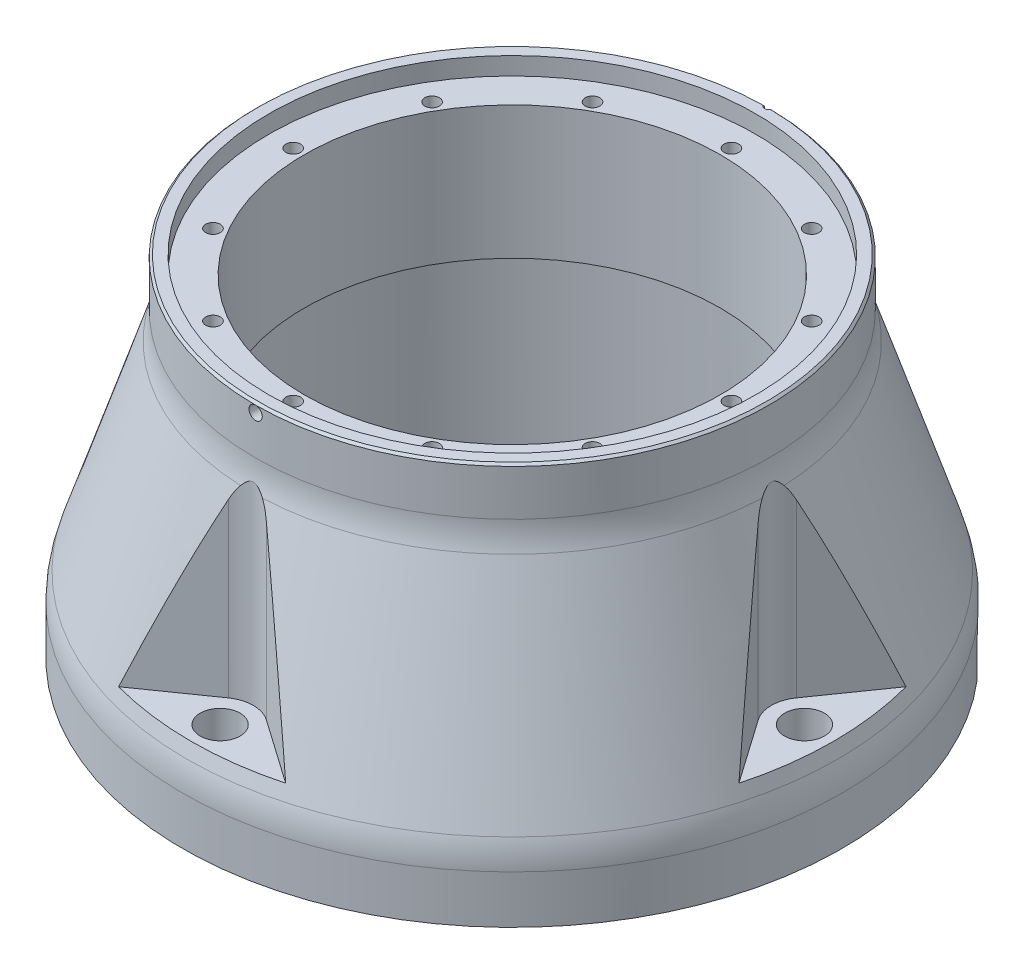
ISO-10303-21;
HEADER;
FILE_DESCRIPTION(('STEP AP214'),'2;1');
FILE_NAME('part.step','',(''),(''),'','','');
FILE_SCHEMA(('AUTOMOTIVE_DESIGN { 1 0 10303 214 1 1 1 1 }'));
ENDSEC;
DATA;
#1=APPLICATION_CONTEXT('core data for automotive mechanical design processes');
#2=APPLICATION_PROTOCOL_DEFINITION('international standard','automotive_design',2000,#1);
#3=PRODUCT_CONTEXT('',#1,'mechanical');
#4=PRODUCT('Part','Part','',(#3));
#5=PRODUCT_RELATED_PRODUCT_CATEGORY('part','',(#4));
#6=PRODUCT_DEFINITION_FORMATION('','',#4);
#7=PRODUCT_DEFINITION_CONTEXT('part definition',#1,'design');
#8=PRODUCT_DEFINITION('design','',#6,#7);
#9=PRODUCT_DEFINITION_SHAPE('','',#8);
#10=(LENGTH_UNIT() NAMED_UNIT(*) SI_UNIT(.MILLI.,.METRE.));
#11=(NAMED_UNIT(*) PLANE_ANGLE_UNIT() SI_UNIT($,.RADIAN.));
#12=(NAMED_UNIT(*) SI_UNIT($,.STERADIAN.) SOLID_ANGLE_UNIT());
#13=UNCERTAINTY_MEASURE_WITH_UNIT(LENGTH_MEASURE(1.E-05),#10,'distance_accuracy_value','');
#14=(GEOMETRIC_REPRESENTATION_CONTEXT(3) GLOBAL_UNCERTAINTY_ASSIGNED_CONTEXT((#13)) GLOBAL_UNIT_ASSIGNED_CONTEXT((#10,
#11,#12)) REPRESENTATION_CONTEXT('',''));
#15=CARTESIAN_POINT('',(0.,0.,0.));
#16=DIRECTION('',(0.,0.,1.));
#17=DIRECTION('',(1.,0.,0.));
#18=AXIS2_PLACEMENT_3D('',#15,#16,#17);
#19=CARTESIAN_POINT('',(0.,100.390423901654,0.));
#20=DIRECTION('',(0.,1.,0.));
#21=DIRECTION('',(0.,0.,1.));
#22=AXIS2_PLACEMENT_3D('',#19,#20,#21);
#23=CYLINDRICAL_SURFACE('',#22,58.);
#24=CARTESIAN_POINT('',(0.,68.1547941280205,0.));
#25=DIRECTION('',(0.,1.,0.));
#26=DIRECTION('',(0.,0.,1.));
#27=AXIS2_PLACEMENT_3D('',#24,#25,#26);
#28=CIRCLE('',#27,58.);
#29=CARTESIAN_POINT('',(0.,68.1547941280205,58.));
#30=VERTEX_POINT('',#29);
#31=EDGE_CURVE('E683',#30,#30,#28,.T.);
#32=ORIENTED_EDGE('',*,*,#31,.T.);
#33=EDGE_LOOP('',(#32));
#34=FACE_BOUND('',#33,.T.);
#35=DIRECTION('',(0.,1.,0.));
#36=VECTOR('',#35,1.);
#37=CARTESIAN_POINT('',(0.999962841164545,77.5,-57.9913793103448));
#38=LINE('',#37,#36);
#39=CARTESIAN_POINT('',(0.999962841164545,78.5000000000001,-57.9913793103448));
#40=VERTEX_POINT('',#39);
#41=CARTESIAN_POINT('',(0.999962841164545,76.,-57.9913793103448));
#42=VERTEX_POINT('',#41);
#43=EDGE_CURVE('E686',#40,#42,#38,.F.);
#44=ORIENTED_EDGE('',*,*,#43,.F.);
#45=CARTESIAN_POINT('',(0.,78.5000000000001,0.));
#46=DIRECTION('',(0.,1.,0.));
#47=DIRECTION('',(0.,0.,1.));
#48=AXIS2_PLACEMENT_3D('',#45,#46,#47);
#49=CIRCLE('',#48,58.);
#50=CARTESIAN_POINT('',(8.38908807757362E-13,78.5000000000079,58.0000000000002));
#51=VERTEX_POINT('',#50);
#52=EDGE_CURVE('E661',#40,#51,#49,.F.);
#53=ORIENTED_EDGE('',*,*,#52,.T.);
#54=CARTESIAN_POINT('',(0.,75.5,58.));
#55=CARTESIAN_POINT('',(0.0842405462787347,75.5000037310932,57.9999997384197));
#56=CARTESIAN_POINT('',(0.168541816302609,75.5071202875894,57.9998145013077));
#57=CARTESIAN_POINT('',(0.334821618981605,75.5354103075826,57.9990933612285));
#58=CARTESIAN_POINT('',(0.416797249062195,75.5566005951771,57.9985570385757));
#59=CARTESIAN_POINT('',(0.575992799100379,75.6124335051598,57.99719446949));
#60=CARTESIAN_POINT('',(0.653215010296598,75.6470695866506,57.9963683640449));
#61=CARTESIAN_POINT('',(0.800727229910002,75.7288016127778,57.9945194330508));
#62=CARTESIAN_POINT('',(0.871018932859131,75.7758945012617,57.9934966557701));
#63=CARTESIAN_POINT('',(1.00272295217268,75.8812245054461,57.9913691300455));
#64=CARTESIAN_POINT('',(1.06413247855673,75.9394651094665,57.9902643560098));
#65=CARTESIAN_POINT('',(1.17630561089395,76.0654315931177,57.9880975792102));
#66=CARTESIAN_POINT('',(1.22706879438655,76.1331578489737,57.9870355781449));
#67=CARTESIAN_POINT('',(1.31651126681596,76.2761817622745,57.9850740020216));
#68=CARTESIAN_POINT('',(1.35518908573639,76.3514803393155,57.9841744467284));
#69=CARTESIAN_POINT('',(1.41935325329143,76.5075048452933,57.9826394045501));
#70=CARTESIAN_POINT('',(1.44483964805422,76.5882307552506,57.9820039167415));
#71=CARTESIAN_POINT('',(1.48189206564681,76.7527992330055,57.9810688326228));
#72=CARTESIAN_POINT('',(1.49346121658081,76.8366410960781,57.9807691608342));
#73=CARTESIAN_POINT('',(1.50236036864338,77.0050774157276,57.9805392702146));
#74=CARTESIAN_POINT('',(1.49969041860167,77.0896718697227,57.9806090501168));
#75=CARTESIAN_POINT('',(1.48018982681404,77.2571908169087,57.9811101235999));
#76=CARTESIAN_POINT('',(1.463362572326,77.3401157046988,57.9815413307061));
#77=CARTESIAN_POINT('',(1.41603027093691,77.5019631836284,57.9827165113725));
#78=CARTESIAN_POINT('',(1.38552519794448,77.580885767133,57.9834604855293));
#79=CARTESIAN_POINT('',(1.31169930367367,77.7324991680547,57.9851774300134));
#80=CARTESIAN_POINT('',(1.26837692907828,77.8051892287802,57.9861504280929));
#81=CARTESIAN_POINT('',(1.17014736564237,77.9422658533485,57.9882157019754));
#82=CARTESIAN_POINT('',(1.11524015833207,78.0066524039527,57.9893079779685));
#83=CARTESIAN_POINT('',(0.995380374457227,78.1253140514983,57.9914890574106));
#84=CARTESIAN_POINT('',(0.930424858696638,78.1795861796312,57.9925778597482));
#85=CARTESIAN_POINT('',(0.792322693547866,78.2764555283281,57.9946289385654));
#86=CARTESIAN_POINT('',(0.719176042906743,78.3190527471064,57.9955912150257));
#87=CARTESIAN_POINT('',(0.566766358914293,78.3913627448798,57.9972807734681));
#88=CARTESIAN_POINT('',(0.487503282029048,78.4210754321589,57.9980080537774));
#89=CARTESIAN_POINT('',(0.325111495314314,78.4667710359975,57.9991456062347));
#90=CARTESIAN_POINT('',(0.241982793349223,78.4827539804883,57.9995558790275));
#91=CARTESIAN_POINT('',(0.0742452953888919,78.5005327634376,58.0000130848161));
#92=CARTESIAN_POINT('',(-0.0103630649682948,78.502332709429,58.0000601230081));
#93=CARTESIAN_POINT('',(-0.178680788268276,78.491705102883,57.9997858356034));
#94=CARTESIAN_POINT('',(-0.262390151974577,78.4792775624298,57.9994645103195));
#95=CARTESIAN_POINT('',(-0.426522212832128,78.440551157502,57.9984897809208));
#96=CARTESIAN_POINT('',(-0.506945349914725,78.4142541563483,57.9978364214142));
#97=CARTESIAN_POINT('',(-0.662235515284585,78.3485372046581,57.9962712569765));
#98=CARTESIAN_POINT('',(-0.73710253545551,78.3091172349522,57.9953594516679));
#99=CARTESIAN_POINT('',(-0.879174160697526,78.2182627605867,57.9933798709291));
#100=CARTESIAN_POINT('',(-0.94637699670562,78.1668254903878,57.9923120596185));
#101=CARTESIAN_POINT('',(-1.07119483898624,78.0534005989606,57.990140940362));
#102=CARTESIAN_POINT('',(-1.12880982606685,77.9914129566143,57.989037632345));
#103=CARTESIAN_POINT('',(-1.23283017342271,77.8586293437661,57.9869196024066));
#104=CARTESIAN_POINT('',(-1.27923288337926,77.7878312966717,57.985904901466));
#105=CARTESIAN_POINT('',(-1.35949333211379,77.6394472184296,57.9840788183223));
#106=CARTESIAN_POINT('',(-1.39335109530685,77.5618612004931,57.9832674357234));
#107=CARTESIAN_POINT('',(-1.44755591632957,77.4021135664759,57.9819396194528));
#108=CARTESIAN_POINT('',(-1.46790469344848,77.3199525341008,57.9814231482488));
#109=CARTESIAN_POINT('',(-1.4945195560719,77.1533788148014,57.9807432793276));
#110=CARTESIAN_POINT('',(-1.50078564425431,77.0689661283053,57.9805798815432));
#111=CARTESIAN_POINT('',(-1.49905704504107,76.9003118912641,57.9806245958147));
#112=CARTESIAN_POINT('',(-1.49106654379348,76.8160702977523,57.9808325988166));
#113=CARTESIAN_POINT('',(-1.4610601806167,76.6501246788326,57.9815964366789));
#114=CARTESIAN_POINT('',(-1.43904429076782,76.5684206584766,57.9821522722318));
#115=CARTESIAN_POINT('',(-1.3816125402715,76.4098675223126,57.9835491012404));
#116=CARTESIAN_POINT('',(-1.34619644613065,76.3330184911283,57.9843900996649));
#117=CARTESIAN_POINT('',(-1.26297145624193,76.1863590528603,57.9862624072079));
#118=CARTESIAN_POINT('',(-1.2151630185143,76.1165483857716,57.9872937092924));
#119=CARTESIAN_POINT('',(-1.1084996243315,75.9859290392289,57.9894306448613));
#120=CARTESIAN_POINT('',(-1.04964260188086,75.9251220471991,57.9905362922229));
#121=CARTESIAN_POINT('',(-0.922538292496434,75.8142358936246,57.9926974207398));
#122=CARTESIAN_POINT('',(-0.854288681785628,75.7641593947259,57.9937528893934));
#123=CARTESIAN_POINT('',(-0.710313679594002,75.6761493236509,57.995694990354));
#124=CARTESIAN_POINT('',(-0.634583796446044,75.6382231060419,57.9965815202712));
#125=CARTESIAN_POINT('',(-0.477887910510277,75.5756672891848,57.9980839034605));
#126=CARTESIAN_POINT('',(-0.396928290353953,75.5510218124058,57.998700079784));
#127=CARTESIAN_POINT('',(-0.262880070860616,75.5222679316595,57.9994273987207));
#128=CARTESIAN_POINT('',(-0.210661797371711,75.5139279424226,57.9996411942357));
#129=CARTESIAN_POINT('',(-0.105636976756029,75.5027928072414,57.9999275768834));
#130=CARTESIAN_POINT('',(-0.0528304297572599,75.4999976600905,58.0000001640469));
#131=CARTESIAN_POINT('',(0.,75.5,58.));
#132=B_SPLINE_CURVE_WITH_KNOTS('',3,(#54,#55,#56,#57,#58,#59,#60,#61,#62,#63,#64,#65,#66,#67,
#68,#69,#70,#71,#72,#73,#74,#75,#76,#77,#78,#79,#80,#81,#82,#83,#84,#85,#86,#87,#88,#89,#90,#91,
#92,#93,#94,#95,#96,#97,#98,#99,#100,#101,#102,#103,#104,#105,#106,#107,#108,#109,#110,#111,
#112,#113,#114,#115,#116,#117,#118,#119,#120,#121,#122,#123,#124,#125,#126,#127,#128,#129,#130,
#131),.UNSPECIFIED.,.T.,.F.,(4,2,2,2,2,2,2,2,2,2,2,2,2,2,2,2,2,2,2,2,2,2,2,2,2,2,2,2,2,2,2,2,2,
2,2,2,2,2,4),(0.,0.252528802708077,0.505360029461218,0.75806841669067,1.01071486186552,
1.2634404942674,1.51617615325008,1.76894254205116,2.02170804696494,2.27441672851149,
2.52712454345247,2.77977191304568,3.03241976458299,3.28509824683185,3.53777713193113,
3.79053006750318,4.0432830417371,4.29603781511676,4.54879207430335,4.80147313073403,
5.05415397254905,5.30680087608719,5.55944814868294,5.81215362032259,6.06485959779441,
6.31762525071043,6.57039041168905,6.82312339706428,7.07585633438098,7.32851507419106,
7.58117431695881,7.8338379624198,8.0864922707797,8.33919387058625,8.59195810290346,
8.8448750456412,9.09748894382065,9.25585933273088,9.41422968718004),.UNSPECIFIED.);
#133=EDGE_CURVE('E703',#51,#51,#132,.T.);
#134=ORIENTED_EDGE('',*,*,#133,.F.);
#135=CARTESIAN_POINT('',(0.,78.5000000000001,0.));
#136=DIRECTION('',(0.,1.,0.));
#137=DIRECTION('',(0.,0.,1.));
#138=AXIS2_PLACEMENT_3D('',#135,#136,#137);
#139=CIRCLE('',#138,58.);
#140=CARTESIAN_POINT('',(-0.999962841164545,78.5000000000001,-57.9913793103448));
#141=VERTEX_POINT('',#140);
#142=EDGE_CURVE('E659',#51,#141,#139,.F.);
#143=ORIENTED_EDGE('',*,*,#142,.T.);
#144=DIRECTION('',(0.,1.,0.));
#145=VECTOR('',#144,1.);
#146=CARTESIAN_POINT('',(-0.999962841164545,77.5,-57.9913793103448));
#147=LINE('',#146,#145);
#148=CARTESIAN_POINT('',(-0.999962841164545,76.,-57.9913793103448));
#149=VERTEX_POINT('',#148);
#150=EDGE_CURVE('E694',#149,#141,#147,.T.);
#151=ORIENTED_EDGE('',*,*,#150,.F.);
#152=CARTESIAN_POINT('',(0.,76.,0.));
#153=DIRECTION('',(0.,1.,0.));
#154=DIRECTION('',(0.,0.,1.));
#155=AXIS2_PLACEMENT_3D('',#152,#153,#154);
#156=CIRCLE('',#155,58.);
#157=EDGE_CURVE('E691',#149,#42,#156,.F.);
#158=ORIENTED_EDGE('',*,*,#157,.T.);
#159=EDGE_LOOP('',(#44,#53,#134,#143,#151,#158));
#160=FACE_BOUND('',#159,.T.);
#161=ADVANCED_FACE('F16',(#34,#160),#23,.T.);
#162=CARTESIAN_POINT('',(0.,65.,0.));
#163=DIRECTION('',(0.,-1.,0.));
#164=DIRECTION('',(0.,0.,-1.));
#165=AXIS2_PLACEMENT_3D('',#162,#163,#164);
#166=CONICAL_SURFACE('',#165,58.,0.312901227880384);
#167=CARTESIAN_POINT('',(0.,17.0016115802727,0.));
#168=DIRECTION('',(0.,1.,0.));
#169=DIRECTION('',(0.,0.,1.));
#170=AXIS2_PLACEMENT_3D('',#167,#168,#169);
#171=CIRCLE('',#170,73.5288903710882);
#172=CARTESIAN_POINT('',(0.,17.0016115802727,73.5288903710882));
#173=VERTEX_POINT('',#172);
#174=EDGE_CURVE('E813',#173,#173,#171,.T.);
#175=ORIENTED_EDGE('',*,*,#174,.T.);
#176=EDGE_LOOP('',(#175));
#177=FACE_BOUND('',#176,.T.);
#178=CARTESIAN_POINT('',(-59.8564997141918,58.784494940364,4.30202327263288));
#179=CARTESIAN_POINT('',(-59.8146719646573,58.9266833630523,4.2422840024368));
#180=CARTESIAN_POINT('',(-59.7730641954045,59.0682877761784,4.18102149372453));
#181=CARTESIAN_POINT('',(-59.6903400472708,59.3501441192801,4.05510422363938));
#182=CARTESIAN_POINT('',(-59.6492237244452,59.4903958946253,3.99044907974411));
#183=CARTESIAN_POINT('',(-59.5271039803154,59.9074288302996,3.79154938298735));
#184=CARTESIAN_POINT('',(-59.4469181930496,60.1818869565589,3.65179073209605));
#185=CARTESIAN_POINT('',(-59.328890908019,60.5867453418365,3.42831813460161));
#186=CARTESIAN_POINT('',(-59.2899053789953,60.720623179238,3.35148093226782));
#187=CARTESIAN_POINT('',(-59.2128609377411,60.9854804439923,3.19257613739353));
#188=CARTESIAN_POINT('',(-59.1748018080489,61.1164605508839,3.11050978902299));
#189=CARTESIAN_POINT('',(-59.0996244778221,61.375453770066,2.93999653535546));
#190=CARTESIAN_POINT('',(-59.0625115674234,61.5034499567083,2.85152133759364));
#191=CARTESIAN_POINT('',(-58.9897025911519,61.7548094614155,2.6674704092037));
#192=CARTESIAN_POINT('',(-58.9540077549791,61.8781687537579,2.57188871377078));
#193=CARTESIAN_POINT('',(-58.9191980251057,61.9985884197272,2.47229516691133));
#194=B_SPLINE_CURVE_WITH_KNOTS('',3,(#178,#179,#180,#181,#182,#183,#184,#185,#186,#187,#188,
#189,#190,#191,#192,#193),.UNSPECIFIED.,.F.,.F.,(4,2,2,2,2,2,2,4),(0.,0.47936953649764,
0.958793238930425,1.9129359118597,2.39046998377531,2.86789085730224,3.34756554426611,
3.827647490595),.UNSPECIFIED.);
#195=CARTESIAN_POINT('',(-59.8563596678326,58.7849710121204,4.30182327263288));
#196=VERTEX_POINT('',#195);
#197=CARTESIAN_POINT('',(-58.9192558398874,61.9983884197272,2.47246074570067));
#198=VERTEX_POINT('',#197);
#199=EDGE_CURVE('E2012',#196,#198,#194,.T.);
#200=ORIENTED_EDGE('',*,*,#199,.F.);
#201=CARTESIAN_POINT('',(-70.060802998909,19.9998,18.8752786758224));
#202=CARTESIAN_POINT('',(-69.6642759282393,21.6384852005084,18.3089793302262));
#203=CARTESIAN_POINT('',(-69.2651982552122,23.2753032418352,17.7390373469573));
#204=CARTESIAN_POINT('',(-68.4612934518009,26.5446593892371,16.5909423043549));
#205=CARTESIAN_POINT('',(-68.0564662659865,28.1771974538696,16.0127891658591));
#206=CARTESIAN_POINT('',(-67.2405571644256,31.436875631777,14.8475502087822));
#207=CARTESIAN_POINT('',(-66.8294773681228,33.0640173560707,14.2604674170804));
#208=CARTESIAN_POINT('',(-66.0001457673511,36.312743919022,13.07605914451));
#209=CARTESIAN_POINT('',(-65.5818939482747,37.9343287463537,12.4787336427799));
#210=CARTESIAN_POINT('',(-64.7372473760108,41.1712717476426,11.2724533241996));
#211=CARTESIAN_POINT('',(-64.310851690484,42.7866291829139,10.6634971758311));
#212=CARTESIAN_POINT('',(-63.4488624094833,46.0098474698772,9.43244890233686));
#213=CARTESIAN_POINT('',(-63.0132689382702,47.6177084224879,8.810356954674));
#214=CARTESIAN_POINT('',(-62.1313964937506,50.825158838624,7.55091258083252));
#215=CARTESIAN_POINT('',(-61.6851141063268,52.4247454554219,6.91355527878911));
#216=CARTESIAN_POINT('',(-61.0065336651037,54.8162705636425,5.94444197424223));
#217=CARTESIAN_POINT('',(-60.7788081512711,55.6121565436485,5.6192162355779));
#218=CARTESIAN_POINT('',(-60.3200539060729,57.2010379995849,4.96404727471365));
#219=CARTESIAN_POINT('',(-60.0890251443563,57.9940334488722,4.63410400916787));
#220=CARTESIAN_POINT('',(-59.8562196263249,58.785447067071,4.30162327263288));
#221=B_SPLINE_CURVE_WITH_KNOTS('',3,(#201,#202,#203,#204,#205,#206,#207,#208,#209,#210,#211,
#212,#213,#214,#215,#216,#217,#218,#219,#220),.UNSPECIFIED.,.F.,.F.,(4,2,2,2,2,2,2,2,2,4),(0.,
5.33563680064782,10.6713250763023,16.0052433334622,21.3391724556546,26.6737159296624,
32.0081873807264,37.3443860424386,40.0126206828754,42.6808798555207),.UNSPECIFIED.);
#222=CARTESIAN_POINT('',(-70.0607546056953,20.,18.8752095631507));
#223=VERTEX_POINT('',#222);
#224=EDGE_CURVE('E818',#223,#196,#221,.T.);
#225=ORIENTED_EDGE('',*,*,#224,.F.);
#226=CARTESIAN_POINT('',(0.,20.,0.));
#227=DIRECTION('',(0.,-1.,0.));
#228=DIRECTION('',(0.,0.,-1.));
#229=AXIS2_PLACEMENT_3D('',#226,#227,#228);
#230=CIRCLE('',#229,72.5588235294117);
#231=CARTESIAN_POINT('',(-70.0607546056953,20.,-18.8752095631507));
#232=VERTEX_POINT('',#231);
#233=EDGE_CURVE('E451',#232,#223,#230,.F.);
#234=ORIENTED_EDGE('',*,*,#233,.F.);
#235=CARTESIAN_POINT('',(-59.8562196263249,58.785447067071,-4.30162327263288));
#236=CARTESIAN_POINT('',(-60.0890251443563,57.9940334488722,-4.63410400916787));
#237=CARTESIAN_POINT('',(-60.3200539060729,57.2010379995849,-4.96404727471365));
#238=CARTESIAN_POINT('',(-60.7788081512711,55.6121565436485,-5.6192162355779));
#239=CARTESIAN_POINT('',(-61.0065336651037,54.8162705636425,-5.94444197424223));
#240=CARTESIAN_POINT('',(-61.6851141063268,52.424745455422,-6.91355527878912));
#241=CARTESIAN_POINT('',(-62.1313964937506,50.8251588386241,-7.55091258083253));
#242=CARTESIAN_POINT('',(-63.0132689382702,47.617708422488,-8.81035695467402));
#243=CARTESIAN_POINT('',(-63.4488624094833,46.0098474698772,-9.43244890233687));
#244=CARTESIAN_POINT('',(-64.310851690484,42.7866291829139,-10.6634971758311));
#245=CARTESIAN_POINT('',(-64.7372473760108,41.1712717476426,-11.2724533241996));
#246=CARTESIAN_POINT('',(-65.5818939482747,37.9343287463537,-12.4787336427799));
#247=CARTESIAN_POINT('',(-66.0001457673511,36.312743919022,-13.0760591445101));
#248=CARTESIAN_POINT('',(-66.8294773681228,33.0640173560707,-14.2604674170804));
#249=CARTESIAN_POINT('',(-67.2405571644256,31.436875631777,-14.8475502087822));
#250=CARTESIAN_POINT('',(-68.0564662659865,28.1771974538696,-16.0127891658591));
#251=CARTESIAN_POINT('',(-68.4612934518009,26.5446593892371,-16.5909423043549));
#252=CARTESIAN_POINT('',(-69.2651982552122,23.2753032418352,-17.7390373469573));
#253=CARTESIAN_POINT('',(-69.6642759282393,21.6384852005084,-18.3089793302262));
#254=CARTESIAN_POINT('',(-70.060802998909,19.9998,-18.8752786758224));
#255=B_SPLINE_CURVE_WITH_KNOTS('',3,(#235,#236,#237,#238,#239,#240,#241,#242,#243,#244,#245,
#246,#247,#248,#249,#250,#251,#252,#253,#254),.UNSPECIFIED.,.F.,.F.,(4,2,2,2,2,2,2,2,2,4),(0.,
2.6682591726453,5.33649381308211,10.6726924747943,16.0071639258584,21.3417073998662,
26.6756365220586,32.0095547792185,37.3452430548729,42.6808798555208),.UNSPECIFIED.);
#256=CARTESIAN_POINT('',(-59.8563596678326,58.7849710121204,-4.30182327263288));
#257=VERTEX_POINT('',#256);
#258=EDGE_CURVE('E815',#257,#232,#255,.T.);
#259=ORIENTED_EDGE('',*,*,#258,.F.);
#260=CARTESIAN_POINT('',(-58.9191980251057,61.9985884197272,-2.47229516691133));
#261=CARTESIAN_POINT('',(-58.9540077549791,61.8781687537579,-2.57188871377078));
#262=CARTESIAN_POINT('',(-58.9897025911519,61.7548094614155,-2.6674704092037));
#263=CARTESIAN_POINT('',(-59.0625115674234,61.5034499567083,-2.85152133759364));
#264=CARTESIAN_POINT('',(-59.0996244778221,61.375453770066,-2.93999653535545));
#265=CARTESIAN_POINT('',(-59.1748018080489,61.1164605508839,-3.11050978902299));
#266=CARTESIAN_POINT('',(-59.2128609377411,60.9854804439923,-3.19257613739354));
#267=CARTESIAN_POINT('',(-59.2899053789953,60.720623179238,-3.35148093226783));
#268=CARTESIAN_POINT('',(-59.328890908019,60.5867453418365,-3.42831813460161));
#269=CARTESIAN_POINT('',(-59.4469181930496,60.1818869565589,-3.65179073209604));
#270=CARTESIAN_POINT('',(-59.5271039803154,59.9074288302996,-3.79154938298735));
#271=CARTESIAN_POINT('',(-59.6492237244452,59.4903958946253,-3.99044907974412));
#272=CARTESIAN_POINT('',(-59.6903400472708,59.3501441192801,-4.05510422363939));
#273=CARTESIAN_POINT('',(-59.7730641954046,59.0682877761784,-4.18102149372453));
#274=CARTESIAN_POINT('',(-59.8146719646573,58.9266833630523,-4.2422840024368));
#275=CARTESIAN_POINT('',(-59.8564997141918,58.784494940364,-4.30202327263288));
#276=B_SPLINE_CURVE_WITH_KNOTS('',3,(#260,#261,#262,#263,#264,#265,#266,#267,#268,#269,#270,
#271,#272,#273,#274,#275),.UNSPECIFIED.,.F.,.F.,(4,2,2,2,2,2,2,4),(0.,0.480081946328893,
0.959756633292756,1.43717750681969,1.9147115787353,2.86885425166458,3.34827795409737,
3.82764749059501),.UNSPECIFIED.);
#277=CARTESIAN_POINT('',(-58.9192558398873,61.9983884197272,-2.47246074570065));
#278=VERTEX_POINT('',#277);
#279=EDGE_CURVE('E2048',#278,#257,#276,.T.);
#280=ORIENTED_EDGE('',*,*,#279,.F.);
#281=CARTESIAN_POINT('',(0.,61.9983884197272,0.));
#282=DIRECTION('',(0.,-1.,0.));
#283=DIRECTION('',(0.,0.,-1.));
#284=AXIS2_PLACEMENT_3D('',#281,#282,#283);
#285=CIRCLE('',#284,58.9711096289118);
#286=CARTESIAN_POINT('',(-2.47246074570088,61.9983884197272,-58.9192558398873));
#287=VERTEX_POINT('',#286);
#288=EDGE_CURVE('E990',#278,#287,#285,.T.);
#289=ORIENTED_EDGE('',*,*,#288,.T.);
#290=CARTESIAN_POINT('',(-4.30202327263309,58.784494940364,-59.8564997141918));
#291=CARTESIAN_POINT('',(-4.24228400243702,58.9266833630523,-59.8146719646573));
#292=CARTESIAN_POINT('',(-4.18102149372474,59.0682877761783,-59.7730641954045));
#293=CARTESIAN_POINT('',(-4.0551042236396,59.3501441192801,-59.6903400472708));
#294=CARTESIAN_POINT('',(-3.99044907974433,59.4903958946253,-59.6492237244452));
#295=CARTESIAN_POINT('',(-3.79154938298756,59.9074288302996,-59.5271039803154));
#296=CARTESIAN_POINT('',(-3.65179073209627,60.1818869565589,-59.4469181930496));
#297=CARTESIAN_POINT('',(-3.42831813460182,60.5867453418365,-59.328890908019));
#298=CARTESIAN_POINT('',(-3.35148093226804,60.720623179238,-59.2899053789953));
#299=CARTESIAN_POINT('',(-3.19257613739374,60.9854804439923,-59.2128609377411));
#300=CARTESIAN_POINT('',(-3.11050978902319,61.1164605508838,-59.1748018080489));
#301=CARTESIAN_POINT('',(-2.93999653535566,61.375453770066,-59.0996244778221));
#302=CARTESIAN_POINT('',(-2.85152133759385,61.5034499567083,-59.0625115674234));
#303=CARTESIAN_POINT('',(-2.66747040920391,61.7548094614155,-58.9897025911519));
#304=CARTESIAN_POINT('',(-2.57188871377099,61.8781687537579,-58.9540077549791));
#305=CARTESIAN_POINT('',(-2.47229516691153,61.9985884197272,-58.9191980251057));
#306=B_SPLINE_CURVE_WITH_KNOTS('',3,(#290,#291,#292,#293,#294,#295,#296,#297,#298,#299,#300,
#301,#302,#303,#304,#305),.UNSPECIFIED.,.F.,.F.,(4,2,2,2,2,2,2,4),(0.,0.479369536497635,
0.958793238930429,1.91293591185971,2.39046998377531,2.86789085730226,3.34756554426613,
3.82764749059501),.UNSPECIFIED.);
#307=CARTESIAN_POINT('',(-4.30182327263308,58.7849710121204,-59.8563596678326));
#308=VERTEX_POINT('',#307);
#309=EDGE_CURVE('E565',#308,#287,#306,.T.);
#310=ORIENTED_EDGE('',*,*,#309,.F.);
#311=CARTESIAN_POINT('',(-18.8752786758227,19.9998,-70.060802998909));
#312=CARTESIAN_POINT('',(-18.3089793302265,21.6384852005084,-69.6642759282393));
#313=CARTESIAN_POINT('',(-17.7390373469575,23.2753032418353,-69.2651982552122));
#314=CARTESIAN_POINT('',(-16.5909423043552,26.5446593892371,-68.4612934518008));
#315=CARTESIAN_POINT('',(-16.0127891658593,28.1771974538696,-68.0564662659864));
#316=CARTESIAN_POINT('',(-14.8475502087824,31.436875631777,-67.2405571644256));
#317=CARTESIAN_POINT('',(-14.2604674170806,33.0640173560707,-66.8294773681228));
#318=CARTESIAN_POINT('',(-13.0760591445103,36.312743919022,-66.0001457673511));
#319=CARTESIAN_POINT('',(-12.4787336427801,37.9343287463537,-65.5818939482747));
#320=CARTESIAN_POINT('',(-11.2724533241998,41.1712717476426,-64.7372473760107));
#321=CARTESIAN_POINT('',(-10.6634971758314,42.7866291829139,-64.310851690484));
#322=CARTESIAN_POINT('',(-9.43244890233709,46.0098474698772,-63.4488624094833));
#323=CARTESIAN_POINT('',(-8.81035695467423,47.6177084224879,-63.0132689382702));
#324=CARTESIAN_POINT('',(-7.55091258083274,50.825158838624,-62.1313964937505));
#325=CARTESIAN_POINT('',(-6.91355527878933,52.4247454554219,-61.6851141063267));
#326=CARTESIAN_POINT('',(-5.94444197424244,54.8162705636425,-61.0065336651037));
#327=CARTESIAN_POINT('',(-5.61921623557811,55.6121565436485,-60.7788081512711));
#328=CARTESIAN_POINT('',(-4.96404727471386,57.2010379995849,-60.3200539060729));
#329=CARTESIAN_POINT('',(-4.63410400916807,57.9940334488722,-60.0890251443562));
#330=CARTESIAN_POINT('',(-4.30162327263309,58.785447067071,-59.8562196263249));
#331=B_SPLINE_CURVE_WITH_KNOTS('',3,(#311,#312,#313,#314,#315,#316,#317,#318,#319,#320,#321,
#322,#323,#324,#325,#326,#327,#328,#329,#330),.UNSPECIFIED.,.F.,.F.,(4,2,2,2,2,2,2,2,2,4),(0.,
5.33563680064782,10.6713250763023,16.0052433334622,21.3391724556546,26.6737159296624,
32.0081873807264,37.3443860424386,40.0126206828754,42.6808798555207),.UNSPECIFIED.);
#332=CARTESIAN_POINT('',(-18.875209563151,20.,-70.0607546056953));
#333=VERTEX_POINT('',#332);
#334=EDGE_CURVE('E541',#333,#308,#331,.T.);
#335=ORIENTED_EDGE('',*,*,#334,.F.);
#336=CARTESIAN_POINT('',(0.,20.,0.));
#337=DIRECTION('',(0.,-1.,0.));
#338=DIRECTION('',(0.,0.,-1.));
#339=AXIS2_PLACEMENT_3D('',#336,#337,#338);
#340=CIRCLE('',#339,72.5588235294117);
#341=CARTESIAN_POINT('',(18.8752095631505,20.,-70.0607546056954));
#342=VERTEX_POINT('',#341);
#343=EDGE_CURVE('E573',#342,#333,#340,.F.);
#344=ORIENTED_EDGE('',*,*,#343,.F.);
#345=CARTESIAN_POINT('',(4.30162327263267,58.7854470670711,-59.856219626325));
#346=CARTESIAN_POINT('',(4.63410400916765,57.9940334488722,-60.0890251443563));
#347=CARTESIAN_POINT('',(4.96404727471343,57.2010379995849,-60.3200539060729));
#348=CARTESIAN_POINT('',(5.61921623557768,55.6121565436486,-60.7788081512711));
#349=CARTESIAN_POINT('',(5.94444197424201,54.8162705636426,-61.0065336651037));
#350=CARTESIAN_POINT('',(6.9135552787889,52.424745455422,-61.6851141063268));
#351=CARTESIAN_POINT('',(7.55091258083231,50.8251588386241,-62.1313964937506));
#352=CARTESIAN_POINT('',(8.81035695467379,47.617708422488,-63.0132689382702));
#353=CARTESIAN_POINT('',(9.43244890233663,46.0098474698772,-63.4488624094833));
#354=CARTESIAN_POINT('',(10.6634971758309,42.7866291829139,-64.3108516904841));
#355=CARTESIAN_POINT('',(11.2724533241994,41.1712717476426,-64.7372473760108));
#356=CARTESIAN_POINT('',(12.4787336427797,37.9343287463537,-65.5818939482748));
#357=CARTESIAN_POINT('',(13.0760591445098,36.312743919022,-66.0001457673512));
#358=CARTESIAN_POINT('',(14.2604674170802,33.0640173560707,-66.8294773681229));
#359=CARTESIAN_POINT('',(14.847550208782,31.436875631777,-67.2405571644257));
#360=CARTESIAN_POINT('',(16.0127891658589,28.1771974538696,-68.0564662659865));
#361=CARTESIAN_POINT('',(16.5909423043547,26.5446593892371,-68.4612934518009));
#362=CARTESIAN_POINT('',(17.739037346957,23.2753032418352,-69.2651982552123));
#363=CARTESIAN_POINT('',(18.308979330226,21.6384852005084,-69.6642759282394));
#364=CARTESIAN_POINT('',(18.8752786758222,19.9998,-70.0608029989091));
#365=B_SPLINE_CURVE_WITH_KNOTS('',3,(#345,#346,#347,#348,#349,#350,#351,#352,#353,#354,#355,
#356,#357,#358,#359,#360,#361,#362,#363,#364),.UNSPECIFIED.,.F.,.F.,(4,2,2,2,2,2,2,2,2,4),(0.,
2.66825917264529,5.33649381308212,10.6726924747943,16.0071639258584,21.3417073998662,
26.6756365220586,32.0095547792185,37.345243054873,42.6808798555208),.UNSPECIFIED.);
#366=CARTESIAN_POINT('',(4.30182327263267,58.7849710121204,-59.8563596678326));
#367=VERTEX_POINT('',#366);
#368=EDGE_CURVE('E500',#367,#342,#365,.T.);
#369=ORIENTED_EDGE('',*,*,#368,.F.);
#370=CARTESIAN_POINT('',(2.47229516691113,61.9985884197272,-58.9191980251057));
#371=CARTESIAN_POINT('',(2.57188871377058,61.8781687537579,-58.9540077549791));
#372=CARTESIAN_POINT('',(2.6674704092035,61.7548094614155,-58.9897025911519));
#373=CARTESIAN_POINT('',(2.85152133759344,61.5034499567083,-59.0625115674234));
#374=CARTESIAN_POINT('',(2.93999653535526,61.375453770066,-59.0996244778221));
#375=CARTESIAN_POINT('',(3.11050978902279,61.1164605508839,-59.1748018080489));
#376=CARTESIAN_POINT('',(3.19257613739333,60.9854804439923,-59.2128609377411));
#377=CARTESIAN_POINT('',(3.35148093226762,60.720623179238,-59.2899053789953));
#378=CARTESIAN_POINT('',(3.42831813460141,60.5867453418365,-59.328890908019));
#379=CARTESIAN_POINT('',(3.65179073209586,60.1818869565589,-59.4469181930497));
#380=CARTESIAN_POINT('',(3.79154938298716,59.9074288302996,-59.5271039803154));
#381=CARTESIAN_POINT('',(3.99044907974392,59.4903958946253,-59.6492237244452));
#382=CARTESIAN_POINT('',(4.05510422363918,59.3501441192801,-59.6903400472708));
#383=CARTESIAN_POINT('',(4.18102149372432,59.0682877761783,-59.7730641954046));
#384=CARTESIAN_POINT('',(4.24228400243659,58.9266833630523,-59.8146719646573));
#385=CARTESIAN_POINT('',(4.30202327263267,58.7844949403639,-59.8564997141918));
#386=B_SPLINE_CURVE_WITH_KNOTS('',3,(#370,#371,#372,#373,#374,#375,#376,#377,#378,#379,#380,
#381,#382,#383,#384,#385),.UNSPECIFIED.,.F.,.F.,(4,2,2,2,2,2,2,4),(0.,0.48008194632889,
0.95975663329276,1.43717750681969,1.9147115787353,2.86885425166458,3.34827795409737,
3.82764749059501),.UNSPECIFIED.);
#387=CARTESIAN_POINT('',(2.47246074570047,61.9983884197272,-58.9192558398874));
#388=VERTEX_POINT('',#387);
#389=EDGE_CURVE('E572',#388,#367,#386,.T.);
#390=ORIENTED_EDGE('',*,*,#389,.F.);
#391=CARTESIAN_POINT('',(58.9192558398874,61.9983884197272,-2.47246074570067));
#392=VERTEX_POINT('',#391);
#393=EDGE_CURVE('E984',#388,#392,#285,.T.);
#394=ORIENTED_EDGE('',*,*,#393,.T.);
#395=CARTESIAN_POINT('',(59.8564997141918,58.784494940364,-4.30202327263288));
#396=CARTESIAN_POINT('',(59.8146719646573,58.9266833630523,-4.2422840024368));
#397=CARTESIAN_POINT('',(59.7730641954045,59.0682877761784,-4.18102149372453));
#398=CARTESIAN_POINT('',(59.6903400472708,59.3501441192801,-4.05510422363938));
#399=CARTESIAN_POINT('',(59.6492237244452,59.4903958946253,-3.99044907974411));
#400=CARTESIAN_POINT('',(59.5271039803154,59.9074288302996,-3.79154938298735));
#401=CARTESIAN_POINT('',(59.4469181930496,60.1818869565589,-3.65179073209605));
#402=CARTESIAN_POINT('',(59.328890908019,60.5867453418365,-3.42831813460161));
#403=CARTESIAN_POINT('',(59.2899053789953,60.720623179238,-3.35148093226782));
#404=CARTESIAN_POINT('',(59.2128609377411,60.9854804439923,-3.19257613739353));
#405=CARTESIAN_POINT('',(59.1748018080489,61.1164605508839,-3.11050978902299));
#406=CARTESIAN_POINT('',(59.0996244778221,61.375453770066,-2.93999653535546));
#407=CARTESIAN_POINT('',(59.0625115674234,61.5034499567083,-2.85152133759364));
#408=CARTESIAN_POINT('',(58.9897025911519,61.7548094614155,-2.6674704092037));
#409=CARTESIAN_POINT('',(58.9540077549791,61.8781687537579,-2.57188871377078));
#410=CARTESIAN_POINT('',(58.9191980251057,61.9985884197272,-2.47229516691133));
#411=B_SPLINE_CURVE_WITH_KNOTS('',3,(#395,#396,#397,#398,#399,#400,#401,#402,#403,#404,#405,
#406,#407,#408,#409,#410),.UNSPECIFIED.,.F.,.F.,(4,2,2,2,2,2,2,4),(0.,0.47936953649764,
0.958793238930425,1.9129359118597,2.39046998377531,2.86789085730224,3.34756554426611,
3.827647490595),.UNSPECIFIED.);
#412=CARTESIAN_POINT('',(59.8563596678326,58.7849710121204,-4.30182327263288));
#413=VERTEX_POINT('',#412);
#414=EDGE_CURVE('E611',#413,#392,#411,.T.);
#415=ORIENTED_EDGE('',*,*,#414,.F.);
#416=CARTESIAN_POINT('',(70.060802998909,19.9998,-18.8752786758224));
#417=CARTESIAN_POINT('',(69.6642759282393,21.6384852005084,-18.3089793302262));
#418=CARTESIAN_POINT('',(69.2651982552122,23.2753032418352,-17.7390373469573));
#419=CARTESIAN_POINT('',(68.4612934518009,26.5446593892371,-16.5909423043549));
#420=CARTESIAN_POINT('',(68.0564662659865,28.1771974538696,-16.0127891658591));
#421=CARTESIAN_POINT('',(67.2405571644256,31.436875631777,-14.8475502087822));
#422=CARTESIAN_POINT('',(66.8294773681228,33.0640173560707,-14.2604674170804));
#423=CARTESIAN_POINT('',(66.0001457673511,36.312743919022,-13.07605914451));
#424=CARTESIAN_POINT('',(65.5818939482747,37.9343287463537,-12.4787336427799));
#425=CARTESIAN_POINT('',(64.7372473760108,41.1712717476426,-11.2724533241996));
#426=CARTESIAN_POINT('',(64.310851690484,42.7866291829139,-10.6634971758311));
#427=CARTESIAN_POINT('',(63.4488624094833,46.0098474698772,-9.43244890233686));
#428=CARTESIAN_POINT('',(63.0132689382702,47.6177084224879,-8.810356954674));
#429=CARTESIAN_POINT('',(62.1313964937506,50.825158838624,-7.55091258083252));
#430=CARTESIAN_POINT('',(61.6851141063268,52.4247454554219,-6.91355527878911));
#431=CARTESIAN_POINT('',(61.0065336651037,54.8162705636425,-5.94444197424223));
#432=CARTESIAN_POINT('',(60.7788081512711,55.6121565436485,-5.6192162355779));
#433=CARTESIAN_POINT('',(60.3200539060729,57.2010379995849,-4.96404727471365));
#434=CARTESIAN_POINT('',(60.0890251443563,57.9940334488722,-4.63410400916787));
#435=CARTESIAN_POINT('',(59.8562196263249,58.785447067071,-4.30162327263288));
#436=B_SPLINE_CURVE_WITH_KNOTS('',3,(#416,#417,#418,#419,#420,#421,#422,#423,#424,#425,#426,
#427,#428,#429,#430,#431,#432,#433,#434,#435),.UNSPECIFIED.,.F.,.F.,(4,2,2,2,2,2,2,2,2,4),(0.,
5.33563680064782,10.6713250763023,16.0052433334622,21.3391724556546,26.6737159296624,
32.0081873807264,37.3443860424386,40.0126206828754,42.6808798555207),.UNSPECIFIED.);
#437=CARTESIAN_POINT('',(70.0607546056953,20.,-18.8752095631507));
#438=VERTEX_POINT('',#437);
#439=EDGE_CURVE('E2025',#438,#413,#436,.T.);
#440=ORIENTED_EDGE('',*,*,#439,.F.);
#441=CARTESIAN_POINT('',(0.,20.,0.));
#442=DIRECTION('',(0.,-1.,0.));
#443=DIRECTION('',(0.,0.,-1.));
#444=AXIS2_PLACEMENT_3D('',#441,#442,#443);
#445=CIRCLE('',#444,72.5588235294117);
#446=CARTESIAN_POINT('',(70.0607546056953,20.,18.8752095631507));
#447=VERTEX_POINT('',#446);
#448=EDGE_CURVE('E603',#447,#438,#445,.F.);
#449=ORIENTED_EDGE('',*,*,#448,.F.);
#450=CARTESIAN_POINT('',(59.8562196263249,58.785447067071,4.30162327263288));
#451=CARTESIAN_POINT('',(60.0890251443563,57.9940334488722,4.63410400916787));
#452=CARTESIAN_POINT('',(60.3200539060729,57.2010379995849,4.96404727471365));
#453=CARTESIAN_POINT('',(60.7788081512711,55.6121565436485,5.6192162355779));
#454=CARTESIAN_POINT('',(61.0065336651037,54.8162705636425,5.94444197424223));
#455=CARTESIAN_POINT('',(61.6851141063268,52.424745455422,6.91355527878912));
#456=CARTESIAN_POINT('',(62.1313964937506,50.8251588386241,7.55091258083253));
#457=CARTESIAN_POINT('',(63.0132689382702,47.617708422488,8.81035695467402));
#458=CARTESIAN_POINT('',(63.4488624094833,46.0098474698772,9.43244890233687));
#459=CARTESIAN_POINT('',(64.310851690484,42.7866291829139,10.6634971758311));
#460=CARTESIAN_POINT('',(64.7372473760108,41.1712717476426,11.2724533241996));
#461=CARTESIAN_POINT('',(65.5818939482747,37.9343287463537,12.4787336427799));
#462=CARTESIAN_POINT('',(66.0001457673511,36.312743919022,13.0760591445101));
#463=CARTESIAN_POINT('',(66.8294773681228,33.0640173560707,14.2604674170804));
#464=CARTESIAN_POINT('',(67.2405571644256,31.436875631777,14.8475502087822));
#465=CARTESIAN_POINT('',(68.0564662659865,28.1771974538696,16.0127891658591));
#466=CARTESIAN_POINT('',(68.4612934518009,26.5446593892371,16.5909423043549));
#467=CARTESIAN_POINT('',(69.2651982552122,23.2753032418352,17.7390373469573));
#468=CARTESIAN_POINT('',(69.6642759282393,21.6384852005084,18.3089793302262));
#469=CARTESIAN_POINT('',(70.060802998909,19.9998,18.8752786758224));
#470=B_SPLINE_CURVE_WITH_KNOTS('',3,(#450,#451,#452,#453,#454,#455,#456,#457,#458,#459,#460,
#461,#462,#463,#464,#465,#466,#467,#468,#469),.UNSPECIFIED.,.F.,.F.,(4,2,2,2,2,2,2,2,2,4),(0.,
2.6682591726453,5.33649381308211,10.6726924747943,16.0071639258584,21.3417073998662,
26.6756365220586,32.0095547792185,37.3452430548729,42.6808798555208),.UNSPECIFIED.);
#471=CARTESIAN_POINT('',(59.8563596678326,58.7849710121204,4.30182327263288));
#472=VERTEX_POINT('',#471);
#473=EDGE_CURVE('E542',#472,#447,#470,.T.);
#474=ORIENTED_EDGE('',*,*,#473,.F.);
#475=CARTESIAN_POINT('',(58.9191980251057,61.9985884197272,2.47229516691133));
#476=CARTESIAN_POINT('',(58.9540077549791,61.8781687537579,2.57188871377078));
#477=CARTESIAN_POINT('',(58.9897025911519,61.7548094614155,2.6674704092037));
#478=CARTESIAN_POINT('',(59.0625115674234,61.5034499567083,2.85152133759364));
#479=CARTESIAN_POINT('',(59.0996244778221,61.375453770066,2.93999653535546));
#480=CARTESIAN_POINT('',(59.1748018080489,61.1164605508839,3.11050978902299));
#481=CARTESIAN_POINT('',(59.2128609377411,60.9854804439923,3.19257613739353));
#482=CARTESIAN_POINT('',(59.2899053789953,60.720623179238,3.35148093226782));
#483=CARTESIAN_POINT('',(59.328890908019,60.5867453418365,3.42831813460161));
#484=CARTESIAN_POINT('',(59.4469181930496,60.1818869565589,3.65179073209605));
#485=CARTESIAN_POINT('',(59.5271039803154,59.9074288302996,3.79154938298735));
#486=CARTESIAN_POINT('',(59.6492237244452,59.4903958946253,3.99044907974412));
#487=CARTESIAN_POINT('',(59.6903400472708,59.3501441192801,4.05510422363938));
#488=CARTESIAN_POINT('',(59.7730641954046,59.0682877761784,4.18102149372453));
#489=CARTESIAN_POINT('',(59.8146719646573,58.9266833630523,4.24228400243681));
#490=CARTESIAN_POINT('',(59.8564997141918,58.784494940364,4.30202327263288));
#491=B_SPLINE_CURVE_WITH_KNOTS('',3,(#475,#476,#477,#478,#479,#480,#481,#482,#483,#484,#485,
#486,#487,#488,#489,#490),.UNSPECIFIED.,.F.,.F.,(4,2,2,2,2,2,2,4),(0.,0.480081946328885,
0.959756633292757,1.4371775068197,1.9147115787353,2.86885425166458,3.34827795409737,
3.82764749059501),.UNSPECIFIED.);
#492=CARTESIAN_POINT('',(58.9192558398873,61.9983884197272,2.47246074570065));
#493=VERTEX_POINT('',#492);
#494=EDGE_CURVE('E605',#493,#472,#491,.T.);
#495=ORIENTED_EDGE('',*,*,#494,.F.);
#496=CARTESIAN_POINT('',(2.47246074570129,61.9983884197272,58.9192558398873));
#497=VERTEX_POINT('',#496);
#498=EDGE_CURVE('E985',#493,#497,#285,.T.);
#499=ORIENTED_EDGE('',*,*,#498,.T.);
#500=CARTESIAN_POINT('',(4.3020232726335,58.784494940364,59.8564997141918));
#501=CARTESIAN_POINT('',(4.24228400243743,58.9266833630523,59.8146719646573));
#502=CARTESIAN_POINT('',(4.18102149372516,59.0682877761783,59.7730641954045));
#503=CARTESIAN_POINT('',(4.05510422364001,59.3501441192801,59.6903400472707));
#504=CARTESIAN_POINT('',(3.99044907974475,59.4903958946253,59.6492237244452));
#505=CARTESIAN_POINT('',(3.79154938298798,59.9074288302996,59.5271039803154));
#506=CARTESIAN_POINT('',(3.65179073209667,60.1818869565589,59.4469181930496));
#507=CARTESIAN_POINT('',(3.42831813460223,60.5867453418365,59.328890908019));
#508=CARTESIAN_POINT('',(3.35148093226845,60.7206231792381,59.2899053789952));
#509=CARTESIAN_POINT('',(3.19257613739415,60.9854804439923,59.2128609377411));
#510=CARTESIAN_POINT('',(3.1105097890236,61.1164605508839,59.1748018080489));
#511=CARTESIAN_POINT('',(2.93999653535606,61.375453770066,59.0996244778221));
#512=CARTESIAN_POINT('',(2.85152133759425,61.5034499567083,59.0625115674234));
#513=CARTESIAN_POINT('',(2.66747040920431,61.7548094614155,58.9897025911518));
#514=CARTESIAN_POINT('',(2.5718887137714,61.878168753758,58.954007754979));
#515=CARTESIAN_POINT('',(2.47229516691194,61.9985884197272,58.9191980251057));
#516=B_SPLINE_CURVE_WITH_KNOTS('',3,(#500,#501,#502,#503,#504,#505,#506,#507,#508,#509,#510,
#511,#512,#513,#514,#515),.UNSPECIFIED.,.F.,.F.,(4,2,2,2,2,2,2,4),(0.,0.47936953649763,
0.958793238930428,1.91293591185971,2.39046998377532,2.86789085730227,3.34756554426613,
3.82764749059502),.UNSPECIFIED.);
#517=CARTESIAN_POINT('',(4.3018232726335,58.7849710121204,59.8563596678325));
#518=VERTEX_POINT('',#517);
#519=EDGE_CURVE('E456',#518,#497,#516,.T.);
#520=ORIENTED_EDGE('',*,*,#519,.F.);
#521=CARTESIAN_POINT('',(18.8752786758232,19.9998,70.0608029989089));
#522=CARTESIAN_POINT('',(18.3089793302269,21.6384852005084,69.6642759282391));
#523=CARTESIAN_POINT('',(17.739037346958,23.2753032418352,69.265198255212));
#524=CARTESIAN_POINT('',(16.5909423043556,26.5446593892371,68.4612934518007));
#525=CARTESIAN_POINT('',(16.0127891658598,28.1771974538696,68.0564662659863));
#526=CARTESIAN_POINT('',(14.8475502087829,31.436875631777,67.2405571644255));
#527=CARTESIAN_POINT('',(14.2604674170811,33.0640173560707,66.8294773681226));
#528=CARTESIAN_POINT('',(13.0760591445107,36.312743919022,66.000145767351));
#529=CARTESIAN_POINT('',(12.4787336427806,37.9343287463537,65.5818939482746));
#530=CARTESIAN_POINT('',(11.2724533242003,41.1712717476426,64.7372473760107));
#531=CARTESIAN_POINT('',(10.6634971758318,42.7866291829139,64.3108516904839));
#532=CARTESIAN_POINT('',(9.43244890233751,46.0098474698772,63.4488624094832));
#533=CARTESIAN_POINT('',(8.81035695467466,47.617708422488,63.0132689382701));
#534=CARTESIAN_POINT('',(7.55091258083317,50.8251588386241,62.1313964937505));
#535=CARTESIAN_POINT('',(6.91355527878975,52.424745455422,61.6851141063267));
#536=CARTESIAN_POINT('',(5.94444197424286,54.8162705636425,61.0065336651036));
#537=CARTESIAN_POINT('',(5.61921623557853,55.6121565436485,60.7788081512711));
#538=CARTESIAN_POINT('',(4.96404727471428,57.2010379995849,60.3200539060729));
#539=CARTESIAN_POINT('',(4.63410400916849,57.9940334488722,60.0890251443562));
#540=CARTESIAN_POINT('',(4.30162327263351,58.785447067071,59.8562196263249));
#541=B_SPLINE_CURVE_WITH_KNOTS('',3,(#521,#522,#523,#524,#525,#526,#527,#528,#529,#530,#531,
#532,#533,#534,#535,#536,#537,#538,#539,#540),.UNSPECIFIED.,.F.,.F.,(4,2,2,2,2,2,2,2,2,4),(0.,
5.33563680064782,10.6713250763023,16.0052433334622,21.3391724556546,26.6737159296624,
32.0081873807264,37.3443860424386,40.0126206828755,42.6808798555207),.UNSPECIFIED.);
#542=CARTESIAN_POINT('',(18.8752095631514,20.,70.0607546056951));
#543=VERTEX_POINT('',#542);
#544=EDGE_CURVE('E1994',#543,#518,#541,.T.);
#545=ORIENTED_EDGE('',*,*,#544,.F.);
#546=CARTESIAN_POINT('',(0.,20.,0.));
#547=DIRECTION('',(0.,-1.,0.));
#548=DIRECTION('',(0.,0.,-1.));
#549=AXIS2_PLACEMENT_3D('',#546,#547,#548);
#550=CIRCLE('',#549,72.5588235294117);
#551=CARTESIAN_POINT('',(-18.87520956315,20.,70.0607546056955));
#552=VERTEX_POINT('',#551);
#553=EDGE_CURVE('E454',#552,#543,#550,.F.);
#554=ORIENTED_EDGE('',*,*,#553,.F.);
#555=CARTESIAN_POINT('',(-4.30162327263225,58.7854470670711,59.856219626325));
#556=CARTESIAN_POINT('',(-4.63410400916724,57.9940334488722,60.0890251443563));
#557=CARTESIAN_POINT('',(-4.96404727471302,57.2010379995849,60.320053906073));
#558=CARTESIAN_POINT('',(-5.61921623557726,55.6121565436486,60.7788081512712));
#559=CARTESIAN_POINT('',(-5.94444197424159,54.8162705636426,61.0065336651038));
#560=CARTESIAN_POINT('',(-6.91355527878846,52.424745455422,61.6851141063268));
#561=CARTESIAN_POINT('',(-7.55091258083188,50.8251588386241,62.1313964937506));
#562=CARTESIAN_POINT('',(-8.81035695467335,47.617708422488,63.0132689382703));
#563=CARTESIAN_POINT('',(-9.43244890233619,46.0098474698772,63.4488624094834));
#564=CARTESIAN_POINT('',(-10.6634971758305,42.7866291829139,64.3108516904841));
#565=CARTESIAN_POINT('',(-11.2724533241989,41.1712717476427,64.7372473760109));
#566=CARTESIAN_POINT('',(-12.4787336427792,37.9343287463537,65.5818939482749));
#567=CARTESIAN_POINT('',(-13.0760591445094,36.312743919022,66.0001457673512));
#568=CARTESIAN_POINT('',(-14.2604674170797,33.0640173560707,66.8294773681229));
#569=CARTESIAN_POINT('',(-14.8475502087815,31.436875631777,67.2405571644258));
#570=CARTESIAN_POINT('',(-16.0127891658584,28.1771974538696,68.0564662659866));
#571=CARTESIAN_POINT('',(-16.5909423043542,26.5446593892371,68.461293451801));
#572=CARTESIAN_POINT('',(-17.7390373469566,23.2753032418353,69.2651982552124));
#573=CARTESIAN_POINT('',(-18.3089793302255,21.6384852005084,69.6642759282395));
#574=CARTESIAN_POINT('',(-18.8752786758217,19.9998,70.0608029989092));
#575=B_SPLINE_CURVE_WITH_KNOTS('',3,(#555,#556,#557,#558,#559,#560,#561,#562,#563,#564,#565,
#566,#567,#568,#569,#570,#571,#572,#573,#574),.UNSPECIFIED.,.F.,.F.,(4,2,2,2,2,2,2,2,2,4),(0.,
2.6682591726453,5.33649381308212,10.6726924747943,16.0071639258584,21.3417073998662,
26.6756365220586,32.0095547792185,37.345243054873,42.6808798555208),.UNSPECIFIED.);
#576=CARTESIAN_POINT('',(-4.30182327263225,58.7849710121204,59.8563596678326));
#577=VERTEX_POINT('',#576);
#578=EDGE_CURVE('E1989',#577,#552,#575,.T.);
#579=ORIENTED_EDGE('',*,*,#578,.F.);
#580=CARTESIAN_POINT('',(-2.47229516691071,61.9985884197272,58.9191980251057));
#581=CARTESIAN_POINT('',(-2.57188871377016,61.878168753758,58.9540077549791));
#582=CARTESIAN_POINT('',(-2.66747040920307,61.7548094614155,58.9897025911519));
#583=CARTESIAN_POINT('',(-2.85152133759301,61.5034499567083,59.0625115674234));
#584=CARTESIAN_POINT('',(-2.93999653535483,61.375453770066,59.0996244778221));
#585=CARTESIAN_POINT('',(-3.11050978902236,61.1164605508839,59.1748018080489));
#586=CARTESIAN_POINT('',(-3.1925761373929,60.9854804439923,59.2128609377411));
#587=CARTESIAN_POINT('',(-3.3514809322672,60.720623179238,59.2899053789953));
#588=CARTESIAN_POINT('',(-3.42831813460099,60.5867453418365,59.3288909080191));
#589=CARTESIAN_POINT('',(-3.65179073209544,60.1818869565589,59.4469181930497));
#590=CARTESIAN_POINT('',(-3.79154938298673,59.9074288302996,59.5271039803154));
#591=CARTESIAN_POINT('',(-3.99044907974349,59.4903958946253,59.6492237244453));
#592=CARTESIAN_POINT('',(-4.05510422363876,59.3501441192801,59.6903400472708));
#593=CARTESIAN_POINT('',(-4.1810214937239,59.0682877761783,59.7730641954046));
#594=CARTESIAN_POINT('',(-4.24228400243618,58.9266833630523,59.8146719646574));
#595=CARTESIAN_POINT('',(-4.30202327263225,58.7844949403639,59.8564997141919));
#596=B_SPLINE_CURVE_WITH_KNOTS('',3,(#580,#581,#582,#583,#584,#585,#586,#587,#588,#589,#590,
#591,#592,#593,#594,#595),.UNSPECIFIED.,.F.,.F.,(4,2,2,2,2,2,2,4),(0.,0.480081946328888,
0.959756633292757,1.4371775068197,1.91471157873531,2.86885425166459,3.34827795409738,
3.82764749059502),.UNSPECIFIED.);
#597=CARTESIAN_POINT('',(-2.47246074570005,61.9983884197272,58.9192558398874));
#598=VERTEX_POINT('',#597);
#599=EDGE_CURVE('E464',#598,#577,#596,.T.);
#600=ORIENTED_EDGE('',*,*,#599,.F.);
#601=EDGE_CURVE('E989',#598,#198,#285,.T.);
#602=ORIENTED_EDGE('',*,*,#601,.T.);
#603=EDGE_LOOP('',(#200,#225,#234,#259,#280,#289,#310,#335,#344,#369,#390,#394,#415,#440,#449,
#474,#495,#499,#520,#545,#554,#579,#600,#602));
#604=FACE_BOUND('',#603,.T.);
#605=ADVANCED_FACE('F470',(#177,#604),#166,.T.);
#606=CARTESIAN_POINT('',(0.,100.390423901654,0.));
#607=DIRECTION('',(0.,1.,0.));
#608=DIRECTION('',(0.,0.,1.));
#609=AXIS2_PLACEMENT_3D('',#606,#607,#608);
#610=CYLINDRICAL_SURFACE('',#609,74.5);
#611=DIRECTION('',(0.,1.,0.));
#612=VECTOR('',#611,1.);
#613=CARTESIAN_POINT('',(56.750973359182,100.390423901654,-48.2656919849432));
#614=LINE('',#613,#612);
#615=CARTESIAN_POINT('',(56.750973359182,8.00000000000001,-48.2656919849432));
#616=VERTEX_POINT('',#615);
#617=CARTESIAN_POINT('',(56.750973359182,0.,-48.2656919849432));
#618=VERTEX_POINT('',#617);
#619=EDGE_CURVE('E861',#616,#618,#614,.F.);
#620=ORIENTED_EDGE('',*,*,#619,.F.);
#621=CARTESIAN_POINT('',(56.750973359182,8.,-48.2656919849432));
#622=CARTESIAN_POINT('',(56.7509809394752,8.14207302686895,-48.2656782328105));
#623=CARTESIAN_POINT('',(56.7470376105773,8.28414141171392,-48.2703195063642));
#624=CARTESIAN_POINT('',(56.7313058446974,8.5672508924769,-48.2888103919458));
#625=CARTESIAN_POINT('',(56.719516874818,8.70829191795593,-48.3026606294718));
#626=CARTESIAN_POINT('',(56.6885402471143,8.98483015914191,-48.3390104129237));
#627=CARTESIAN_POINT('',(56.6695437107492,9.12037804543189,-48.3612864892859));
#628=CARTESIAN_POINT('',(56.6242692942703,9.38851420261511,-48.4142886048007));
#629=CARTESIAN_POINT('',(56.5979928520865,9.52110305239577,-48.4450129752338));
#630=CARTESIAN_POINT('',(56.5203349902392,9.86100296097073,-48.5356278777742));
#631=CARTESIAN_POINT('',(56.4633501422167,10.0654148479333,-48.6019572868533));
#632=CARTESIAN_POINT('',(56.3641307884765,10.3638200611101,-48.7169104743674));
#633=CARTESIAN_POINT('',(56.3283321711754,10.4628796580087,-48.7583056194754));
#634=CARTESIAN_POINT('',(56.2523132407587,10.6570785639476,-48.8459887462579));
#635=CARTESIAN_POINT('',(56.2120922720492,10.7522172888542,-48.8922774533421));
#636=CARTESIAN_POINT('',(56.1697224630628,10.8452058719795,-48.9409059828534));
#637=B_SPLINE_CURVE_WITH_KNOTS('',3,(#621,#622,#623,#624,#625,#626,#627,#628,#629,#630,#631,
#632,#633,#634,#635,#636),.UNSPECIFIED.,.F.,.F.,(4,2,2,2,2,2,2,4),(0.,0.426080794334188,
0.852190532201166,1.26771229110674,1.68315203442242,2.34785814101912,2.6871577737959,
3.02650777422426),.UNSPECIFIED.);
#638=CARTESIAN_POINT('',(56.1697224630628,10.8452058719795,-48.9409059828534));
#639=VERTEX_POINT('',#638);
#640=EDGE_CURVE('E841',#616,#639,#637,.T.);
#641=ORIENTED_EDGE('',*,*,#640,.T.);
#642=CARTESIAN_POINT('',(0.,10.8452058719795,0.));
#643=DIRECTION('',(0.,-1.,0.));
#644=DIRECTION('',(0.,0.,-1.));
#645=AXIS2_PLACEMENT_3D('',#642,#643,#644);
#646=CIRCLE('',#645,74.5);
#647=CARTESIAN_POINT('',(48.9409059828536,10.8452058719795,-56.1697224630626));
#648=VERTEX_POINT('',#647);
#649=EDGE_CURVE('E814',#639,#648,#646,.T.);
#650=ORIENTED_EDGE('',*,*,#649,.T.);
#651=CARTESIAN_POINT('',(48.9409059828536,10.8452058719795,-56.1697224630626));
#652=CARTESIAN_POINT('',(48.8798072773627,10.7284037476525,-56.2229562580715));
#653=CARTESIAN_POINT('',(48.8223945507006,10.6081363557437,-56.2728064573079));
#654=CARTESIAN_POINT('',(48.7153729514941,10.3615580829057,-56.3654814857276));
#655=CARTESIAN_POINT('',(48.6657648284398,10.2352466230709,-56.408305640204));
#656=CARTESIAN_POINT('',(48.5759277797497,9.98069623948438,-56.4856854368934));
#657=CARTESIAN_POINT('',(48.5354962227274,9.85258344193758,-56.5204202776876));
#658=CARTESIAN_POINT('',(48.4628125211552,9.59242563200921,-56.5827543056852));
#659=CARTESIAN_POINT('',(48.4305586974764,9.46038143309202,-56.6103549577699));
#660=CARTESIAN_POINT('',(48.3577146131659,9.1132098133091,-56.6726124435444));
#661=CARTESIAN_POINT('',(48.3236665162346,8.89560147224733,-56.7016245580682));
#662=CARTESIAN_POINT('',(48.2891022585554,8.56413894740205,-56.7310567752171));
#663=CARTESIAN_POINT('',(48.2803304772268,8.45164430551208,-56.7385210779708));
#664=CARTESIAN_POINT('',(48.2686253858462,8.22611436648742,-56.7484787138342));
#665=CARTESIAN_POINT('',(48.2656930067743,8.11307898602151,-56.7509712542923));
#666=CARTESIAN_POINT('',(48.2656919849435,8.,-56.7509733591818));
#667=B_SPLINE_CURVE_WITH_KNOTS('',3,(#651,#652,#653,#654,#655,#656,#657,#658,#659,#660,#661,
#662,#663,#664,#665,#666),.UNSPECIFIED.,.F.,.F.,(4,2,2,2,2,2,2,4),(0.,0.426346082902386,
0.852733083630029,1.26851249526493,1.68420646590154,2.3483927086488,2.68742324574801,
3.02650783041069),.UNSPECIFIED.);
#668=CARTESIAN_POINT('',(48.2656919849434,8.00000000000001,-56.7509733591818));
#669=VERTEX_POINT('',#668);
#670=EDGE_CURVE('E764',#648,#669,#667,.T.);
#671=ORIENTED_EDGE('',*,*,#670,.T.);
#672=DIRECTION('',(0.,1.,0.));
#673=VECTOR('',#672,1.);
#674=CARTESIAN_POINT('',(48.2656919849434,100.390423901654,-56.7509733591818));
#675=LINE('',#674,#673);
#676=CARTESIAN_POINT('',(48.2656919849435,0.,-56.7509733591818));
#677=VERTEX_POINT('',#676);
#678=EDGE_CURVE('E868',#677,#669,#675,.T.);
#679=ORIENTED_EDGE('',*,*,#678,.F.);
#680=CARTESIAN_POINT('',(0.,0.,0.));
#681=DIRECTION('',(0.,1.,0.));
#682=DIRECTION('',(0.,0.,1.));
#683=AXIS2_PLACEMENT_3D('',#680,#681,#682);
#684=CIRCLE('',#683,74.5);
#685=EDGE_CURVE('E864',#677,#618,#684,.T.);
#686=ORIENTED_EDGE('',*,*,#685,.T.);
#687=EDGE_LOOP('',(#620,#641,#650,#671,#679,#686));
#688=FACE_BOUND('',#687,.T.);
#689=ADVANCED_FACE('F678',(#688),#610,.T.);
#690=CARTESIAN_POINT('',(-74.5,0.,0.));
#691=DIRECTION('',(0.,-1.,0.));
#692=DIRECTION('',(0.,0.,-1.));
#693=AXIS2_PLACEMENT_3D('',#690,#691,#692);
#694=PLANE('',#693);
#695=DIRECTION('',(0.707106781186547,0.,-0.707106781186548));
#696=VECTOR('',#695,1.);
#697=CARTESIAN_POINT('',(17.1473394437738,0.,-45.4316106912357));
#698=LINE('',#697,#696);
#699=CARTESIAN_POINT('',(22.2760088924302,0.,-50.5602801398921));
#700=VERTEX_POINT('',#699);
#701=CARTESIAN_POINT('',(29.1681547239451,0.,-57.452425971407));
#702=VERTEX_POINT('',#701);
#703=EDGE_CURVE('E361',#700,#702,#698,.T.);
#704=ORIENTED_EDGE('',*,*,#703,.F.);
#705=CARTESIAN_POINT('',(0.,0.,0.));
#706=DIRECTION('',(0.,1.,0.));
#707=DIRECTION('',(0.,0.,1.));
#708=AXIS2_PLACEMENT_3D('',#705,#706,#707);
#709=CIRCLE('',#708,55.25);
#710=CARTESIAN_POINT('',(50.5602801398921,0.,-22.2760088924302));
#711=VERTEX_POINT('',#710);
#712=EDGE_CURVE('E974',#700,#711,#709,.T.);
#713=ORIENTED_EDGE('',*,*,#712,.T.);
#714=DIRECTION('',(-0.707106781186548,0.,0.707106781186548));
#715=VECTOR('',#714,1.);
#716=CARTESIAN_POINT('',(45.4316106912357,0.,-17.1473394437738));
#717=LINE('',#716,#715);
#718=CARTESIAN_POINT('',(57.452425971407,0.,-29.1681547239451));
#719=VERTEX_POINT('',#718);
#720=EDGE_CURVE('E366',#719,#711,#717,.T.);
#721=ORIENTED_EDGE('',*,*,#720,.F.);
#722=CARTESIAN_POINT('',(53.9168920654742,0.,-32.7036886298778));
#723=DIRECTION('',(0.,-1.,0.));
#724=DIRECTION('',(0.,0.,-1.));
#725=AXIS2_PLACEMENT_3D('',#722,#723,#724);
#726=CIRCLE('',#725,5.);
#727=CARTESIAN_POINT('',(57.452425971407,0.,-36.2392225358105));
#728=VERTEX_POINT('',#727);
#729=EDGE_CURVE('E11',#719,#728,#726,.F.);
#730=ORIENTED_EDGE('',*,*,#729,.T.);
#731=DIRECTION('',(0.707106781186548,0.,0.707106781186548));
#732=VECTOR('',#731,1.);
#733=CARTESIAN_POINT('',(32.7036886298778,0.,-60.9879598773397));
#734=LINE('',#733,#732);
#735=CARTESIAN_POINT('',(51.0884649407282,0.,-42.6031835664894));
#736=VERTEX_POINT('',#735);
#737=EDGE_CURVE('E374',#736,#728,#734,.T.);
#738=ORIENTED_EDGE('',*,*,#737,.F.);
#739=DIRECTION('',(-0.707106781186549,0.,0.707106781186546));
#740=VECTOR('',#739,1.);
#741=CARTESIAN_POINT('',(43.0792374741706,0.,-34.5939560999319));
#742=LINE('',#741,#740);
#743=EDGE_CURVE('E2156',#618,#736,#742,.T.);
#744=ORIENTED_EDGE('',*,*,#743,.F.);
#745=ORIENTED_EDGE('',*,*,#685,.F.);
#746=DIRECTION('',(0.707106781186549,0.,-0.707106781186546));
#747=VECTOR('',#746,1.);
#748=CARTESIAN_POINT('',(34.5939560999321,0.,-43.0792374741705));
#749=LINE('',#748,#747);
#750=CARTESIAN_POINT('',(42.6031835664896,0.,-51.088464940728));
#751=VERTEX_POINT('',#750);
#752=EDGE_CURVE('E709',#751,#677,#749,.T.);
#753=ORIENTED_EDGE('',*,*,#752,.F.);
#754=CARTESIAN_POINT('',(36.2392225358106,0.,-57.452425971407));
#755=VERTEX_POINT('',#754);
#756=EDGE_CURVE('E375',#755,#751,#734,.T.);
#757=ORIENTED_EDGE('',*,*,#756,.F.);
#758=CARTESIAN_POINT('',(32.7036886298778,0.,-53.9168920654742));
#759=DIRECTION('',(0.,-1.,0.));
#760=DIRECTION('',(0.,0.,-1.));
#761=AXIS2_PLACEMENT_3D('',#758,#759,#760);
#762=CIRCLE('',#761,5.);
#763=EDGE_CURVE('E24',#755,#702,#762,.F.);
#764=ORIENTED_EDGE('',*,*,#763,.T.);
#765=EDGE_LOOP('',(#704,#713,#721,#730,#738,#744,#745,#753,#757,#764));
#766=FACE_BOUND('',#765,.T.);
#767=CARTESIAN_POINT('',(57.2756492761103,0.,28.9913780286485));
#768=DIRECTION('',(0.,-1.,0.));
#769=DIRECTION('',(0.,0.,-1.));
#770=AXIS2_PLACEMENT_3D('',#767,#768,#769);
#771=CIRCLE('',#770,3.99999999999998);
#772=CARTESIAN_POINT('',(60.1040764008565,0.,26.1629509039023));
#773=VERTEX_POINT('',#772);
#774=CARTESIAN_POINT('',(54.4472221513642,0.,31.8198051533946));
#775=VERTEX_POINT('',#774);
#776=EDGE_CURVE('E386',#773,#775,#771,.T.);
#777=ORIENTED_EDGE('',*,*,#776,.F.);
#778=DIRECTION('',(0.707106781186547,0.,0.707106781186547));
#779=VECTOR('',#778,1.);
#780=CARTESIAN_POINT('',(60.1040764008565,0.,26.1629509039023));
#781=LINE('',#780,#779);
#782=CARTESIAN_POINT('',(58.6898628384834,0.,24.7487373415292));
#783=VERTEX_POINT('',#782);
#784=EDGE_CURVE('E391',#783,#773,#781,.T.);
#785=ORIENTED_EDGE('',*,*,#784,.F.);
#786=CARTESIAN_POINT('',(55.8614357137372,0.,27.5771644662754));
#787=DIRECTION('',(0.,-1.,0.));
#788=DIRECTION('',(0.,0.,-1.));
#789=AXIS2_PLACEMENT_3D('',#786,#787,#788);
#790=CIRCLE('',#789,3.99999999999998);
#791=CARTESIAN_POINT('',(53.0330085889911,0.,30.4055915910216));
#792=VERTEX_POINT('',#791);
#793=EDGE_CURVE('E405',#792,#783,#790,.T.);
#794=ORIENTED_EDGE('',*,*,#793,.F.);
#795=DIRECTION('',(-0.707106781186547,0.,-0.707106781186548));
#796=VECTOR('',#795,1.);
#797=CARTESIAN_POINT('',(54.4472221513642,0.,31.8198051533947));
#798=LINE('',#797,#796);
#799=EDGE_CURVE('E402',#775,#792,#798,.T.);
#800=ORIENTED_EDGE('',*,*,#799,.F.);
#801=EDGE_LOOP('',(#777,#785,#794,#800));
#802=FACE_BOUND('',#801,.T.);
#803=CARTESIAN_POINT('',(-28.2842712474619,0.,-56.5685424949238));
#804=DIRECTION('',(0.,-1.,0.));
#805=DIRECTION('',(0.,0.,-1.));
#806=AXIS2_PLACEMENT_3D('',#803,#804,#805);
#807=CIRCLE('',#806,4.);
#808=CARTESIAN_POINT('',(-28.2842712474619,0.,-60.5685424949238));
#809=VERTEX_POINT('',#808);
#810=EDGE_CURVE('E412',#809,#809,#807,.T.);
#811=ORIENTED_EDGE('',*,*,#810,.F.);
#812=EDGE_LOOP('',(#811));
#813=FACE_BOUND('',#812,.T.);
#814=CARTESIAN_POINT('',(-66.,0.,0.));
#815=DIRECTION('',(0.,-1.,0.));
#816=DIRECTION('',(0.,0.,1.));
#817=AXIS2_PLACEMENT_3D('',#814,#815,#816);
#818=CIRCLE('',#817,4.5);
#819=CARTESIAN_POINT('',(-66.,0.,4.5));
#820=VERTEX_POINT('',#819);
#821=EDGE_CURVE('E581',#820,#820,#818,.T.);
#822=ORIENTED_EDGE('',*,*,#821,.F.);
#823=EDGE_LOOP('',(#822));
#824=FACE_BOUND('',#823,.T.);
#825=CARTESIAN_POINT('',(6.9131330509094E-13,0.,66.));
#826=DIRECTION('',(0.,-1.,0.));
#827=DIRECTION('',(1.,0.,0.));
#828=AXIS2_PLACEMENT_3D('',#825,#826,#827);
#829=CIRCLE('',#828,4.5);
#830=CARTESIAN_POINT('',(4.5000000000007,0.,66.));
#831=VERTEX_POINT('',#830);
#832=EDGE_CURVE('E580',#831,#831,#829,.T.);
#833=ORIENTED_EDGE('',*,*,#832,.F.);
#834=EDGE_LOOP('',(#833));
#835=FACE_BOUND('',#834,.T.);
#836=CARTESIAN_POINT('',(-2.30437768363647E-13,0.,-66.));
#837=DIRECTION('',(0.,-1.,0.));
#838=DIRECTION('',(-1.,0.,0.));
#839=AXIS2_PLACEMENT_3D('',#836,#837,#838);
#840=CIRCLE('',#839,4.5);
#841=CARTESIAN_POINT('',(-4.50000000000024,0.,-66.));
#842=VERTEX_POINT('',#841);
#843=EDGE_CURVE('E584',#842,#842,#840,.T.);
#844=ORIENTED_EDGE('',*,*,#843,.F.);
#845=EDGE_LOOP('',(#844));
#846=FACE_BOUND('',#845,.T.);
#847=CARTESIAN_POINT('',(66.,0.,0.));
#848=DIRECTION('',(0.,-1.,0.));
#849=DIRECTION('',(0.,0.,-1.));
#850=AXIS2_PLACEMENT_3D('',#847,#848,#849);
#851=CIRCLE('',#850,4.5);
#852=CARTESIAN_POINT('',(66.,0.,-4.5));
#853=VERTEX_POINT('',#852);
#854=EDGE_CURVE('E2023',#853,#853,#851,.T.);
#855=ORIENTED_EDGE('',*,*,#854,.F.);
#856=EDGE_LOOP('',(#855));
#857=FACE_BOUND('',#856,.T.);
#858=ADVANCED_FACE('F742',(#766,#802,#813,#824,#835,#846,#857),#694,.T.);
#859=CARTESIAN_POINT('',(0.,100.390423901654,0.));
#860=DIRECTION('',(0.,1.,0.));
#861=DIRECTION('',(0.,0.,1.));
#862=AXIS2_PLACEMENT_3D('',#859,#860,#861);
#863=CYLINDRICAL_SURFACE('',#862,55.25);
#864=DIRECTION('',(0.,1.,0.));
#865=VECTOR('',#864,1.);
#866=CARTESIAN_POINT('',(22.2760088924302,100.390423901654,-50.5602801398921));
#867=LINE('',#866,#865);
#868=CARTESIAN_POINT('',(22.2760088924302,2.5,-50.5602801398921));
#869=VERTEX_POINT('',#868);
#870=EDGE_CURVE('E2151',#869,#700,#867,.F.);
#871=ORIENTED_EDGE('',*,*,#870,.F.);
#872=CARTESIAN_POINT('',(0.,2.5,0.));
#873=DIRECTION('',(0.,-1.,0.));
#874=DIRECTION('',(0.,0.,-1.));
#875=AXIS2_PLACEMENT_3D('',#872,#873,#874);
#876=CIRCLE('',#875,55.25);
#877=CARTESIAN_POINT('',(34.5939560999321,2.5,-43.0792374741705));
#878=VERTEX_POINT('',#877);
#879=EDGE_CURVE('E381',#869,#878,#876,.T.);
#880=ORIENTED_EDGE('',*,*,#879,.T.);
#881=DIRECTION('',(0.,-1.,0.));
#882=VECTOR('',#881,1.);
#883=CARTESIAN_POINT('',(34.5939560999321,13.,-43.0792374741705));
#884=LINE('',#883,#882);
#885=CARTESIAN_POINT('',(34.5939560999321,8.,-43.0792374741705));
#886=VERTEX_POINT('',#885);
#887=EDGE_CURVE('E869',#886,#878,#884,.T.);
#888=ORIENTED_EDGE('',*,*,#887,.F.);
#889=CARTESIAN_POINT('',(34.5939560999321,8.,-43.0792374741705));
#890=CARTESIAN_POINT('',(34.5939410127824,8.14016471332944,-43.0792444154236));
#891=CARTESIAN_POINT('',(34.598578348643,8.28032668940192,-43.0755255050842));
#892=CARTESIAN_POINT('',(34.6170485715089,8.55964018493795,-43.0606863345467));
#893=CARTESIAN_POINT('',(34.6308808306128,8.69879177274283,-43.0495665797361));
#894=CARTESIAN_POINT('',(34.6676134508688,8.97496222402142,-43.0199907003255));
#895=CARTESIAN_POINT('',(34.690504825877,9.11198306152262,-43.0015418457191));
#896=CARTESIAN_POINT('',(34.7451436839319,9.38305951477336,-42.9574060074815));
#897=CARTESIAN_POINT('',(34.7768910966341,9.51711515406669,-42.9317190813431));
#898=CARTESIAN_POINT('',(34.8489658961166,9.78134116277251,-42.8732343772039));
#899=CARTESIAN_POINT('',(34.8892949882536,9.91151075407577,-42.8404351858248));
#900=CARTESIAN_POINT('',(34.9781881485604,10.1670688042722,-42.7678868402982));
#901=CARTESIAN_POINT('',(35.0267552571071,10.2924554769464,-42.7281351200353));
#902=CARTESIAN_POINT('',(35.131664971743,10.5374617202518,-42.6419185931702));
#903=CARTESIAN_POINT('',(35.1880039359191,10.6570839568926,-42.5954569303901));
#904=CARTESIAN_POINT('',(35.3080120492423,10.8898340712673,-42.4960334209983));
#905=CARTESIAN_POINT('',(35.3716839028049,11.0029595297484,-42.4430691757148));
#906=CARTESIAN_POINT('',(35.5060157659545,11.2222320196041,-42.3307575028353));
#907=CARTESIAN_POINT('',(35.5766974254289,11.3283556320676,-42.2713902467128));
#908=CARTESIAN_POINT('',(35.7243124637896,11.5325250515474,-42.1467120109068));
#909=CARTESIAN_POINT('',(35.8012481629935,11.6305678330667,-42.0813988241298));
#910=CARTESIAN_POINT('',(35.9606996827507,11.8178307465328,-41.9452210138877));
#911=CARTESIAN_POINT('',(36.0432145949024,11.9070523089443,-41.8743572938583));
#912=CARTESIAN_POINT('',(36.2131944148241,12.0760951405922,-41.7274450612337));
#913=CARTESIAN_POINT('',(36.3006610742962,12.1559130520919,-41.6513947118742));
#914=CARTESIAN_POINT('',(36.4801156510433,12.3057985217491,-41.4943119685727));
#915=CARTESIAN_POINT('',(36.5721176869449,12.3758326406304,-41.413263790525));
#916=CARTESIAN_POINT('',(36.7596381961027,12.5053322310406,-41.2469054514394));
#917=CARTESIAN_POINT('',(36.8551566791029,12.5647976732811,-41.1615952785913));
#918=CARTESIAN_POINT('',(37.0489163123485,12.6727036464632,-40.987281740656));
#919=CARTESIAN_POINT('',(37.1471560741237,12.7211496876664,-40.8982802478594));
#920=CARTESIAN_POINT('',(37.3456038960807,12.8066901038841,-40.7171515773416));
#921=CARTESIAN_POINT('',(37.445811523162,12.8437869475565,-40.6250250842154));
#922=CARTESIAN_POINT('',(37.6803232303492,12.9165553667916,-40.4077820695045));
#923=CARTESIAN_POINT('',(37.8151172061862,12.9478396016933,-40.2816807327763));
#924=CARTESIAN_POINT('',(38.0174517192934,12.9791285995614,-40.0904540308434));
#925=CARTESIAN_POINT('',(38.0848905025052,12.9869520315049,-40.0263949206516));
#926=CARTESIAN_POINT('',(38.2196498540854,12.9973871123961,-39.8977386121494));
#927=CARTESIAN_POINT('',(38.2869704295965,12.9999990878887,-39.8331414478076));
#928=CARTESIAN_POINT('',(38.3541431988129,13.,-39.7683567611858));
#929=B_SPLINE_CURVE_WITH_KNOTS('',3,(#889,#890,#891,#892,#893,#894,#895,#896,#897,#898,#899,
#900,#901,#902,#903,#904,#905,#906,#907,#908,#909,#910,#911,#912,#913,#914,#915,#916,#917,#918,
#919,#920,#921,#922,#923,#924,#925,#926,#927,#928),.UNSPECIFIED.,.F.,.F.,(4,2,2,2,2,2,2,2,2,2,2,
2,2,2,2,2,2,2,2,4),(0.,0.420364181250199,0.840699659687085,1.26061922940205,1.68053546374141,
2.10053522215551,2.52069032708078,2.94064921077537,3.36076347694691,3.78221826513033,
4.20383013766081,4.62537352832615,5.04706698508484,5.47016818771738,5.8932705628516,
6.3161608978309,6.73895918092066,7.29926247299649,7.57916563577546,7.85905125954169),.UNSPECIFIED.);
#930=CARTESIAN_POINT('',(38.3541431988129,13.,-39.7683567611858));
#931=VERTEX_POINT('',#930);
#932=EDGE_CURVE('E755',#886,#931,#929,.T.);
#933=ORIENTED_EDGE('',*,*,#932,.T.);
#934=CARTESIAN_POINT('',(0.,13.,0.));
#935=DIRECTION('',(0.,-1.,0.));
#936=DIRECTION('',(0.,0.,-1.));
#937=AXIS2_PLACEMENT_3D('',#934,#935,#936);
#938=CIRCLE('',#937,55.25);
#939=CARTESIAN_POINT('',(39.768356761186,13.,-38.3541431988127));
#940=VERTEX_POINT('',#939);
#941=EDGE_CURVE('E878',#931,#940,#938,.T.);
#942=ORIENTED_EDGE('',*,*,#941,.T.);
#943=CARTESIAN_POINT('',(39.768356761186,13.,-38.3541431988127));
#944=CARTESIAN_POINT('',(39.8659037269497,13.0000154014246,-38.2530071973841));
#945=CARTESIAN_POINT('',(39.9630551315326,12.9940794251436,-38.1514939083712));
#946=CARTESIAN_POINT('',(40.155895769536,12.9704214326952,-37.9484647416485));
#947=CARTESIAN_POINT('',(40.2515851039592,12.9527002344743,-37.8469488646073));
#948=CARTESIAN_POINT('',(40.4407551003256,12.9056106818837,-37.644747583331));
#949=CARTESIAN_POINT('',(40.5342377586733,12.876253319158,-37.544061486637));
#950=CARTESIAN_POINT('',(40.7184651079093,12.8061131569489,-37.3441770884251));
#951=CARTESIAN_POINT('',(40.8092098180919,12.7653304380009,-37.2449787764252));
#952=CARTESIAN_POINT('',(40.9873916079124,12.6726262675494,-37.0488028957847));
#953=CARTESIAN_POINT('',(41.0748280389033,12.6207026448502,-36.951825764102));
#954=CARTESIAN_POINT('',(41.2458573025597,12.5060746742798,-36.7608242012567));
#955=CARTESIAN_POINT('',(41.329448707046,12.443366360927,-36.6668008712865));
#956=CARTESIAN_POINT('',(41.4922064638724,12.3076610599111,-36.4825219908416));
#957=CARTESIAN_POINT('',(41.5713748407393,12.2346688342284,-36.392264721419));
#958=CARTESIAN_POINT('',(41.7248868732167,12.0788627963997,-36.2161561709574));
#959=CARTESIAN_POINT('',(41.7992288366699,11.9960455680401,-36.1303064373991));
#960=CARTESIAN_POINT('',(41.9428357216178,11.8209405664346,-35.9634978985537));
#961=CARTESIAN_POINT('',(42.0120854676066,11.7286263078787,-35.882553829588));
#962=CARTESIAN_POINT('',(42.1448803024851,11.5353744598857,-35.7264896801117));
#963=CARTESIAN_POINT('',(42.208425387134,11.4344368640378,-35.6513696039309));
#964=CARTESIAN_POINT('',(42.329481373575,11.2246079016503,-35.5075533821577));
#965=CARTESIAN_POINT('',(42.3869900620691,11.115713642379,-35.4388595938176));
#966=CARTESIAN_POINT('',(42.4956144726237,10.8908077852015,-35.3085322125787));
#967=CARTESIAN_POINT('',(42.5467324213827,10.7747986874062,-35.2468961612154));
#968=CARTESIAN_POINT('',(42.6423987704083,10.5362577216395,-35.1310970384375));
#969=CARTESIAN_POINT('',(42.6869368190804,10.4137159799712,-35.0769457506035));
#970=CARTESIAN_POINT('',(42.7690951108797,10.1631907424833,-34.9767237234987));
#971=CARTESIAN_POINT('',(42.8067178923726,10.0352092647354,-34.9306500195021));
#972=CARTESIAN_POINT('',(42.8748557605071,9.77470684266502,-34.8469820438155));
#973=CARTESIAN_POINT('',(42.9053731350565,9.64218737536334,-34.8093850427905));
#974=CARTESIAN_POINT('',(42.9591464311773,9.37357435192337,-34.7430001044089));
#975=CARTESIAN_POINT('',(42.9824041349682,9.23748168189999,-34.7142100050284));
#976=CARTESIAN_POINT('',(43.0276661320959,8.91962990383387,-34.6581038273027));
#977=CARTESIAN_POINT('',(43.0470089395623,8.73688667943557,-34.6340581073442));
#978=CARTESIAN_POINT('',(43.0663462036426,8.46126924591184,-34.6100045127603));
#979=CARTESIAN_POINT('',(43.0711791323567,8.36918845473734,-34.6039891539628));
#980=CARTESIAN_POINT('',(43.0776242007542,8.1847461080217,-34.5959652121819));
#981=CARTESIAN_POINT('',(43.079236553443,8.09238457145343,-34.5939563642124));
#982=CARTESIAN_POINT('',(43.0792374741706,8.,-34.5939560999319));
#983=B_SPLINE_CURVE_WITH_KNOTS('',3,(#943,#944,#945,#946,#947,#948,#949,#950,#951,#952,#953,
#954,#955,#956,#957,#958,#959,#960,#961,#962,#963,#964,#965,#966,#967,#968,#969,#970,#971,#972,
#973,#974,#975,#976,#977,#978,#979,#980,#981,#982),.UNSPECIFIED.,.F.,.F.,(4,2,2,2,2,2,2,2,2,2,2,
2,2,2,2,2,2,2,2,4),(0.,0.421408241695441,0.842787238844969,1.26376914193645,1.68474807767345,
2.10580913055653,2.52702533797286,2.94804713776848,3.36921576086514,3.79159252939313,
4.21396961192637,4.63650102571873,5.05888480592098,5.48192616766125,5.90481193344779,
6.32756134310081,6.75020688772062,7.30488994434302,7.58198014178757,7.8590520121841),.UNSPECIFIED.);
#984=CARTESIAN_POINT('',(43.0792374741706,8.,-34.5939560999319));
#985=VERTEX_POINT('',#984);
#986=EDGE_CURVE('E746',#940,#985,#983,.T.);
#987=ORIENTED_EDGE('',*,*,#986,.T.);
#988=DIRECTION('',(0.,-1.,0.));
#989=VECTOR('',#988,1.);
#990=CARTESIAN_POINT('',(43.0792374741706,13.,-34.5939560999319));
#991=LINE('',#990,#989);
#992=CARTESIAN_POINT('',(43.0792374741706,2.5,-34.5939560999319));
#993=VERTEX_POINT('',#992);
#994=EDGE_CURVE('E2159',#985,#993,#991,.T.);
#995=ORIENTED_EDGE('',*,*,#994,.T.);
#996=CARTESIAN_POINT('',(50.5602801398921,2.5,-22.2760088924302));
#997=VERTEX_POINT('',#996);
#998=EDGE_CURVE('E371',#993,#997,#876,.T.);
#999=ORIENTED_EDGE('',*,*,#998,.T.);
#1000=DIRECTION('',(0.,1.,0.));
#1001=VECTOR('',#1000,1.);
#1002=CARTESIAN_POINT('',(50.5602801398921,100.390423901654,-22.2760088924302));
#1003=LINE('',#1002,#1001);
#1004=EDGE_CURVE('E2153',#711,#997,#1003,.T.);
#1005=ORIENTED_EDGE('',*,*,#1004,.F.);
#1006=ORIENTED_EDGE('',*,*,#712,.F.);
#1007=EDGE_LOOP('',(#871,#880,#888,#933,#942,#987,#995,#999,#1005,#1006));
#1008=FACE_BOUND('',#1007,.T.);
#1009=CARTESIAN_POINT('',(0.,45.,0.));
#1010=DIRECTION('',(0.,1.,0.));
#1011=DIRECTION('',(0.,0.,1.));
#1012=AXIS2_PLACEMENT_3D('',#1009,#1010,#1011);
#1013=CIRCLE('',#1012,55.25);
#1014=CARTESIAN_POINT('',(0.,45.,55.25));
#1015=VERTEX_POINT('',#1014);
#1016=EDGE_CURVE('E971',#1015,#1015,#1013,.T.);
#1017=ORIENTED_EDGE('',*,*,#1016,.T.);
#1018=EDGE_LOOP('',(#1017));
#1019=FACE_BOUND('',#1018,.T.);
#1020=ADVANCED_FACE('F737',(#1008,#1019),#863,.F.);
#1021=CARTESIAN_POINT('',(-47.,45.,0.));
#1022=DIRECTION('',(0.,-1.,0.));
#1023=DIRECTION('',(0.,0.,-1.));
#1024=AXIS2_PLACEMENT_3D('',#1021,#1022,#1023);
#1025=PLANE('',#1024);
#1026=CARTESIAN_POINT('',(-42.8682574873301,45.,-24.7499999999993));
#1027=DIRECTION('',(0.,-1.,0.));
#1028=DIRECTION('',(0.,0.,-1.));
#1029=AXIS2_PLACEMENT_3D('',#1026,#1027,#1028);
#1030=CIRCLE('',#1029,1.64999999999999);
#1031=CARTESIAN_POINT('',(-42.8682574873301,45.,-26.3999999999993));
#1032=VERTEX_POINT('',#1031);
#1033=EDGE_CURVE('E327',#1032,#1032,#1030,.T.);
#1034=ORIENTED_EDGE('',*,*,#1033,.F.);
#1035=EDGE_LOOP('',(#1034));
#1036=FACE_BOUND('',#1035,.T.);
#1037=CARTESIAN_POINT('',(24.7499999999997,45.,-42.8682574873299));
#1038=DIRECTION('',(0.,-1.,0.));
#1039=DIRECTION('',(0.,0.,-1.));
#1040=AXIS2_PLACEMENT_3D('',#1037,#1038,#1039);
#1041=CIRCLE('',#1040,1.64999999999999);
#1042=CARTESIAN_POINT('',(24.7499999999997,45.,-44.5182574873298));
#1043=VERTEX_POINT('',#1042);
#1044=EDGE_CURVE('E326',#1043,#1043,#1041,.T.);
#1045=ORIENTED_EDGE('',*,*,#1044,.F.);
#1046=EDGE_LOOP('',(#1045));
#1047=FACE_BOUND('',#1046,.T.);
#1048=CARTESIAN_POINT('',(42.8682574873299,45.,24.7499999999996));
#1049=DIRECTION('',(0.,-1.,0.));
#1050=DIRECTION('',(0.,0.,-1.));
#1051=AXIS2_PLACEMENT_3D('',#1048,#1049,#1050);
#1052=CIRCLE('',#1051,1.64999999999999);
#1053=CARTESIAN_POINT('',(42.8682574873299,45.,23.0999999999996));
#1054=VERTEX_POINT('',#1053);
#1055=EDGE_CURVE('E337',#1054,#1054,#1052,.T.);
#1056=ORIENTED_EDGE('',*,*,#1055,.F.);
#1057=EDGE_LOOP('',(#1056));
#1058=FACE_BOUND('',#1057,.T.);
#1059=CARTESIAN_POINT('',(-24.7499999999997,45.,42.8682574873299));
#1060=DIRECTION('',(0.,-1.,0.));
#1061=DIRECTION('',(0.,0.,-1.));
#1062=AXIS2_PLACEMENT_3D('',#1059,#1060,#1061);
#1063=CIRCLE('',#1062,1.64999999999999);
#1064=CARTESIAN_POINT('',(-24.7499999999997,45.,41.2182574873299));
#1065=VERTEX_POINT('',#1064);
#1066=EDGE_CURVE('E343',#1065,#1065,#1063,.T.);
#1067=ORIENTED_EDGE('',*,*,#1066,.F.);
#1068=EDGE_LOOP('',(#1067));
#1069=FACE_BOUND('',#1068,.T.);
#1070=CARTESIAN_POINT('',(0.,45.,0.));
#1071=DIRECTION('',(0.,1.,0.));
#1072=DIRECTION('',(0.,0.,1.));
#1073=AXIS2_PLACEMENT_3D('',#1070,#1071,#1072);
#1074=CIRCLE('',#1073,47.);
#1075=CARTESIAN_POINT('',(0.,45.,47.));
#1076=VERTEX_POINT('',#1075);
#1077=EDGE_CURVE('E968',#1076,#1076,#1074,.T.);
#1078=ORIENTED_EDGE('',*,*,#1077,.T.);
#1079=EDGE_LOOP('',(#1078));
#1080=FACE_BOUND('',#1079,.T.);
#1081=ORIENTED_EDGE('',*,*,#1016,.F.);
#1082=EDGE_LOOP('',(#1081));
#1083=FACE_BOUND('',#1082,.T.);
#1084=ADVANCED_FACE('F733',(#1036,#1047,#1058,#1069,#1080,#1083),#1025,.T.);
#1085=CARTESIAN_POINT('',(0.,100.390423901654,0.));
#1086=DIRECTION('',(0.,1.,0.));
#1087=DIRECTION('',(0.,0.,1.));
#1088=AXIS2_PLACEMENT_3D('',#1085,#1086,#1087);
#1089=CYLINDRICAL_SURFACE('',#1088,47.);
#1090=CARTESIAN_POINT('',(0.,75.,0.));
#1091=DIRECTION('',(0.,1.,0.));
#1092=DIRECTION('',(0.,0.,1.));
#1093=AXIS2_PLACEMENT_3D('',#1090,#1091,#1092);
#1094=CIRCLE('',#1093,47.);
#1095=CARTESIAN_POINT('',(0.,75.,47.));
#1096=VERTEX_POINT('',#1095);
#1097=EDGE_CURVE('E965',#1096,#1096,#1094,.T.);
#1098=ORIENTED_EDGE('',*,*,#1097,.T.);
#1099=EDGE_LOOP('',(#1098));
#1100=FACE_BOUND('',#1099,.T.);
#1101=ORIENTED_EDGE('',*,*,#1077,.F.);
#1102=EDGE_LOOP('',(#1101));
#1103=FACE_BOUND('',#1102,.T.);
#1104=ADVANCED_FACE('F729',(#1100,#1103),#1089,.F.);
#1105=CARTESIAN_POINT('',(-55.,75.,0.));
#1106=DIRECTION('',(0.,1.,0.));
#1107=DIRECTION('',(0.,0.,1.));
#1108=AXIS2_PLACEMENT_3D('',#1105,#1106,#1107);
#1109=PLANE('',#1108);
#1110=CARTESIAN_POINT('',(24.7499999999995,75.,-42.86825748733));
#1111=DIRECTION('',(0.,1.,0.));
#1112=DIRECTION('',(0.,0.,1.));
#1113=AXIS2_PLACEMENT_3D('',#1110,#1111,#1112);
#1114=CIRCLE('',#1113,1.65);
#1115=CARTESIAN_POINT('',(24.7499999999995,75.,-41.21825748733));
#1116=VERTEX_POINT('',#1115);
#1117=EDGE_CURVE('E884',#1116,#1116,#1114,.T.);
#1118=ORIENTED_EDGE('',*,*,#1117,.F.);
#1119=EDGE_LOOP('',(#1118));
#1120=FACE_BOUND('',#1119,.T.);
#1121=CARTESIAN_POINT('',(42.8682574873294,75.,-24.7500000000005));
#1122=DIRECTION('',(0.,1.,0.));
#1123=DIRECTION('',(0.,0.,1.));
#1124=AXIS2_PLACEMENT_3D('',#1121,#1122,#1123);
#1125=CIRCLE('',#1124,1.65);
#1126=CARTESIAN_POINT('',(42.8682574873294,75.,-23.1000000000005));
#1127=VERTEX_POINT('',#1126);
#1128=EDGE_CURVE('E893',#1127,#1127,#1125,.T.);
#1129=ORIENTED_EDGE('',*,*,#1128,.F.);
#1130=EDGE_LOOP('',(#1129));
#1131=FACE_BOUND('',#1130,.T.);
#1132=CARTESIAN_POINT('',(49.5,75.,-5.18484978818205E-13));
#1133=DIRECTION('',(0.,1.,0.));
#1134=DIRECTION('',(0.,0.,1.));
#1135=AXIS2_PLACEMENT_3D('',#1132,#1133,#1134);
#1136=CIRCLE('',#1135,1.65);
#1137=CARTESIAN_POINT('',(49.5,75.,1.64999999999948));
#1138=VERTEX_POINT('',#1137);
#1139=EDGE_CURVE('E899',#1138,#1138,#1136,.T.);
#1140=ORIENTED_EDGE('',*,*,#1139,.F.);
#1141=EDGE_LOOP('',(#1140));
#1142=FACE_BOUND('',#1141,.T.);
#1143=CARTESIAN_POINT('',(42.8682574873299,75.,24.7499999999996));
#1144=DIRECTION('',(0.,1.,0.));
#1145=DIRECTION('',(0.,0.,1.));
#1146=AXIS2_PLACEMENT_3D('',#1143,#1144,#1145);
#1147=CIRCLE('',#1146,1.65);
#1148=CARTESIAN_POINT('',(42.8682574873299,75.,26.3999999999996));
#1149=VERTEX_POINT('',#1148);
#1150=EDGE_CURVE('E905',#1149,#1149,#1147,.T.);
#1151=ORIENTED_EDGE('',*,*,#1150,.F.);
#1152=EDGE_LOOP('',(#1151));
#1153=FACE_BOUND('',#1152,.T.);
#1154=CARTESIAN_POINT('',(24.7500000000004,75.,42.8682574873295));
#1155=DIRECTION('',(0.,1.,0.));
#1156=DIRECTION('',(0.,0.,1.));
#1157=AXIS2_PLACEMENT_3D('',#1154,#1155,#1156);
#1158=CIRCLE('',#1157,1.65);
#1159=CARTESIAN_POINT('',(24.7500000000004,75.,44.5182574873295));
#1160=VERTEX_POINT('',#1159);
#1161=EDGE_CURVE('E911',#1160,#1160,#1158,.T.);
#1162=ORIENTED_EDGE('',*,*,#1161,.F.);
#1163=EDGE_LOOP('',(#1162));
#1164=FACE_BOUND('',#1163,.T.);
#1165=CARTESIAN_POINT('',(0.,75.,49.5));
#1166=DIRECTION('',(0.,1.,0.));
#1167=DIRECTION('',(0.,0.,1.));
#1168=AXIS2_PLACEMENT_3D('',#1165,#1166,#1167);
#1169=CIRCLE('',#1168,1.65);
#1170=CARTESIAN_POINT('',(0.,75.,51.15));
#1171=VERTEX_POINT('',#1170);
#1172=EDGE_CURVE('E917',#1171,#1171,#1169,.T.);
#1173=ORIENTED_EDGE('',*,*,#1172,.F.);
#1174=EDGE_LOOP('',(#1173));
#1175=FACE_BOUND('',#1174,.T.);
#1176=CARTESIAN_POINT('',(-24.7499999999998,75.,42.8682574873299));
#1177=DIRECTION('',(0.,1.,0.));
#1178=DIRECTION('',(0.,0.,1.));
#1179=AXIS2_PLACEMENT_3D('',#1176,#1177,#1178);
#1180=CIRCLE('',#1179,1.65);
#1181=CARTESIAN_POINT('',(-24.7499999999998,75.,44.5182574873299));
#1182=VERTEX_POINT('',#1181);
#1183=EDGE_CURVE('E923',#1182,#1182,#1180,.T.);
#1184=ORIENTED_EDGE('',*,*,#1183,.F.);
#1185=EDGE_LOOP('',(#1184));
#1186=FACE_BOUND('',#1185,.T.);
#1187=CARTESIAN_POINT('',(-42.8682574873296,75.,24.7500000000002));
#1188=DIRECTION('',(0.,1.,0.));
#1189=DIRECTION('',(0.,0.,1.));
#1190=AXIS2_PLACEMENT_3D('',#1187,#1188,#1189);
#1191=CIRCLE('',#1190,1.65);
#1192=CARTESIAN_POINT('',(-42.8682574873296,75.,26.4000000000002));
#1193=VERTEX_POINT('',#1192);
#1194=EDGE_CURVE('E929',#1193,#1193,#1191,.T.);
#1195=ORIENTED_EDGE('',*,*,#1194,.F.);
#1196=EDGE_LOOP('',(#1195));
#1197=FACE_BOUND('',#1196,.T.);
#1198=CARTESIAN_POINT('',(-49.5,75.,1.72828326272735E-13));
#1199=DIRECTION('',(0.,1.,0.));
#1200=DIRECTION('',(0.,0.,1.));
#1201=AXIS2_PLACEMENT_3D('',#1198,#1199,#1200);
#1202=CIRCLE('',#1201,1.65);
#1203=CARTESIAN_POINT('',(-49.5,75.,1.65000000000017));
#1204=VERTEX_POINT('',#1203);
#1205=EDGE_CURVE('E935',#1204,#1204,#1202,.T.);
#1206=ORIENTED_EDGE('',*,*,#1205,.F.);
#1207=EDGE_LOOP('',(#1206));
#1208=FACE_BOUND('',#1207,.T.);
#1209=CARTESIAN_POINT('',(-42.8682574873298,75.,-24.7499999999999));
#1210=DIRECTION('',(0.,1.,0.));
#1211=DIRECTION('',(0.,0.,1.));
#1212=AXIS2_PLACEMENT_3D('',#1209,#1210,#1211);
#1213=CIRCLE('',#1212,1.65);
#1214=CARTESIAN_POINT('',(-42.8682574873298,75.,-23.0999999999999));
#1215=VERTEX_POINT('',#1214);
#1216=EDGE_CURVE('E941',#1215,#1215,#1213,.T.);
#1217=ORIENTED_EDGE('',*,*,#1216,.F.);
#1218=EDGE_LOOP('',(#1217));
#1219=FACE_BOUND('',#1218,.T.);
#1220=CARTESIAN_POINT('',(-24.75,75.,-42.8682574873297));
#1221=DIRECTION('',(0.,1.,0.));
#1222=DIRECTION('',(0.,0.,1.));
#1223=AXIS2_PLACEMENT_3D('',#1220,#1221,#1222);
#1224=CIRCLE('',#1223,1.65);
#1225=CARTESIAN_POINT('',(-24.75,75.,-41.2182574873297));
#1226=VERTEX_POINT('',#1225);
#1227=EDGE_CURVE('E947',#1226,#1226,#1224,.T.);
#1228=ORIENTED_EDGE('',*,*,#1227,.F.);
#1229=EDGE_LOOP('',(#1228));
#1230=FACE_BOUND('',#1229,.T.);
#1231=CARTESIAN_POINT('',(0.,75.,-49.5));
#1232=DIRECTION('',(0.,1.,0.));
#1233=DIRECTION('',(0.,0.,1.));
#1234=AXIS2_PLACEMENT_3D('',#1231,#1232,#1233);
#1235=CIRCLE('',#1234,1.65);
#1236=CARTESIAN_POINT('',(0.,75.,-47.85));
#1237=VERTEX_POINT('',#1236);
#1238=EDGE_CURVE('E953',#1237,#1237,#1235,.T.);
#1239=ORIENTED_EDGE('',*,*,#1238,.F.);
#1240=EDGE_LOOP('',(#1239));
#1241=FACE_BOUND('',#1240,.T.);
#1242=CARTESIAN_POINT('',(0.,75.,0.));
#1243=DIRECTION('',(0.,1.,0.));
#1244=DIRECTION('',(0.,0.,1.));
#1245=AXIS2_PLACEMENT_3D('',#1242,#1243,#1244);
#1246=CIRCLE('',#1245,55.);
#1247=CARTESIAN_POINT('',(0.,75.,55.));
#1248=VERTEX_POINT('',#1247);
#1249=EDGE_CURVE('E962',#1248,#1248,#1246,.T.);
#1250=ORIENTED_EDGE('',*,*,#1249,.T.);
#1251=EDGE_LOOP('',(#1250));
#1252=FACE_BOUND('',#1251,.T.);
#1253=ORIENTED_EDGE('',*,*,#1097,.F.);
#1254=EDGE_LOOP('',(#1253));
#1255=FACE_BOUND('',#1254,.T.);
#1256=ADVANCED_FACE('F724',(#1120,#1131,#1142,#1153,#1164,#1175,#1186,#1197,#1208,#1219,#1230,
#1241,#1252,#1255),#1109,.T.);
#1257=CARTESIAN_POINT('',(0.,100.390423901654,0.));
#1258=DIRECTION('',(0.,1.,0.));
#1259=DIRECTION('',(0.,0.,1.));
#1260=AXIS2_PLACEMENT_3D('',#1257,#1258,#1259);
#1261=CYLINDRICAL_SURFACE('',#1260,55.);
#1262=CARTESIAN_POINT('',(0.,75.5,55.));
#1263=CARTESIAN_POINT('',(-0.0842388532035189,75.5000037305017,54.9999997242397));
#1264=CARTESIAN_POINT('',(-0.168538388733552,75.5071200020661,54.9998043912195));
#1265=CARTESIAN_POINT('',(-0.334814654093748,75.5354088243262,54.9990439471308));
#1266=CARTESIAN_POINT('',(-0.416788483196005,75.5565981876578,54.9984783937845));
#1267=CARTESIAN_POINT('',(-0.575980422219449,75.6124284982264,54.9970415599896));
#1268=CARTESIAN_POINT('',(-0.653200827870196,75.647062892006,54.9961704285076));
#1269=CARTESIAN_POINT('',(-0.80070979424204,75.7287907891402,54.9942207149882));
#1270=CARTESIAN_POINT('',(-0.871000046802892,75.7758812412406,54.9931421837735));
#1271=CARTESIAN_POINT('',(-1.00270335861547,75.8812069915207,54.9908986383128));
#1272=CARTESIAN_POINT('',(-1.064113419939,75.9394460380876,54.9897335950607));
#1273=CARTESIAN_POINT('',(-1.17628801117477,76.0654094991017,54.9874485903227));
#1274=CARTESIAN_POINT('',(-1.22705211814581,76.1331342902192,54.9863286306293));
#1275=CARTESIAN_POINT('',(-1.31649755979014,76.2761567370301,54.9842599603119));
#1276=CARTESIAN_POINT('',(-1.35517723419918,76.3514554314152,54.9833112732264));
#1277=CARTESIAN_POINT('',(-1.41934497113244,76.507480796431,54.981692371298));
#1278=CARTESIAN_POINT('',(-1.44483308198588,76.5882074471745,54.981022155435));
#1279=CARTESIAN_POINT('',(-1.48188811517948,76.7527758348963,54.9800359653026));
#1280=CARTESIAN_POINT('',(-1.49345851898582,76.8366167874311,54.9797199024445));
#1281=CARTESIAN_POINT('',(-1.50236041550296,77.00505156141,54.9794773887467));
#1282=CARTESIAN_POINT('',(-1.49969195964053,77.0896453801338,54.9795509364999));
#1283=CARTESIAN_POINT('',(-1.48019484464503,77.2571609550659,54.980079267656));
#1284=CARTESIAN_POINT('',(-1.46336995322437,77.3400831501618,54.9805339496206));
#1285=CARTESIAN_POINT('',(-1.41604338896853,77.5019256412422,54.9817731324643));
#1286=CARTESIAN_POINT('',(-1.38554168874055,77.5808459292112,54.9825576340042));
#1287=CARTESIAN_POINT('',(-1.31172301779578,77.7324564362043,54.98436813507));
#1288=CARTESIAN_POINT('',(-1.26840431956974,77.8051458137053,54.9853941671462));
#1289=CARTESIAN_POINT('',(-1.17018260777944,77.9422218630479,54.9875720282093));
#1290=CARTESIAN_POINT('',(-1.11527957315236,78.006608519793,54.9887238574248));
#1291=CARTESIAN_POINT('',(-0.995426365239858,78.1252733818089,54.9910239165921));
#1292=CARTESIAN_POINT('',(-0.930472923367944,78.1795482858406,54.9921721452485));
#1293=CARTESIAN_POINT('',(-0.79237423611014,78.276423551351,54.9943351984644));
#1294=CARTESIAN_POINT('',(-0.719228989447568,78.3190239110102,54.995350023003));
#1295=CARTESIAN_POINT('',(-0.566821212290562,78.391340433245,54.9971318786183));
#1296=CARTESIAN_POINT('',(-0.48755863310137,78.4210564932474,54.9978989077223));
#1297=CARTESIAN_POINT('',(-0.325167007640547,78.4667587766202,54.9990986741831));
#1298=CARTESIAN_POINT('',(-0.242037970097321,78.4827450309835,54.9995314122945));
#1299=CARTESIAN_POINT('',(-0.074301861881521,78.5005298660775,55.0000137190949));
#1300=CARTESIAN_POINT('',(0.0103047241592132,78.502333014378,55.0000634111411));
#1301=CARTESIAN_POINT('',(0.178619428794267,78.4917123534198,54.9997743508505));
#1302=CARTESIAN_POINT('',(0.262327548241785,78.4792885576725,54.9994355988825));
#1303=CARTESIAN_POINT('',(0.42645640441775,78.4405704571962,54.9984079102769));
#1304=CARTESIAN_POINT('',(0.506877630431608,78.4142782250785,54.9977190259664));
#1305=CARTESIAN_POINT('',(0.662164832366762,78.3485717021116,54.9960687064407));
#1306=CARTESIAN_POINT('',(0.737030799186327,78.3091573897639,54.9951072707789));
#1307=CARTESIAN_POINT('',(0.879103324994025,78.2183137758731,54.9930198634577));
#1308=CARTESIAN_POINT('',(0.946307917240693,78.1668813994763,54.9918938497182));
#1309=CARTESIAN_POINT('',(1.07113024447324,78.0534661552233,54.9896043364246));
#1310=CARTESIAN_POINT('',(1.12874795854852,77.9914832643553,54.9884408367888));
#1311=CARTESIAN_POINT('',(1.2327761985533,77.8587069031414,54.9862071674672));
#1312=CARTESIAN_POINT('',(1.27918377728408,77.7879111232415,54.985137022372));
#1313=CARTESIAN_POINT('',(1.35945423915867,77.6395304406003,54.9832111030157));
#1314=CARTESIAN_POINT('',(1.39331714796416,77.5619455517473,54.982355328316));
#1315=CARTESIAN_POINT('',(1.44753186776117,77.4022001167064,54.9809548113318));
#1316=CARTESIAN_POINT('',(1.46788558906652,77.3200402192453,54.9804100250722));
#1317=CARTESIAN_POINT('',(1.49451043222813,77.1534677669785,54.9796927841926));
#1318=CARTESIAN_POINT('',(1.50078155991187,77.069055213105,54.9795203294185));
#1319=CARTESIAN_POINT('',(1.49906297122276,76.9004031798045,54.979567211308));
#1320=CARTESIAN_POINT('',(1.49107790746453,76.8161636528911,54.9797864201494));
#1321=CARTESIAN_POINT('',(1.46108316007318,76.6502212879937,54.9805916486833));
#1322=CARTESIAN_POINT('',(1.43907344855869,76.5685184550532,54.9811776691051));
#1323=CARTESIAN_POINT('',(1.38165472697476,76.4099667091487,54.9826504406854));
#1324=CARTESIAN_POINT('',(1.34624548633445,76.3331178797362,54.9835371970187));
#1325=CARTESIAN_POINT('',(1.26303471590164,76.1864575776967,54.9855114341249));
#1326=CARTESIAN_POINT('',(1.21523364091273,76.1166458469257,54.9865989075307));
#1327=CARTESIAN_POINT('',(1.10858342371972,75.9860206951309,54.9888523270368));
#1328=CARTESIAN_POINT('',(1.04973185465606,75.9252092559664,54.9900182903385));
#1329=CARTESIAN_POINT('',(0.922637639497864,75.814313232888,54.9922973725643));
#1330=CARTESIAN_POINT('',(0.854392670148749,75.7642313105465,54.9934104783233));
#1331=CARTESIAN_POINT('',(0.710424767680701,75.676208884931,54.9954587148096));
#1332=CARTESIAN_POINT('',(0.634697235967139,75.6382759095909,54.9963937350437));
#1333=CARTESIAN_POINT('',(0.478004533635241,75.5757063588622,54.9979783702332));
#1334=CARTESIAN_POINT('',(0.39704574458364,75.5510539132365,54.9986283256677));
#1335=CARTESIAN_POINT('',(0.262978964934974,75.5222848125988,54.9993957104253));
#1336=CARTESIAN_POINT('',(0.210741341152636,75.5139385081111,54.999621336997));
#1337=CARTESIAN_POINT('',(0.105677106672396,75.5027949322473,54.9999235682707));
#1338=CARTESIAN_POINT('',(0.0528504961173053,75.4999976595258,55.0000001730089));
#1339=CARTESIAN_POINT('',(0.,75.5,55.));
#1340=B_SPLINE_CURVE_WITH_KNOTS('',3,(#1262,#1263,#1264,#1265,#1266,#1267,#1268,#1269,#1270,
#1271,#1272,#1273,#1274,#1275,#1276,#1277,#1278,#1279,#1280,#1281,#1282,#1283,#1284,#1285,#1286,
#1287,#1288,#1289,#1290,#1291,#1292,#1293,#1294,#1295,#1296,#1297,#1298,#1299,#1300,#1301,#1302,
#1303,#1304,#1305,#1306,#1307,#1308,#1309,#1310,#1311,#1312,#1313,#1314,#1315,#1316,#1317,#1318,
#1319,#1320,#1321,#1322,#1323,#1324,#1325,#1326,#1327,#1328,#1329,#1330,#1331,#1332,#1333,#1334,
#1335,#1336,#1337,#1338,#1339),.UNSPECIFIED.,.T.,.F.,(4,2,2,2,2,2,2,2,2,2,2,2,2,2,2,2,2,2,2,2,2,
2,2,2,2,2,2,2,2,2,2,2,2,2,2,2,2,2,4),(0.,0.252523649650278,0.505349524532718,0.758052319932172,
1.01069327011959,1.26341931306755,1.51615539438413,1.76892618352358,2.0216960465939,
2.27440266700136,2.52710837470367,2.77974684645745,3.03238582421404,3.28505886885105,
3.53773237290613,3.79048822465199,4.04324411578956,4.29600201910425,4.54875935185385,
4.8014352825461,5.05411097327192,5.30674891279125,5.55938726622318,5.81209032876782,
6.06479394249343,6.31756392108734,6.57033338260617,6.82306709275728,7.07580069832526,
7.32845183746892,7.58110347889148,7.83375946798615,8.08640618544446,8.33910845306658,
8.59187333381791,8.84479453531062,9.0974128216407,9.2558433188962,9.41427377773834),.UNSPECIFIED.);
#1341=CARTESIAN_POINT('',(0.,75.5,55.));
#1342=VERTEX_POINT('',#1341);
#1343=EDGE_CURVE('E706',#1342,#1342,#1340,.T.);
#1344=ORIENTED_EDGE('',*,*,#1343,.F.);
#1345=EDGE_LOOP('',(#1344));
#1346=FACE_BOUND('',#1345,.T.);
#1347=CARTESIAN_POINT('',(0.,79.,0.));
#1348=DIRECTION('',(0.,1.,0.));
#1349=DIRECTION('',(0.,0.,1.));
#1350=AXIS2_PLACEMENT_3D('',#1347,#1348,#1349);
#1351=CIRCLE('',#1350,55.);
#1352=CARTESIAN_POINT('',(0.,79.,55.));
#1353=VERTEX_POINT('',#1352);
#1354=EDGE_CURVE('E959',#1353,#1353,#1351,.T.);
#1355=ORIENTED_EDGE('',*,*,#1354,.T.);
#1356=EDGE_LOOP('',(#1355));
#1357=FACE_BOUND('',#1356,.T.);
#1358=ORIENTED_EDGE('',*,*,#1249,.F.);
#1359=EDGE_LOOP('',(#1358));
#1360=FACE_BOUND('',#1359,.T.);
#1361=ADVANCED_FACE('F718',(#1346,#1357,#1360),#1261,.F.);
#1362=CARTESIAN_POINT('',(-55.,79.,0.));
#1363=DIRECTION('',(0.,1.,0.));
#1364=DIRECTION('',(0.,0.,1.));
#1365=AXIS2_PLACEMENT_3D('',#1362,#1363,#1364);
#1366=PLANE('',#1365);
#1367=CARTESIAN_POINT('',(0.,79.,-58.));
#1368=DIRECTION('',(0.,1.,0.));
#1369=DIRECTION('',(0.,0.,1.));
#1370=AXIS2_PLACEMENT_3D('',#1367,#1368,#1369);
#1371=CIRCLE('',#1370,1.);
#1372=CARTESIAN_POINT('',(-0.862260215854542,79.,-57.4935344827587));
#1373=VERTEX_POINT('',#1372);
#1374=CARTESIAN_POINT('',(0.862260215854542,79.,-57.4935344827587));
#1375=VERTEX_POINT('',#1374);
#1376=EDGE_CURVE('E988',#1373,#1375,#1371,.T.);
#1377=ORIENTED_EDGE('',*,*,#1376,.F.);
#1378=CARTESIAN_POINT('',(0.,79.,0.));
#1379=DIRECTION('',(0.,1.,0.));
#1380=DIRECTION('',(0.,0.,1.));
#1381=AXIS2_PLACEMENT_3D('',#1378,#1379,#1380);
#1382=CIRCLE('',#1381,57.5);
#1383=EDGE_CURVE('E992',#1373,#1375,#1382,.T.);
#1384=ORIENTED_EDGE('',*,*,#1383,.T.);
#1385=EDGE_LOOP('',(#1377,#1384));
#1386=FACE_BOUND('',#1385,.T.);
#1387=ORIENTED_EDGE('',*,*,#1354,.F.);
#1388=EDGE_LOOP('',(#1387));
#1389=FACE_BOUND('',#1388,.T.);
#1390=ADVANCED_FACE('F723',(#1386,#1389),#1366,.T.);
#1391=CARTESIAN_POINT('',(0.,61.5,-49.5));
#1392=DIRECTION('',(0.,1.,0.));
#1393=DIRECTION('',(0.,0.,1.));
#1394=AXIS2_PLACEMENT_3D('',#1391,#1392,#1393);
#1395=CONICAL_SURFACE('',#1394,1.65,1.02974425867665);
#1396=CARTESIAN_POINT('',(0.,60.5085799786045,-49.5));
#1397=VERTEX_POINT('',#1396);
#1398=VERTEX_LOOP('',#1397);
#1399=FACE_BOUND('',#1398,.T.);
#1400=CARTESIAN_POINT('',(0.,61.5,-49.5));
#1401=DIRECTION('',(0.,1.,0.));
#1402=DIRECTION('',(0.,0.,1.));
#1403=AXIS2_PLACEMENT_3D('',#1400,#1401,#1402);
#1404=CIRCLE('',#1403,1.65);
#1405=CARTESIAN_POINT('',(0.,61.5,-47.85));
#1406=VERTEX_POINT('',#1405);
#1407=EDGE_CURVE('E956',#1406,#1406,#1404,.T.);
#1408=ORIENTED_EDGE('',*,*,#1407,.T.);
#1409=EDGE_LOOP('',(#1408));
#1410=FACE_BOUND('',#1409,.T.);
#1411=ADVANCED_FACE('F996',(#1399,#1410),#1395,.F.);
#1412=CARTESIAN_POINT('',(0.,75.,-49.5));
#1413=DIRECTION('',(0.,1.,0.));
#1414=DIRECTION('',(0.,0.,1.));
#1415=AXIS2_PLACEMENT_3D('',#1412,#1413,#1414);
#1416=CYLINDRICAL_SURFACE('',#1415,1.65);
#1417=ORIENTED_EDGE('',*,*,#1407,.F.);
#1418=EDGE_LOOP('',(#1417));
#1419=FACE_BOUND('',#1418,.T.);
#1420=ORIENTED_EDGE('',*,*,#1238,.T.);
#1421=EDGE_LOOP('',(#1420));
#1422=FACE_BOUND('',#1421,.T.);
#1423=ADVANCED_FACE('F1013',(#1419,#1422),#1416,.F.);
#1424=CARTESIAN_POINT('',(-24.75,61.5,-42.8682574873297));
#1425=DIRECTION('',(0.,1.,0.));
#1426=DIRECTION('',(0.,0.,1.));
#1427=AXIS2_PLACEMENT_3D('',#1424,#1425,#1426);
#1428=CONICAL_SURFACE('',#1427,1.65,1.02974425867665);
#1429=CARTESIAN_POINT('',(-24.7500000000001,60.5085799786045,-42.8682574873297));
#1430=VERTEX_POINT('',#1429);
#1431=VERTEX_LOOP('',#1430);
#1432=FACE_BOUND('',#1431,.T.);
#1433=CARTESIAN_POINT('',(-24.75,61.5,-42.8682574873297));
#1434=DIRECTION('',(0.,1.,0.));
#1435=DIRECTION('',(0.,0.,1.));
#1436=AXIS2_PLACEMENT_3D('',#1433,#1434,#1435);
#1437=CIRCLE('',#1436,1.65);
#1438=CARTESIAN_POINT('',(-24.75,61.5,-41.2182574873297));
#1439=VERTEX_POINT('',#1438);
#1440=EDGE_CURVE('E950',#1439,#1439,#1437,.T.);
#1441=ORIENTED_EDGE('',*,*,#1440,.T.);
#1442=EDGE_LOOP('',(#1441));
#1443=FACE_BOUND('',#1442,.T.);
#1444=ADVANCED_FACE('F1018',(#1432,#1443),#1428,.F.);
#1445=CARTESIAN_POINT('',(-24.75,75.,-42.8682574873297));
#1446=DIRECTION('',(0.,1.,0.));
#1447=DIRECTION('',(0.,0.,1.));
#1448=AXIS2_PLACEMENT_3D('',#1445,#1446,#1447);
#1449=CYLINDRICAL_SURFACE('',#1448,1.65);
#1450=ORIENTED_EDGE('',*,*,#1440,.F.);
#1451=EDGE_LOOP('',(#1450));
#1452=FACE_BOUND('',#1451,.T.);
#1453=ORIENTED_EDGE('',*,*,#1227,.T.);
#1454=EDGE_LOOP('',(#1453));
#1455=FACE_BOUND('',#1454,.T.);
#1456=ADVANCED_FACE('F1025',(#1452,#1455),#1449,.F.);
#1457=CARTESIAN_POINT('',(-42.8682574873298,61.5,-24.7499999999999));
#1458=DIRECTION('',(0.,1.,0.));
#1459=DIRECTION('',(0.,0.,1.));
#1460=AXIS2_PLACEMENT_3D('',#1457,#1458,#1459);
#1461=CONICAL_SURFACE('',#1460,1.65,1.02974425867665);
#1462=CARTESIAN_POINT('',(-42.8682574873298,60.5085799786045,-24.7499999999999));
#1463=VERTEX_POINT('',#1462);
#1464=VERTEX_LOOP('',#1463);
#1465=FACE_BOUND('',#1464,.T.);
#1466=CARTESIAN_POINT('',(-42.8682574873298,61.5,-24.7499999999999));
#1467=DIRECTION('',(0.,1.,0.));
#1468=DIRECTION('',(0.,0.,1.));
#1469=AXIS2_PLACEMENT_3D('',#1466,#1467,#1468);
#1470=CIRCLE('',#1469,1.65);
#1471=CARTESIAN_POINT('',(-42.8682574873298,61.5,-23.0999999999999));
#1472=VERTEX_POINT('',#1471);
#1473=EDGE_CURVE('E944',#1472,#1472,#1470,.T.);
#1474=ORIENTED_EDGE('',*,*,#1473,.T.);
#1475=EDGE_LOOP('',(#1474));
#1476=FACE_BOUND('',#1475,.T.);
#1477=ADVANCED_FACE('F1029',(#1465,#1476),#1461,.F.);
#1478=CARTESIAN_POINT('',(-42.8682574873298,75.,-24.7499999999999));
#1479=DIRECTION('',(0.,1.,0.));
#1480=DIRECTION('',(0.,0.,1.));
#1481=AXIS2_PLACEMENT_3D('',#1478,#1479,#1480);
#1482=CYLINDRICAL_SURFACE('',#1481,1.65);
#1483=ORIENTED_EDGE('',*,*,#1473,.F.);
#1484=EDGE_LOOP('',(#1483));
#1485=FACE_BOUND('',#1484,.T.);
#1486=ORIENTED_EDGE('',*,*,#1216,.T.);
#1487=EDGE_LOOP('',(#1486));
#1488=FACE_BOUND('',#1487,.T.);
#1489=ADVANCED_FACE('F1033',(#1485,#1488),#1482,.F.);
#1490=CARTESIAN_POINT('',(-49.5,61.5,1.72828326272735E-13));
#1491=DIRECTION('',(0.,1.,0.));
#1492=DIRECTION('',(0.,0.,1.));
#1493=AXIS2_PLACEMENT_3D('',#1490,#1491,#1492);
#1494=CONICAL_SURFACE('',#1493,1.65,1.02974425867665);
#1495=CARTESIAN_POINT('',(-49.5,60.5085799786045,1.72828326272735E-13));
#1496=VERTEX_POINT('',#1495);
#1497=VERTEX_LOOP('',#1496);
#1498=FACE_BOUND('',#1497,.T.);
#1499=CARTESIAN_POINT('',(-49.5,61.5,1.72828326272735E-13));
#1500=DIRECTION('',(0.,1.,0.));
#1501=DIRECTION('',(0.,0.,1.));
#1502=AXIS2_PLACEMENT_3D('',#1499,#1500,#1501);
#1503=CIRCLE('',#1502,1.65);
#1504=CARTESIAN_POINT('',(-49.5,61.5,1.65000000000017));
#1505=VERTEX_POINT('',#1504);
#1506=EDGE_CURVE('E938',#1505,#1505,#1503,.T.);
#1507=ORIENTED_EDGE('',*,*,#1506,.T.);
#1508=EDGE_LOOP('',(#1507));
#1509=FACE_BOUND('',#1508,.T.);
#1510=ADVANCED_FACE('F1037',(#1498,#1509),#1494,.F.);
#1511=CARTESIAN_POINT('',(-49.5,75.,1.72828326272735E-13));
#1512=DIRECTION('',(0.,1.,0.));
#1513=DIRECTION('',(0.,0.,1.));
#1514=AXIS2_PLACEMENT_3D('',#1511,#1512,#1513);
#1515=CYLINDRICAL_SURFACE('',#1514,1.65);
#1516=ORIENTED_EDGE('',*,*,#1506,.F.);
#1517=EDGE_LOOP('',(#1516));
#1518=FACE_BOUND('',#1517,.T.);
#1519=ORIENTED_EDGE('',*,*,#1205,.T.);
#1520=EDGE_LOOP('',(#1519));
#1521=FACE_BOUND('',#1520,.T.);
#1522=ADVANCED_FACE('F1041',(#1518,#1521),#1515,.F.);
#1523=CARTESIAN_POINT('',(-42.8682574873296,61.5,24.7500000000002));
#1524=DIRECTION('',(0.,1.,0.));
#1525=DIRECTION('',(0.,0.,1.));
#1526=AXIS2_PLACEMENT_3D('',#1523,#1524,#1525);
#1527=CONICAL_SURFACE('',#1526,1.65,1.02974425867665);
#1528=CARTESIAN_POINT('',(-42.8682574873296,60.5085799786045,24.7500000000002));
#1529=VERTEX_POINT('',#1528);
#1530=VERTEX_LOOP('',#1529);
#1531=FACE_BOUND('',#1530,.T.);
#1532=CARTESIAN_POINT('',(-42.8682574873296,61.5,24.7500000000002));
#1533=DIRECTION('',(0.,1.,0.));
#1534=DIRECTION('',(0.,0.,1.));
#1535=AXIS2_PLACEMENT_3D('',#1532,#1533,#1534);
#1536=CIRCLE('',#1535,1.65);
#1537=CARTESIAN_POINT('',(-42.8682574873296,61.5,26.4000000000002));
#1538=VERTEX_POINT('',#1537);
#1539=EDGE_CURVE('E932',#1538,#1538,#1536,.T.);
#1540=ORIENTED_EDGE('',*,*,#1539,.T.);
#1541=EDGE_LOOP('',(#1540));
#1542=FACE_BOUND('',#1541,.T.);
#1543=ADVANCED_FACE('F1045',(#1531,#1542),#1527,.F.);
#1544=CARTESIAN_POINT('',(-42.8682574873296,75.,24.7500000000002));
#1545=DIRECTION('',(0.,1.,0.));
#1546=DIRECTION('',(0.,0.,1.));
#1547=AXIS2_PLACEMENT_3D('',#1544,#1545,#1546);
#1548=CYLINDRICAL_SURFACE('',#1547,1.65);
#1549=ORIENTED_EDGE('',*,*,#1539,.F.);
#1550=EDGE_LOOP('',(#1549));
#1551=FACE_BOUND('',#1550,.T.);
#1552=ORIENTED_EDGE('',*,*,#1194,.T.);
#1553=EDGE_LOOP('',(#1552));
#1554=FACE_BOUND('',#1553,.T.);
#1555=ADVANCED_FACE('F1049',(#1551,#1554),#1548,.F.);
#1556=CARTESIAN_POINT('',(-24.7499999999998,61.5,42.8682574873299));
#1557=DIRECTION('',(0.,1.,0.));
#1558=DIRECTION('',(0.,0.,1.));
#1559=AXIS2_PLACEMENT_3D('',#1556,#1557,#1558);
#1560=CONICAL_SURFACE('',#1559,1.65,1.02974425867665);
#1561=CARTESIAN_POINT('',(-24.7499999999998,60.5085799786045,42.8682574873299));
#1562=VERTEX_POINT('',#1561);
#1563=VERTEX_LOOP('',#1562);
#1564=FACE_BOUND('',#1563,.T.);
#1565=CARTESIAN_POINT('',(-24.7499999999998,61.5,42.8682574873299));
#1566=DIRECTION('',(0.,1.,0.));
#1567=DIRECTION('',(0.,0.,1.));
#1568=AXIS2_PLACEMENT_3D('',#1565,#1566,#1567);
#1569=CIRCLE('',#1568,1.65);
#1570=CARTESIAN_POINT('',(-24.7499999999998,61.5,44.5182574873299));
#1571=VERTEX_POINT('',#1570);
#1572=EDGE_CURVE('E926',#1571,#1571,#1569,.T.);
#1573=ORIENTED_EDGE('',*,*,#1572,.T.);
#1574=EDGE_LOOP('',(#1573));
#1575=FACE_BOUND('',#1574,.T.);
#1576=ADVANCED_FACE('F1053',(#1564,#1575),#1560,.F.);
#1577=CARTESIAN_POINT('',(-24.7499999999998,75.,42.8682574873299));
#1578=DIRECTION('',(0.,1.,0.));
#1579=DIRECTION('',(0.,0.,1.));
#1580=AXIS2_PLACEMENT_3D('',#1577,#1578,#1579);
#1581=CYLINDRICAL_SURFACE('',#1580,1.65);
#1582=ORIENTED_EDGE('',*,*,#1572,.F.);
#1583=EDGE_LOOP('',(#1582));
#1584=FACE_BOUND('',#1583,.T.);
#1585=ORIENTED_EDGE('',*,*,#1183,.T.);
#1586=EDGE_LOOP('',(#1585));
#1587=FACE_BOUND('',#1586,.T.);
#1588=ADVANCED_FACE('F1057',(#1584,#1587),#1581,.F.);
#1589=CARTESIAN_POINT('',(0.,61.5,49.5));
#1590=DIRECTION('',(0.,1.,0.));
#1591=DIRECTION('',(0.,0.,1.));
#1592=AXIS2_PLACEMENT_3D('',#1589,#1590,#1591);
#1593=CONICAL_SURFACE('',#1592,1.65,1.02974425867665);
#1594=CARTESIAN_POINT('',(0.,60.5085799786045,49.5));
#1595=VERTEX_POINT('',#1594);
#1596=VERTEX_LOOP('',#1595);
#1597=FACE_BOUND('',#1596,.T.);
#1598=CARTESIAN_POINT('',(0.,61.5,49.5));
#1599=DIRECTION('',(0.,1.,0.));
#1600=DIRECTION('',(0.,0.,1.));
#1601=AXIS2_PLACEMENT_3D('',#1598,#1599,#1600);
#1602=CIRCLE('',#1601,1.65);
#1603=CARTESIAN_POINT('',(0.,61.5,51.15));
#1604=VERTEX_POINT('',#1603);
#1605=EDGE_CURVE('E920',#1604,#1604,#1602,.T.);
#1606=ORIENTED_EDGE('',*,*,#1605,.T.);
#1607=EDGE_LOOP('',(#1606));
#1608=FACE_BOUND('',#1607,.T.);
#1609=ADVANCED_FACE('F1061',(#1597,#1608),#1593,.F.);
#1610=CARTESIAN_POINT('',(0.,75.,49.5));
#1611=DIRECTION('',(0.,1.,0.));
#1612=DIRECTION('',(0.,0.,1.));
#1613=AXIS2_PLACEMENT_3D('',#1610,#1611,#1612);
#1614=CYLINDRICAL_SURFACE('',#1613,1.65);
#1615=ORIENTED_EDGE('',*,*,#1605,.F.);
#1616=EDGE_LOOP('',(#1615));
#1617=FACE_BOUND('',#1616,.T.);
#1618=ORIENTED_EDGE('',*,*,#1172,.T.);
#1619=EDGE_LOOP('',(#1618));
#1620=FACE_BOUND('',#1619,.T.);
#1621=ADVANCED_FACE('F1065',(#1617,#1620),#1614,.F.);
#1622=CARTESIAN_POINT('',(24.7500000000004,61.5,42.8682574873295));
#1623=DIRECTION('',(0.,1.,0.));
#1624=DIRECTION('',(0.,0.,1.));
#1625=AXIS2_PLACEMENT_3D('',#1622,#1623,#1624);
#1626=CONICAL_SURFACE('',#1625,1.65,1.02974425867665);
#1627=CARTESIAN_POINT('',(24.7500000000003,60.5085799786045,42.8682574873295));
#1628=VERTEX_POINT('',#1627);
#1629=VERTEX_LOOP('',#1628);
#1630=FACE_BOUND('',#1629,.T.);
#1631=CARTESIAN_POINT('',(24.7500000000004,61.5,42.8682574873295));
#1632=DIRECTION('',(0.,1.,0.));
#1633=DIRECTION('',(0.,0.,1.));
#1634=AXIS2_PLACEMENT_3D('',#1631,#1632,#1633);
#1635=CIRCLE('',#1634,1.65);
#1636=CARTESIAN_POINT('',(24.7500000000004,61.5,44.5182574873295));
#1637=VERTEX_POINT('',#1636);
#1638=EDGE_CURVE('E914',#1637,#1637,#1635,.T.);
#1639=ORIENTED_EDGE('',*,*,#1638,.T.);
#1640=EDGE_LOOP('',(#1639));
#1641=FACE_BOUND('',#1640,.T.);
#1642=ADVANCED_FACE('F1069',(#1630,#1641),#1626,.F.);
#1643=CARTESIAN_POINT('',(24.7500000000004,75.,42.8682574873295));
#1644=DIRECTION('',(0.,1.,0.));
#1645=DIRECTION('',(0.,0.,1.));
#1646=AXIS2_PLACEMENT_3D('',#1643,#1644,#1645);
#1647=CYLINDRICAL_SURFACE('',#1646,1.65);
#1648=ORIENTED_EDGE('',*,*,#1638,.F.);
#1649=EDGE_LOOP('',(#1648));
#1650=FACE_BOUND('',#1649,.T.);
#1651=ORIENTED_EDGE('',*,*,#1161,.T.);
#1652=EDGE_LOOP('',(#1651));
#1653=FACE_BOUND('',#1652,.T.);
#1654=ADVANCED_FACE('F1073',(#1650,#1653),#1647,.F.);
#1655=CARTESIAN_POINT('',(42.8682574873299,61.5,24.7499999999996));
#1656=DIRECTION('',(0.,1.,0.));
#1657=DIRECTION('',(0.,0.,1.));
#1658=AXIS2_PLACEMENT_3D('',#1655,#1656,#1657);
#1659=CONICAL_SURFACE('',#1658,1.65,1.02974425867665);
#1660=CARTESIAN_POINT('',(42.8682574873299,60.5085799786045,24.7499999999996));
#1661=VERTEX_POINT('',#1660);
#1662=VERTEX_LOOP('',#1661);
#1663=FACE_BOUND('',#1662,.T.);
#1664=CARTESIAN_POINT('',(42.8682574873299,61.5,24.7499999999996));
#1665=DIRECTION('',(0.,1.,0.));
#1666=DIRECTION('',(0.,0.,1.));
#1667=AXIS2_PLACEMENT_3D('',#1664,#1665,#1666);
#1668=CIRCLE('',#1667,1.65);
#1669=CARTESIAN_POINT('',(42.8682574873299,61.5,26.3999999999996));
#1670=VERTEX_POINT('',#1669);
#1671=EDGE_CURVE('E908',#1670,#1670,#1668,.T.);
#1672=ORIENTED_EDGE('',*,*,#1671,.T.);
#1673=EDGE_LOOP('',(#1672));
#1674=FACE_BOUND('',#1673,.T.);
#1675=ADVANCED_FACE('F1077',(#1663,#1674),#1659,.F.);
#1676=CARTESIAN_POINT('',(42.8682574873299,75.,24.7499999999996));
#1677=DIRECTION('',(0.,1.,0.));
#1678=DIRECTION('',(0.,0.,1.));
#1679=AXIS2_PLACEMENT_3D('',#1676,#1677,#1678);
#1680=CYLINDRICAL_SURFACE('',#1679,1.65);
#1681=ORIENTED_EDGE('',*,*,#1671,.F.);
#1682=EDGE_LOOP('',(#1681));
#1683=FACE_BOUND('',#1682,.T.);
#1684=ORIENTED_EDGE('',*,*,#1150,.T.);
#1685=EDGE_LOOP('',(#1684));
#1686=FACE_BOUND('',#1685,.T.);
#1687=ADVANCED_FACE('F1081',(#1683,#1686),#1680,.F.);
#1688=CARTESIAN_POINT('',(49.5,61.5,-5.18484978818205E-13));
#1689=DIRECTION('',(0.,1.,0.));
#1690=DIRECTION('',(0.,0.,1.));
#1691=AXIS2_PLACEMENT_3D('',#1688,#1689,#1690);
#1692=CONICAL_SURFACE('',#1691,1.65,1.02974425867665);
#1693=CARTESIAN_POINT('',(49.5,60.5085799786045,-5.18484978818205E-13));
#1694=VERTEX_POINT('',#1693);
#1695=VERTEX_LOOP('',#1694);
#1696=FACE_BOUND('',#1695,.T.);
#1697=CARTESIAN_POINT('',(49.5,61.5,-5.18484978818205E-13));
#1698=DIRECTION('',(0.,1.,0.));
#1699=DIRECTION('',(0.,0.,1.));
#1700=AXIS2_PLACEMENT_3D('',#1697,#1698,#1699);
#1701=CIRCLE('',#1700,1.65);
#1702=CARTESIAN_POINT('',(49.5,61.5,1.64999999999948));
#1703=VERTEX_POINT('',#1702);
#1704=EDGE_CURVE('E902',#1703,#1703,#1701,.T.);
#1705=ORIENTED_EDGE('',*,*,#1704,.T.);
#1706=EDGE_LOOP('',(#1705));
#1707=FACE_BOUND('',#1706,.T.);
#1708=ADVANCED_FACE('F1085',(#1696,#1707),#1692,.F.);
#1709=CARTESIAN_POINT('',(49.5,75.,-5.18484978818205E-13));
#1710=DIRECTION('',(0.,1.,0.));
#1711=DIRECTION('',(0.,0.,1.));
#1712=AXIS2_PLACEMENT_3D('',#1709,#1710,#1711);
#1713=CYLINDRICAL_SURFACE('',#1712,1.65);
#1714=ORIENTED_EDGE('',*,*,#1704,.F.);
#1715=EDGE_LOOP('',(#1714));
#1716=FACE_BOUND('',#1715,.T.);
#1717=ORIENTED_EDGE('',*,*,#1139,.T.);
#1718=EDGE_LOOP('',(#1717));
#1719=FACE_BOUND('',#1718,.T.);
#1720=ADVANCED_FACE('F1089',(#1716,#1719),#1713,.F.);
#1721=CARTESIAN_POINT('',(42.8682574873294,61.5,-24.7500000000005));
#1722=DIRECTION('',(0.,1.,0.));
#1723=DIRECTION('',(0.,0.,1.));
#1724=AXIS2_PLACEMENT_3D('',#1721,#1722,#1723);
#1725=CONICAL_SURFACE('',#1724,1.65,1.02974425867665);
#1726=CARTESIAN_POINT('',(42.8682574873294,60.5085799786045,-24.7500000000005));
#1727=VERTEX_POINT('',#1726);
#1728=VERTEX_LOOP('',#1727);
#1729=FACE_BOUND('',#1728,.T.);
#1730=CARTESIAN_POINT('',(42.8682574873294,61.5,-24.7500000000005));
#1731=DIRECTION('',(0.,1.,0.));
#1732=DIRECTION('',(0.,0.,1.));
#1733=AXIS2_PLACEMENT_3D('',#1730,#1731,#1732);
#1734=CIRCLE('',#1733,1.65);
#1735=CARTESIAN_POINT('',(42.8682574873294,61.5,-23.1000000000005));
#1736=VERTEX_POINT('',#1735);
#1737=EDGE_CURVE('E896',#1736,#1736,#1734,.T.);
#1738=ORIENTED_EDGE('',*,*,#1737,.T.);
#1739=EDGE_LOOP('',(#1738));
#1740=FACE_BOUND('',#1739,.T.);
#1741=ADVANCED_FACE('F1093',(#1729,#1740),#1725,.F.);
#1742=CARTESIAN_POINT('',(42.8682574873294,75.,-24.7500000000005));
#1743=DIRECTION('',(0.,1.,0.));
#1744=DIRECTION('',(0.,0.,1.));
#1745=AXIS2_PLACEMENT_3D('',#1742,#1743,#1744);
#1746=CYLINDRICAL_SURFACE('',#1745,1.65);
#1747=ORIENTED_EDGE('',*,*,#1737,.F.);
#1748=EDGE_LOOP('',(#1747));
#1749=FACE_BOUND('',#1748,.T.);
#1750=ORIENTED_EDGE('',*,*,#1128,.T.);
#1751=EDGE_LOOP('',(#1750));
#1752=FACE_BOUND('',#1751,.T.);
#1753=ADVANCED_FACE('F1097',(#1749,#1752),#1746,.F.);
#1754=CARTESIAN_POINT('',(24.7499999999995,61.5,-42.86825748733));
#1755=DIRECTION('',(0.,1.,0.));
#1756=DIRECTION('',(0.,0.,1.));
#1757=AXIS2_PLACEMENT_3D('',#1754,#1755,#1756);
#1758=CONICAL_SURFACE('',#1757,1.65,1.02974425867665);
#1759=CARTESIAN_POINT('',(24.7499999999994,60.5085799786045,-42.86825748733));
#1760=VERTEX_POINT('',#1759);
#1761=VERTEX_LOOP('',#1760);
#1762=FACE_BOUND('',#1761,.T.);
#1763=CARTESIAN_POINT('',(24.7499999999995,61.5,-42.86825748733));
#1764=DIRECTION('',(0.,1.,0.));
#1765=DIRECTION('',(0.,0.,1.));
#1766=AXIS2_PLACEMENT_3D('',#1763,#1764,#1765);
#1767=CIRCLE('',#1766,1.65);
#1768=CARTESIAN_POINT('',(24.7499999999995,61.5,-41.21825748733));
#1769=VERTEX_POINT('',#1768);
#1770=EDGE_CURVE('E887',#1769,#1769,#1767,.T.);
#1771=ORIENTED_EDGE('',*,*,#1770,.T.);
#1772=EDGE_LOOP('',(#1771));
#1773=FACE_BOUND('',#1772,.T.);
#1774=ADVANCED_FACE('F1101',(#1762,#1773),#1758,.F.);
#1775=CARTESIAN_POINT('',(24.7499999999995,75.,-42.86825748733));
#1776=DIRECTION('',(0.,1.,0.));
#1777=DIRECTION('',(0.,0.,1.));
#1778=AXIS2_PLACEMENT_3D('',#1775,#1776,#1777);
#1779=CYLINDRICAL_SURFACE('',#1778,1.65);
#1780=ORIENTED_EDGE('',*,*,#1770,.F.);
#1781=EDGE_LOOP('',(#1780));
#1782=FACE_BOUND('',#1781,.T.);
#1783=ORIENTED_EDGE('',*,*,#1117,.T.);
#1784=EDGE_LOOP('',(#1783));
#1785=FACE_BOUND('',#1784,.T.);
#1786=ADVANCED_FACE('F1105',(#1782,#1785),#1779,.F.);
#1787=CARTESIAN_POINT('',(34.5939560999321,13.,-43.0792374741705));
#1788=DIRECTION('',(-0.707106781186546,0.,-0.707106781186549));
#1789=DIRECTION('',(-0.707106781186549,0.,0.707106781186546));
#1790=AXIS2_PLACEMENT_3D('',#1787,#1788,#1789);
#1791=PLANE('',#1790);
#1792=DIRECTION('',(-0.707106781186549,0.,0.707106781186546));
#1793=VECTOR('',#1792,1.);
#1794=CARTESIAN_POINT('',(34.5939560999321,2.5,-43.0792374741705));
#1795=LINE('',#1794,#1793);
#1796=CARTESIAN_POINT('',(42.6031835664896,2.5,-51.088464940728));
#1797=VERTEX_POINT('',#1796);
#1798=EDGE_CURVE('E380',#1797,#878,#1795,.T.);
#1799=ORIENTED_EDGE('',*,*,#1798,.F.);
#1800=DIRECTION('',(0.,-1.,0.));
#1801=VECTOR('',#1800,1.);
#1802=CARTESIAN_POINT('',(42.6031835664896,13.,-51.088464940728));
#1803=LINE('',#1802,#1801);
#1804=EDGE_CURVE('E383',#1797,#751,#1803,.T.);
#1805=ORIENTED_EDGE('',*,*,#1804,.T.);
#1806=ORIENTED_EDGE('',*,*,#752,.T.);
#1807=ORIENTED_EDGE('',*,*,#678,.T.);
#1808=DIRECTION('',(0.707106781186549,0.,-0.707106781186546));
#1809=VECTOR('',#1808,1.);
#1810=CARTESIAN_POINT('',(34.5939560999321,8.,-43.0792374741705));
#1811=LINE('',#1810,#1809);
#1812=EDGE_CURVE('E835',#669,#886,#1811,.F.);
#1813=ORIENTED_EDGE('',*,*,#1812,.T.);
#1814=ORIENTED_EDGE('',*,*,#887,.T.);
#1815=EDGE_LOOP('',(#1799,#1805,#1806,#1807,#1813,#1814));
#1816=FACE_BOUND('',#1815,.T.);
#1817=ADVANCED_FACE('F882',(#1816),#1791,.F.);
#1818=CARTESIAN_POINT('',(43.0792374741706,13.,-34.5939560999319));
#1819=DIRECTION('',(0.707106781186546,0.,0.707106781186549));
#1820=DIRECTION('',(0.707106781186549,0.,-0.707106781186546));
#1821=AXIS2_PLACEMENT_3D('',#1818,#1819,#1820);
#1822=PLANE('',#1821);
#1823=ORIENTED_EDGE('',*,*,#743,.T.);
#1824=DIRECTION('',(0.,1.,0.));
#1825=VECTOR('',#1824,1.);
#1826=CARTESIAN_POINT('',(51.0884649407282,13.,-42.6031835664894));
#1827=LINE('',#1826,#1825);
#1828=CARTESIAN_POINT('',(51.0884649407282,2.5,-42.6031835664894));
#1829=VERTEX_POINT('',#1828);
#1830=EDGE_CURVE('E2155',#736,#1829,#1827,.T.);
#1831=ORIENTED_EDGE('',*,*,#1830,.T.);
#1832=DIRECTION('',(0.707106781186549,0.,-0.707106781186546));
#1833=VECTOR('',#1832,1.);
#1834=CARTESIAN_POINT('',(43.0792374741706,2.5,-34.5939560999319));
#1835=LINE('',#1834,#1833);
#1836=EDGE_CURVE('E763',#993,#1829,#1835,.T.);
#1837=ORIENTED_EDGE('',*,*,#1836,.F.);
#1838=ORIENTED_EDGE('',*,*,#994,.F.);
#1839=DIRECTION('',(-0.707106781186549,0.,0.707106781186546));
#1840=VECTOR('',#1839,1.);
#1841=CARTESIAN_POINT('',(43.0792374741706,8.,-34.5939560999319));
#1842=LINE('',#1841,#1840);
#1843=EDGE_CURVE('E834',#985,#616,#1842,.F.);
#1844=ORIENTED_EDGE('',*,*,#1843,.T.);
#1845=ORIENTED_EDGE('',*,*,#619,.T.);
#1846=EDGE_LOOP('',(#1823,#1831,#1837,#1838,#1844,#1845));
#1847=FACE_BOUND('',#1846,.T.);
#1848=ADVANCED_FACE('F1112',(#1847),#1822,.F.);
#1849=CARTESIAN_POINT('',(0.,13.,0.));
#1850=DIRECTION('',(0.,-1.,0.));
#1851=DIRECTION('',(0.,0.,-1.));
#1852=AXIS2_PLACEMENT_3D('',#1849,#1850,#1851);
#1853=PLANE('',#1852);
#1854=CARTESIAN_POINT('',(0.,13.,0.));
#1855=DIRECTION('',(0.,-1.,0.));
#1856=DIRECTION('',(0.,0.,-1.));
#1857=AXIS2_PLACEMENT_3D('',#1854,#1855,#1856);
#1858=CIRCLE('',#1857,74.3835827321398);
#1859=CARTESIAN_POINT('',(51.8852756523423,13.,-53.2994892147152));
#1860=VERTEX_POINT('',#1859);
#1861=CARTESIAN_POINT('',(53.2994892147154,13.,-51.8852756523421));
#1862=VERTEX_POINT('',#1861);
#1863=EDGE_CURVE('E810',#1860,#1862,#1858,.T.);
#1864=ORIENTED_EDGE('',*,*,#1863,.T.);
#1865=DIRECTION('',(-0.707106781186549,0.,0.707106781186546));
#1866=VECTOR('',#1865,1.);
#1867=CARTESIAN_POINT('',(0.707106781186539,13.,0.707106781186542));
#1868=LINE('',#1867,#1866);
#1869=EDGE_CURVE('E831',#1862,#940,#1868,.T.);
#1870=ORIENTED_EDGE('',*,*,#1869,.T.);
#1871=ORIENTED_EDGE('',*,*,#941,.F.);
#1872=DIRECTION('',(0.707106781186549,0.,-0.707106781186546));
#1873=VECTOR('',#1872,1.);
#1874=CARTESIAN_POINT('',(-0.707106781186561,13.,-0.707106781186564));
#1875=LINE('',#1874,#1873);
#1876=EDGE_CURVE('E828',#931,#1860,#1875,.T.);
#1877=ORIENTED_EDGE('',*,*,#1876,.T.);
#1878=EDGE_LOOP('',(#1864,#1870,#1871,#1877));
#1879=FACE_BOUND('',#1878,.T.);
#1880=ADVANCED_FACE('F875',(#1879),#1853,.T.);
#1881=CARTESIAN_POINT('',(0.,77.,58.));
#1882=DIRECTION('',(0.,0.,1.));
#1883=DIRECTION('',(1.,0.,0.));
#1884=AXIS2_PLACEMENT_3D('',#1881,#1882,#1883);
#1885=CYLINDRICAL_SURFACE('',#1884,1.5);
#1886=ORIENTED_EDGE('',*,*,#1343,.T.);
#1887=EDGE_LOOP('',(#1886));
#1888=FACE_BOUND('',#1887,.T.);
#1889=ORIENTED_EDGE('',*,*,#133,.T.);
#1890=EDGE_LOOP('',(#1889));
#1891=FACE_BOUND('',#1890,.T.);
#1892=ADVANCED_FACE('F513',(#1888,#1891),#1885,.F.);
#1893=CARTESIAN_POINT('',(0.,68.1547941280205,0.));
#1894=DIRECTION('',(0.,1.,0.));
#1895=DIRECTION('',(0.,0.,1.));
#1896=AXIS2_PLACEMENT_3D('',#1893,#1894,#1895);
#1897=TOROIDAL_SURFACE('',#1896,78.,20.);
#1898=ORIENTED_EDGE('',*,*,#288,.F.);
#1899=CARTESIAN_POINT('',(-58.9193136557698,61.9981884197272,-2.47262631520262));
#1900=CARTESIAN_POINT('',(-58.8975338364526,62.0735274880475,-2.41024892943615));
#1901=CARTESIAN_POINT('',(-58.8763698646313,62.148316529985,-2.34700848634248));
#1902=CARTESIAN_POINT('',(-58.8352879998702,62.2965248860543,-2.21843552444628));
#1903=CARTESIAN_POINT('',(-58.8153710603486,62.3699431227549,-2.15310146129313));
#1904=CARTESIAN_POINT('',(-58.7564161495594,62.5918740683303,-1.94960233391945));
#1905=CARTESIAN_POINT('',(-58.7194742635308,62.7375440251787,-1.80760512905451));
#1906=CARTESIAN_POINT('',(-58.6686970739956,62.9461560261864,-1.58361452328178));
#1907=CARTESIAN_POINT('',(-58.6525147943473,63.0141772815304,-1.50694538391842));
#1908=CARTESIAN_POINT('',(-58.6219244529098,63.1453780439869,-1.34925148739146));
#1909=CARTESIAN_POINT('',(-58.607517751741,63.2085538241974,-1.26822345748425));
#1910=CARTESIAN_POINT('',(-58.5676581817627,63.3867766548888,-1.01901417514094));
#1911=CARTESIAN_POINT('',(-58.5450851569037,63.4925321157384,-0.842696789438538));
#1912=CARTESIAN_POINT('',(-58.5211665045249,63.6070405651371,-0.569429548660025));
#1913=CARTESIAN_POINT('',(-58.5149702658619,63.6371747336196,-0.482039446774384));
#1914=CARTESIAN_POINT('',(-58.5056073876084,63.6829688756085,-0.30339435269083));
#1915=CARTESIAN_POINT('',(-58.5024352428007,63.6986551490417,-0.212146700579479));
#1916=CARTESIAN_POINT('',(-58.4994805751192,63.7132600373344,-0.0275842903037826));
#1917=CARTESIAN_POINT('',(-58.4997209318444,63.7120654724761,0.0657402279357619));
#1918=CARTESIAN_POINT('',(-58.5036137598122,63.6928367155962,0.250534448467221));
#1919=CARTESIAN_POINT('',(-58.507268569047,63.6747909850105,0.342002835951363));
#1920=CARTESIAN_POINT('',(-58.5189483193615,63.61781577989,0.544796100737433));
#1921=CARTESIAN_POINT('',(-58.5278864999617,63.5745644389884,0.654817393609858));
#1922=CARTESIAN_POINT('',(-58.5495712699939,63.4718651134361,0.867593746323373));
#1923=CARTESIAN_POINT('',(-58.5623558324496,63.4122561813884,0.970263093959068));
#1924=CARTESIAN_POINT('',(-58.596948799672,63.2548952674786,1.21047451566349));
#1925=CARTESIAN_POINT('',(-58.6202787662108,63.1517288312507,1.34417031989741));
#1926=CARTESIAN_POINT('',(-58.6716364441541,62.9331674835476,1.60069670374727));
#1927=CARTESIAN_POINT('',(-58.6996833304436,62.8177233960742,1.72347967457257));
#1928=CARTESIAN_POINT('',(-58.7580844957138,62.5863826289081,1.95395634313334));
#1929=CARTESIAN_POINT('',(-58.78821700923,62.4708846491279,2.06211102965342));
#1930=CARTESIAN_POINT('',(-58.8357541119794,62.295023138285,2.21958151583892));
#1931=CARTESIAN_POINT('',(-58.8519134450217,62.2362309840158,2.27106205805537));
#1932=CARTESIAN_POINT('',(-58.8850233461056,62.1178037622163,2.37275403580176));
#1933=CARTESIAN_POINT('',(-58.9019737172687,62.0581689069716,2.42296578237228));
#1934=CARTESIAN_POINT('',(-58.9193136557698,61.9981884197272,2.47262631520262));
#1935=B_SPLINE_CURVE_WITH_KNOTS('',3,(#1899,#1900,#1901,#1902,#1903,#1904,#1905,#1906,#1907,
#1908,#1909,#1910,#1911,#1912,#1913,#1914,#1915,#1916,#1917,#1918,#1919,#1920,#1921,#1922,#1923,
#1924,#1925,#1926,#1927,#1928,#1929,#1930,#1931,#1932,#1933,#1934),.UNSPECIFIED.,.F.,.F.,(4,2,2,
2,2,2,2,2,2,2,2,2,2,2,2,2,2,4),(0.,0.300584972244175,0.601397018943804,1.220883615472,
1.53193984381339,1.84323297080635,2.45720390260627,2.73415698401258,3.01060491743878,
3.2889072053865,3.56740019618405,3.92105602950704,4.27832472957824,4.78826430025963,
5.30032929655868,5.7832885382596,6.02267248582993,6.26199716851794),.UNSPECIFIED.);
#1936=EDGE_CURVE('E499',#278,#198,#1935,.T.);
#1937=ORIENTED_EDGE('',*,*,#1936,.T.);
#1938=ORIENTED_EDGE('',*,*,#601,.F.);
#1939=CARTESIAN_POINT('',(-2.47262631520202,61.9981884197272,58.9193136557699));
#1940=CARTESIAN_POINT('',(-2.41024892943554,62.0735274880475,58.8975338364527));
#1941=CARTESIAN_POINT('',(-2.34700848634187,62.148316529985,58.8763698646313));
#1942=CARTESIAN_POINT('',(-2.21843552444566,62.2965248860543,58.8352879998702));
#1943=CARTESIAN_POINT('',(-2.15310146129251,62.369943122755,58.8153710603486));
#1944=CARTESIAN_POINT('',(-1.94960233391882,62.5918740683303,58.7564161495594));
#1945=CARTESIAN_POINT('',(-1.80760512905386,62.7375440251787,58.7194742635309));
#1946=CARTESIAN_POINT('',(-1.58361452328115,62.9461560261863,58.6686970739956));
#1947=CARTESIAN_POINT('',(-1.50694538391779,63.0141772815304,58.6525147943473));
#1948=CARTESIAN_POINT('',(-1.34925148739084,63.145378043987,58.6219244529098));
#1949=CARTESIAN_POINT('',(-1.26822345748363,63.2085538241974,58.607517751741));
#1950=CARTESIAN_POINT('',(-1.01901417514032,63.3867766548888,58.5676581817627));
#1951=CARTESIAN_POINT('',(-0.842696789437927,63.4925321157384,58.5450851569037));
#1952=CARTESIAN_POINT('',(-0.56942954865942,63.6070405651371,58.521166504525));
#1953=CARTESIAN_POINT('',(-0.482039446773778,63.6371747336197,58.5149702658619));
#1954=CARTESIAN_POINT('',(-0.303394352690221,63.6829688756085,58.5056073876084));
#1955=CARTESIAN_POINT('',(-0.212146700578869,63.6986551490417,58.5024352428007));
#1956=CARTESIAN_POINT('',(-0.0275842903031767,63.7132600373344,58.4994805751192));
#1957=CARTESIAN_POINT('',(0.0657402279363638,63.712065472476,58.4997209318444));
#1958=CARTESIAN_POINT('',(0.250534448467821,63.6928367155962,58.5036137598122));
#1959=CARTESIAN_POINT('',(0.342002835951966,63.6747909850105,58.507268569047));
#1960=CARTESIAN_POINT('',(0.544796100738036,63.6178157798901,58.5189483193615));
#1961=CARTESIAN_POINT('',(0.654817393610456,63.5745644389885,58.5278864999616));
#1962=CARTESIAN_POINT('',(0.867593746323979,63.4718651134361,58.5495712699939));
#1963=CARTESIAN_POINT('',(0.970263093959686,63.4122561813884,58.5623558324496));
#1964=CARTESIAN_POINT('',(1.21047451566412,63.2548952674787,58.5969487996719));
#1965=CARTESIAN_POINT('',(1.34417031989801,63.1517288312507,58.6202787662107));
#1966=CARTESIAN_POINT('',(1.60069670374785,62.9331674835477,58.671636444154));
#1967=CARTESIAN_POINT('',(1.72347967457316,62.8177233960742,58.6996833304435));
#1968=CARTESIAN_POINT('',(1.95395634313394,62.5863826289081,58.7580844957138));
#1969=CARTESIAN_POINT('',(2.06211102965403,62.4708846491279,58.78821700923));
#1970=CARTESIAN_POINT('',(2.21958151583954,62.295023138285,58.8357541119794));
#1971=CARTESIAN_POINT('',(2.27106205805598,62.2362309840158,58.8519134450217));
#1972=CARTESIAN_POINT('',(2.37275403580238,62.1178037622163,58.8850233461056));
#1973=CARTESIAN_POINT('',(2.4229657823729,62.0581689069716,58.9019737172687));
#1974=CARTESIAN_POINT('',(2.47262631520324,61.9981884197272,58.9193136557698));
#1975=B_SPLINE_CURVE_WITH_KNOTS('',3,(#1939,#1940,#1941,#1942,#1943,#1944,#1945,#1946,#1947,
#1948,#1949,#1950,#1951,#1952,#1953,#1954,#1955,#1956,#1957,#1958,#1959,#1960,#1961,#1962,#1963,
#1964,#1965,#1966,#1967,#1968,#1969,#1970,#1971,#1972,#1973,#1974),.UNSPECIFIED.,.F.,.F.,(4,2,2,
2,2,2,2,2,2,2,2,2,2,2,2,2,2,4),(0.,0.300584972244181,0.601397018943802,1.220883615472,
1.53193984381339,1.84323297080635,2.45720390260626,2.73415698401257,3.01060491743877,
3.28890720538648,3.56740019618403,3.92105602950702,4.27832472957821,4.78826430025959,
5.30032929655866,5.78328853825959,6.02267248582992,6.26199716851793),.UNSPECIFIED.);
#1976=EDGE_CURVE('E490',#598,#497,#1975,.T.);
#1977=ORIENTED_EDGE('',*,*,#1976,.T.);
#1978=ORIENTED_EDGE('',*,*,#498,.F.);
#1979=CARTESIAN_POINT('',(58.9193136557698,61.9981884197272,2.47262631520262));
#1980=CARTESIAN_POINT('',(58.8975338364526,62.0735274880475,2.41024892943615));
#1981=CARTESIAN_POINT('',(58.8763698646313,62.148316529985,2.34700848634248));
#1982=CARTESIAN_POINT('',(58.8352879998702,62.2965248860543,2.21843552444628));
#1983=CARTESIAN_POINT('',(58.8153710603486,62.3699431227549,2.15310146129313));
#1984=CARTESIAN_POINT('',(58.7564161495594,62.5918740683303,1.94960233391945));
#1985=CARTESIAN_POINT('',(58.7194742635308,62.7375440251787,1.80760512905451));
#1986=CARTESIAN_POINT('',(58.6686970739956,62.9461560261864,1.58361452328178));
#1987=CARTESIAN_POINT('',(58.6525147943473,63.0141772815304,1.50694538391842));
#1988=CARTESIAN_POINT('',(58.6219244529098,63.1453780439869,1.34925148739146));
#1989=CARTESIAN_POINT('',(58.607517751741,63.2085538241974,1.26822345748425));
#1990=CARTESIAN_POINT('',(58.5676581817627,63.3867766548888,1.01901417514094));
#1991=CARTESIAN_POINT('',(58.5450851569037,63.4925321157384,0.842696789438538));
#1992=CARTESIAN_POINT('',(58.5211665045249,63.6070405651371,0.569429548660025));
#1993=CARTESIAN_POINT('',(58.5149702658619,63.6371747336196,0.482039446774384));
#1994=CARTESIAN_POINT('',(58.5056073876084,63.6829688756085,0.30339435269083));
#1995=CARTESIAN_POINT('',(58.5024352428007,63.6986551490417,0.212146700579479));
#1996=CARTESIAN_POINT('',(58.4994805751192,63.7132600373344,0.0275842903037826));
#1997=CARTESIAN_POINT('',(58.4997209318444,63.7120654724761,-0.0657402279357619));
#1998=CARTESIAN_POINT('',(58.5036137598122,63.6928367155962,-0.250534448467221));
#1999=CARTESIAN_POINT('',(58.507268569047,63.6747909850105,-0.342002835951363));
#2000=CARTESIAN_POINT('',(58.5189483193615,63.61781577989,-0.544796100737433));
#2001=CARTESIAN_POINT('',(58.5278864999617,63.5745644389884,-0.654817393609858));
#2002=CARTESIAN_POINT('',(58.5495712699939,63.4718651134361,-0.867593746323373));
#2003=CARTESIAN_POINT('',(58.5623558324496,63.4122561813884,-0.970263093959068));
#2004=CARTESIAN_POINT('',(58.596948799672,63.2548952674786,-1.21047451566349));
#2005=CARTESIAN_POINT('',(58.6202787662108,63.1517288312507,-1.34417031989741));
#2006=CARTESIAN_POINT('',(58.6716364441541,62.9331674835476,-1.60069670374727));
#2007=CARTESIAN_POINT('',(58.6996833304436,62.8177233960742,-1.72347967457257));
#2008=CARTESIAN_POINT('',(58.7580844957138,62.5863826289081,-1.95395634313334));
#2009=CARTESIAN_POINT('',(58.78821700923,62.4708846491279,-2.06211102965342));
#2010=CARTESIAN_POINT('',(58.8357541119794,62.295023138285,-2.21958151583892));
#2011=CARTESIAN_POINT('',(58.8519134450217,62.2362309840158,-2.27106205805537));
#2012=CARTESIAN_POINT('',(58.8850233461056,62.1178037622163,-2.37275403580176));
#2013=CARTESIAN_POINT('',(58.9019737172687,62.0581689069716,-2.42296578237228));
#2014=CARTESIAN_POINT('',(58.9193136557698,61.9981884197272,-2.47262631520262));
#2015=B_SPLINE_CURVE_WITH_KNOTS('',3,(#1979,#1980,#1981,#1982,#1983,#1984,#1985,#1986,#1987,
#1988,#1989,#1990,#1991,#1992,#1993,#1994,#1995,#1996,#1997,#1998,#1999,#2000,#2001,#2002,#2003,
#2004,#2005,#2006,#2007,#2008,#2009,#2010,#2011,#2012,#2013,#2014),.UNSPECIFIED.,.F.,.F.,(4,2,2,
2,2,2,2,2,2,2,2,2,2,2,2,2,2,4),(0.,0.300584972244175,0.601397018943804,1.220883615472,
1.53193984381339,1.84323297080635,2.45720390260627,2.73415698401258,3.01060491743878,
3.2889072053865,3.56740019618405,3.92105602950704,4.27832472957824,4.78826430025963,
5.30032929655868,5.7832885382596,6.02267248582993,6.26199716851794),.UNSPECIFIED.);
#2016=EDGE_CURVE('E522',#493,#392,#2015,.T.);
#2017=ORIENTED_EDGE('',*,*,#2016,.T.);
#2018=ORIENTED_EDGE('',*,*,#393,.F.);
#2019=CARTESIAN_POINT('',(2.47262631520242,61.9981884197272,-58.9193136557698));
#2020=CARTESIAN_POINT('',(2.41024892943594,62.0735274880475,-58.8975338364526));
#2021=CARTESIAN_POINT('',(2.34700848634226,62.148316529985,-58.8763698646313));
#2022=CARTESIAN_POINT('',(2.21843552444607,62.2965248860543,-58.8352879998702));
#2023=CARTESIAN_POINT('',(2.15310146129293,62.3699431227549,-58.8153710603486));
#2024=CARTESIAN_POINT('',(1.94960233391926,62.5918740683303,-58.7564161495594));
#2025=CARTESIAN_POINT('',(1.80760512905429,62.7375440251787,-58.7194742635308));
#2026=CARTESIAN_POINT('',(1.58361452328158,62.9461560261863,-58.6686970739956));
#2027=CARTESIAN_POINT('',(1.50694538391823,63.0141772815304,-58.6525147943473));
#2028=CARTESIAN_POINT('',(1.34925148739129,63.1453780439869,-58.6219244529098));
#2029=CARTESIAN_POINT('',(1.26822345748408,63.2085538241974,-58.607517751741));
#2030=CARTESIAN_POINT('',(1.0190141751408,63.3867766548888,-58.5676581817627));
#2031=CARTESIAN_POINT('',(0.842696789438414,63.4925321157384,-58.5450851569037));
#2032=CARTESIAN_POINT('',(0.569429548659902,63.6070405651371,-58.521166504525));
#2033=CARTESIAN_POINT('',(0.482039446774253,63.6371747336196,-58.5149702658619));
#2034=CARTESIAN_POINT('',(0.303394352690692,63.6829688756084,-58.5056073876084));
#2035=CARTESIAN_POINT('',(0.212146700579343,63.6986551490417,-58.5024352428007));
#2036=CARTESIAN_POINT('',(0.0275842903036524,63.7132600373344,-58.4994805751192));
#2037=CARTESIAN_POINT('',(-0.0657402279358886,63.7120654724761,-58.4997209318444));
#2038=CARTESIAN_POINT('',(-0.25053444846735,63.6928367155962,-58.5036137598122));
#2039=CARTESIAN_POINT('',(-0.342002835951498,63.6747909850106,-58.507268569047));
#2040=CARTESIAN_POINT('',(-0.544796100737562,63.6178157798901,-58.5189483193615));
#2041=CARTESIAN_POINT('',(-0.654817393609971,63.5745644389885,-58.5278864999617));
#2042=CARTESIAN_POINT('',(-0.867593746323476,63.4718651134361,-58.5495712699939));
#2043=CARTESIAN_POINT('',(-0.970263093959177,63.4122561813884,-58.5623558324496));
#2044=CARTESIAN_POINT('',(-1.21047451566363,63.2548952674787,-58.5969487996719));
#2045=CARTESIAN_POINT('',(-1.34417031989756,63.1517288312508,-58.6202787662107));
#2046=CARTESIAN_POINT('',(-1.60069670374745,62.9331674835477,-58.671636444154));
#2047=CARTESIAN_POINT('',(-1.72347967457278,62.8177233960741,-58.6996833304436));
#2048=CARTESIAN_POINT('',(-1.95395634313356,62.586382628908,-58.7580844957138));
#2049=CARTESIAN_POINT('',(-2.06211102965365,62.4708846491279,-58.78821700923));
#2050=CARTESIAN_POINT('',(-2.21958151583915,62.295023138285,-58.8357541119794));
#2051=CARTESIAN_POINT('',(-2.27106205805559,62.2362309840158,-58.8519134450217));
#2052=CARTESIAN_POINT('',(-2.37275403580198,62.1178037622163,-58.8850233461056));
#2053=CARTESIAN_POINT('',(-2.4229657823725,62.0581689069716,-58.9019737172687));
#2054=CARTESIAN_POINT('',(-2.47262631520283,61.9981884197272,-58.9193136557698));
#2055=B_SPLINE_CURVE_WITH_KNOTS('',3,(#2019,#2020,#2021,#2022,#2023,#2024,#2025,#2026,#2027,
#2028,#2029,#2030,#2031,#2032,#2033,#2034,#2035,#2036,#2037,#2038,#2039,#2040,#2041,#2042,#2043,
#2044,#2045,#2046,#2047,#2048,#2049,#2050,#2051,#2052,#2053,#2054),.UNSPECIFIED.,.F.,.F.,(4,2,2,
2,2,2,2,2,2,2,2,2,2,2,2,2,2,4),(0.,0.300584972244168,0.601397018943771,1.22088361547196,
1.53193984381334,1.8432329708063,2.45720390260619,2.7341569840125,3.0106049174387,
3.28890720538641,3.56740019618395,3.92105602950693,4.27832472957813,4.78826430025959,
5.30032929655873,5.78328853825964,6.02267248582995,6.26199716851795),.UNSPECIFIED.);
#2056=EDGE_CURVE('E532',#388,#287,#2055,.T.);
#2057=ORIENTED_EDGE('',*,*,#2056,.T.);
#2058=EDGE_LOOP('',(#1898,#1937,#1938,#1977,#1978,#2017,#2018,#2057));
#2059=FACE_BOUND('',#2058,.T.);
#2060=ORIENTED_EDGE('',*,*,#31,.F.);
#2061=EDGE_LOOP('',(#2060));
#2062=FACE_BOUND('',#2061,.T.);
#2063=ADVANCED_FACE('F508',(#2059,#2062),#1897,.F.);
#2064=CARTESIAN_POINT('',(0.,76.,-58.));
#2065=DIRECTION('',(0.,1.,0.));
#2066=DIRECTION('',(0.,0.,1.));
#2067=AXIS2_PLACEMENT_3D('',#2064,#2065,#2066);
#2068=CYLINDRICAL_SURFACE('',#2067,1.);
#2069=ORIENTED_EDGE('',*,*,#1376,.T.);
#2070=CARTESIAN_POINT('',(0.862260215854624,79.,-57.4935344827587));
#2071=CARTESIAN_POINT('',(0.878501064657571,78.9720939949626,-57.5211998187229));
#2072=CARTESIAN_POINT('',(0.893221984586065,78.943775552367,-57.5492943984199));
#2073=CARTESIAN_POINT('',(0.919724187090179,78.8864814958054,-57.6061784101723));
#2074=CARTESIAN_POINT('',(0.931506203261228,78.8575060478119,-57.6349676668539));
#2075=CARTESIAN_POINT('',(0.962338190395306,78.770577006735,-57.7214048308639));
#2076=CARTESIAN_POINT('',(0.977285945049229,78.7118938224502,-57.7798426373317));
#2077=CARTESIAN_POINT('',(0.991033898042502,78.6275536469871,-57.8639603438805));
#2078=CARTESIAN_POINT('',(0.994180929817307,78.6021659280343,-57.8892977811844));
#2079=CARTESIAN_POINT('',(0.998538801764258,78.5511876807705,-57.9402085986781));
#2080=CARTESIAN_POINT('',(0.999739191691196,78.5255967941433,-57.9657825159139));
#2081=CARTESIAN_POINT('',(0.999962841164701,78.5000000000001,-57.9913793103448));
#2082=B_SPLINE_CURVE_WITH_KNOTS('',3,(#2070,#2071,#2072,#2073,#2074,#2075,#2076,#2077,#2078,
#2079,#2080,#2081),.UNSPECIFIED.,.F.,.F.,(4,2,2,2,2,4),(0.,0.127472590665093,0.254913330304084,
0.506512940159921,0.61449282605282,0.72305048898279),.UNSPECIFIED.);
#2083=EDGE_CURVE('E653',#1375,#40,#2082,.T.);
#2084=ORIENTED_EDGE('',*,*,#2083,.T.);
#2085=ORIENTED_EDGE('',*,*,#43,.T.);
#2086=CARTESIAN_POINT('',(0.,76.,-58.));
#2087=DIRECTION('',(0.,1.,0.));
#2088=DIRECTION('',(0.,0.,1.));
#2089=AXIS2_PLACEMENT_3D('',#2086,#2087,#2088);
#2090=CIRCLE('',#2089,1.);
#2091=EDGE_CURVE('E695',#149,#42,#2090,.T.);
#2092=ORIENTED_EDGE('',*,*,#2091,.F.);
#2093=ORIENTED_EDGE('',*,*,#150,.T.);
#2094=CARTESIAN_POINT('',(-0.999962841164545,78.5000000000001,-57.9913793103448));
#2095=CARTESIAN_POINT('',(-0.999578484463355,78.5428040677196,-57.9485747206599));
#2096=CARTESIAN_POINT('',(-0.996475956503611,78.5856274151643,-57.9057992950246));
#2097=CARTESIAN_POINT('',(-0.984785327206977,78.6705509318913,-57.821063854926));
#2098=CARTESIAN_POINT('',(-0.9762471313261,78.712654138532,-57.7790999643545));
#2099=CARTESIAN_POINT('',(-0.953629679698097,78.7961733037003,-57.6959471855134));
#2100=CARTESIAN_POINT('',(-0.939549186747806,78.8375891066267,-57.6547584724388));
#2101=CARTESIAN_POINT('',(-0.905455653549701,78.9196235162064,-57.5732589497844));
#2102=CARTESIAN_POINT('',(-0.885389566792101,78.9602313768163,-57.5329596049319));
#2103=CARTESIAN_POINT('',(-0.862260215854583,79.,-57.4935344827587));
#2104=B_SPLINE_CURVE_WITH_KNOTS('',3,(#2094,#2095,#2096,#2097,#2098,#2099,#2100,#2101,#2102,
#2103),.UNSPECIFIED.,.F.,.F.,(4,2,2,2,4),(0.,0.181559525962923,0.361475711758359,
0.54143208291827,0.723033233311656),.UNSPECIFIED.);
#2105=EDGE_CURVE('E646',#141,#1373,#2104,.T.);
#2106=ORIENTED_EDGE('',*,*,#2105,.T.);
#2107=EDGE_LOOP('',(#2069,#2084,#2085,#2092,#2093,#2106));
#2108=FACE_BOUND('',#2107,.T.);
#2109=ADVANCED_FACE('F512',(#2108),#2068,.F.);
#2110=CARTESIAN_POINT('',(0.,76.,-58.));
#2111=DIRECTION('',(0.,1.,0.));
#2112=DIRECTION('',(0.,0.,1.));
#2113=AXIS2_PLACEMENT_3D('',#2110,#2111,#2112);
#2114=PLANE('',#2113);
#2115=ORIENTED_EDGE('',*,*,#2091,.T.);
#2116=ORIENTED_EDGE('',*,*,#157,.F.);
#2117=EDGE_LOOP('',(#2115,#2116));
#2118=FACE_BOUND('',#2117,.T.);
#2119=ADVANCED_FACE('F634',(#2118),#2114,.T.);
#2120=CARTESIAN_POINT('',(0.,79.,0.));
#2121=DIRECTION('',(0.,-1.,0.));
#2122=DIRECTION('',(0.,0.,-1.));
#2123=AXIS2_PLACEMENT_3D('',#2120,#2121,#2122);
#2124=CONICAL_SURFACE('',#2123,57.5,0.785398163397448);
#2125=ORIENTED_EDGE('',*,*,#142,.F.);
#2126=ORIENTED_EDGE('',*,*,#52,.F.);
#2127=ORIENTED_EDGE('',*,*,#2083,.F.);
#2128=ORIENTED_EDGE('',*,*,#1383,.F.);
#2129=ORIENTED_EDGE('',*,*,#2105,.F.);
#2130=EDGE_LOOP('',(#2125,#2126,#2127,#2128,#2129));
#2131=FACE_BOUND('',#2130,.T.);
#2132=ADVANCED_FACE('F516',(#2131),#2124,.T.);
#2133=CARTESIAN_POINT('',(66.,79.,0.));
#2134=DIRECTION('',(0.,-1.,0.));
#2135=DIRECTION('',(0.,0.,-1.));
#2136=AXIS2_PLACEMENT_3D('',#2133,#2134,#2135);
#2137=CYLINDRICAL_SURFACE('',#2136,4.5);
#2138=CARTESIAN_POINT('',(66.,20.,0.));
#2139=DIRECTION('',(0.,-1.,0.));
#2140=DIRECTION('',(0.,0.,-1.));
#2141=AXIS2_PLACEMENT_3D('',#2138,#2139,#2140);
#2142=CIRCLE('',#2141,4.5);
#2143=CARTESIAN_POINT('',(66.,20.,-4.5));
#2144=VERTEX_POINT('',#2143);
#2145=EDGE_CURVE('E601',#2144,#2144,#2142,.F.);
#2146=ORIENTED_EDGE('',*,*,#2145,.T.);
#2147=EDGE_LOOP('',(#2146));
#2148=FACE_BOUND('',#2147,.T.);
#2149=ORIENTED_EDGE('',*,*,#854,.T.);
#2150=EDGE_LOOP('',(#2149));
#2151=FACE_BOUND('',#2150,.T.);
#2152=ADVANCED_FACE('F628',(#2148,#2151),#2137,.F.);
#2153=CARTESIAN_POINT('',(66.,20.,0.));
#2154=DIRECTION('',(0.,-1.,0.));
#2155=DIRECTION('',(0.,0.,-1.));
#2156=AXIS2_PLACEMENT_3D('',#2153,#2154,#2155);
#2157=PLANE('',#2156);
#2158=ORIENTED_EDGE('',*,*,#448,.T.);
#2159=DIRECTION('',(0.57357643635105,0.,-0.819152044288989));
#2160=VECTOR('',#2159,1.);
#2161=CARTESIAN_POINT('',(59.8563596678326,20.,-4.30182327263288));
#2162=LINE('',#2161,#2160);
#2163=CARTESIAN_POINT('',(59.8563596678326,20.,-4.30182327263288));
#2164=VERTEX_POINT('',#2163);
#2165=EDGE_CURVE('E592',#2164,#438,#2162,.T.);
#2166=ORIENTED_EDGE('',*,*,#2165,.F.);
#2167=CARTESIAN_POINT('',(66.,20.,0.));
#2168=DIRECTION('',(0.,-1.,0.));
#2169=DIRECTION('',(0.,0.,-1.));
#2170=AXIS2_PLACEMENT_3D('',#2167,#2168,#2169);
#2171=CIRCLE('',#2170,7.5);
#2172=CARTESIAN_POINT('',(59.8563596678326,20.,4.30182327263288));
#2173=VERTEX_POINT('',#2172);
#2174=EDGE_CURVE('E589',#2173,#2164,#2171,.T.);
#2175=ORIENTED_EDGE('',*,*,#2174,.F.);
#2176=DIRECTION('',(-0.57357643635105,0.,-0.819152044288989));
#2177=VECTOR('',#2176,1.);
#2178=CARTESIAN_POINT('',(59.8563596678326,20.,4.30182327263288));
#2179=LINE('',#2178,#2177);
#2180=EDGE_CURVE('E595',#447,#2173,#2179,.T.);
#2181=ORIENTED_EDGE('',*,*,#2180,.F.);
#2182=EDGE_LOOP('',(#2158,#2166,#2175,#2181));
#2183=FACE_BOUND('',#2182,.T.);
#2184=ORIENTED_EDGE('',*,*,#2145,.F.);
#2185=EDGE_LOOP('',(#2184));
#2186=FACE_BOUND('',#2185,.T.);
#2187=ADVANCED_FACE('F623',(#2183,#2186),#2157,.F.);
#2188=CARTESIAN_POINT('',(66.,79.,0.));
#2189=DIRECTION('',(0.,-1.,0.));
#2190=DIRECTION('',(0.,0.,-1.));
#2191=AXIS2_PLACEMENT_3D('',#2188,#2189,#2190);
#2192=CYLINDRICAL_SURFACE('',#2191,7.5);
#2193=ORIENTED_EDGE('',*,*,#414,.T.);
#2194=ORIENTED_EDGE('',*,*,#2016,.F.);
#2195=ORIENTED_EDGE('',*,*,#494,.T.);
#2196=DIRECTION('',(0.,-1.,0.));
#2197=VECTOR('',#2196,1.);
#2198=CARTESIAN_POINT('',(59.8563596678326,79.,4.30182327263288));
#2199=LINE('',#2198,#2197);
#2200=EDGE_CURVE('E599',#472,#2173,#2199,.T.);
#2201=ORIENTED_EDGE('',*,*,#2200,.T.);
#2202=ORIENTED_EDGE('',*,*,#2174,.T.);
#2203=DIRECTION('',(0.,-1.,0.));
#2204=VECTOR('',#2203,1.);
#2205=CARTESIAN_POINT('',(59.8563596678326,79.,-4.30182327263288));
#2206=LINE('',#2205,#2204);
#2207=EDGE_CURVE('E598',#413,#2164,#2206,.T.);
#2208=ORIENTED_EDGE('',*,*,#2207,.F.);
#2209=EDGE_LOOP('',(#2193,#2194,#2195,#2201,#2202,#2208));
#2210=FACE_BOUND('',#2209,.T.);
#2211=ADVANCED_FACE('F617',(#2210),#2192,.F.);
#2212=CARTESIAN_POINT('',(59.8563596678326,79.,4.30182327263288));
#2213=DIRECTION('',(-0.819152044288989,0.,0.57357643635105));
#2214=DIRECTION('',(0.57357643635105,0.,0.819152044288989));
#2215=AXIS2_PLACEMENT_3D('',#2212,#2213,#2214);
#2216=PLANE('',#2215);
#2217=ORIENTED_EDGE('',*,*,#473,.T.);
#2218=ORIENTED_EDGE('',*,*,#2180,.T.);
#2219=ORIENTED_EDGE('',*,*,#2200,.F.);
#2220=EDGE_LOOP('',(#2217,#2218,#2219));
#2221=FACE_BOUND('',#2220,.T.);
#2222=ADVANCED_FACE('F622',(#2221),#2216,.F.);
#2223=CARTESIAN_POINT('',(59.8563596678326,79.,-4.30182327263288));
#2224=DIRECTION('',(-0.819152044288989,0.,-0.57357643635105));
#2225=DIRECTION('',(-0.57357643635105,0.,0.819152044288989));
#2226=AXIS2_PLACEMENT_3D('',#2223,#2224,#2225);
#2227=PLANE('',#2226);
#2228=ORIENTED_EDGE('',*,*,#439,.T.);
#2229=ORIENTED_EDGE('',*,*,#2207,.T.);
#2230=ORIENTED_EDGE('',*,*,#2165,.T.);
#2231=EDGE_LOOP('',(#2228,#2229,#2230));
#2232=FACE_BOUND('',#2231,.T.);
#2233=ADVANCED_FACE('F625',(#2232),#2227,.F.);
#2234=CARTESIAN_POINT('',(-2.30437768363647E-13,79.,-66.));
#2235=DIRECTION('',(0.,-1.,0.));
#2236=DIRECTION('',(0.,0.,-1.));
#2237=AXIS2_PLACEMENT_3D('',#2234,#2235,#2236);
#2238=CYLINDRICAL_SURFACE('',#2237,4.5);
#2239=CARTESIAN_POINT('',(-2.30437768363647E-13,20.,-66.));
#2240=DIRECTION('',(0.,-1.,0.));
#2241=DIRECTION('',(0.,0.,-1.));
#2242=AXIS2_PLACEMENT_3D('',#2239,#2240,#2241);
#2243=CIRCLE('',#2242,4.5);
#2244=CARTESIAN_POINT('',(-2.30437768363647E-13,20.,-70.5));
#2245=VERTEX_POINT('',#2244);
#2246=EDGE_CURVE('E543',#2245,#2245,#2243,.F.);
#2247=ORIENTED_EDGE('',*,*,#2246,.T.);
#2248=EDGE_LOOP('',(#2247));
#2249=FACE_BOUND('',#2248,.T.);
#2250=ORIENTED_EDGE('',*,*,#843,.T.);
#2251=EDGE_LOOP('',(#2250));
#2252=FACE_BOUND('',#2251,.T.);
#2253=ADVANCED_FACE('F1180',(#2249,#2252),#2238,.F.);
#2254=CARTESIAN_POINT('',(6.9131330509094E-13,79.,66.));
#2255=DIRECTION('',(0.,-1.,0.));
#2256=DIRECTION('',(0.,0.,-1.));
#2257=AXIS2_PLACEMENT_3D('',#2254,#2255,#2256);
#2258=CYLINDRICAL_SURFACE('',#2257,4.5);
#2259=CARTESIAN_POINT('',(6.9131330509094E-13,20.,66.));
#2260=DIRECTION('',(0.,-1.,0.));
#2261=DIRECTION('',(0.,0.,-1.));
#2262=AXIS2_PLACEMENT_3D('',#2259,#2260,#2261);
#2263=CIRCLE('',#2262,4.5);
#2264=CARTESIAN_POINT('',(6.9131330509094E-13,20.,61.5));
#2265=VERTEX_POINT('',#2264);
#2266=EDGE_CURVE('E453',#2265,#2265,#2263,.F.);
#2267=ORIENTED_EDGE('',*,*,#2266,.T.);
#2268=EDGE_LOOP('',(#2267));
#2269=FACE_BOUND('',#2268,.T.);
#2270=ORIENTED_EDGE('',*,*,#832,.T.);
#2271=EDGE_LOOP('',(#2270));
#2272=FACE_BOUND('',#2271,.T.);
#2273=ADVANCED_FACE('F1190',(#2269,#2272),#2258,.F.);
#2274=CARTESIAN_POINT('',(-66.,79.,0.));
#2275=DIRECTION('',(0.,-1.,0.));
#2276=DIRECTION('',(0.,0.,-1.));
#2277=AXIS2_PLACEMENT_3D('',#2274,#2275,#2276);
#2278=CYLINDRICAL_SURFACE('',#2277,4.5);
#2279=CARTESIAN_POINT('',(-66.,20.,0.));
#2280=DIRECTION('',(0.,-1.,0.));
#2281=DIRECTION('',(0.,0.,-1.));
#2282=AXIS2_PLACEMENT_3D('',#2279,#2280,#2281);
#2283=CIRCLE('',#2282,4.5);
#2284=CARTESIAN_POINT('',(-66.,20.,-4.5));
#2285=VERTEX_POINT('',#2284);
#2286=EDGE_CURVE('E438',#2285,#2285,#2283,.F.);
#2287=ORIENTED_EDGE('',*,*,#2286,.T.);
#2288=EDGE_LOOP('',(#2287));
#2289=FACE_BOUND('',#2288,.T.);
#2290=ORIENTED_EDGE('',*,*,#821,.T.);
#2291=EDGE_LOOP('',(#2290));
#2292=FACE_BOUND('',#2291,.T.);
#2293=ADVANCED_FACE('F559',(#2289,#2292),#2278,.F.);
#2294=CARTESIAN_POINT('',(-2.30437768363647E-13,20.,-66.));
#2295=DIRECTION('',(0.,-1.,0.));
#2296=DIRECTION('',(-1.,0.,0.));
#2297=AXIS2_PLACEMENT_3D('',#2294,#2295,#2296);
#2298=PLANE('',#2297);
#2299=ORIENTED_EDGE('',*,*,#343,.T.);
#2300=DIRECTION('',(-0.819152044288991,0.,-0.573576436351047));
#2301=VECTOR('',#2300,1.);
#2302=CARTESIAN_POINT('',(-4.30182327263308,20.,-59.8563596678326));
#2303=LINE('',#2302,#2301);
#2304=CARTESIAN_POINT('',(-4.30182327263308,20.,-59.8563596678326));
#2305=VERTEX_POINT('',#2304);
#2306=EDGE_CURVE('E2063',#2305,#333,#2303,.T.);
#2307=ORIENTED_EDGE('',*,*,#2306,.F.);
#2308=CARTESIAN_POINT('',(-2.30437768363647E-13,20.,-66.));
#2309=DIRECTION('',(0.,-1.,0.));
#2310=DIRECTION('',(-1.,0.,0.));
#2311=AXIS2_PLACEMENT_3D('',#2308,#2309,#2310);
#2312=CIRCLE('',#2311,7.5);
#2313=CARTESIAN_POINT('',(4.30182327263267,20.,-59.8563596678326));
#2314=VERTEX_POINT('',#2313);
#2315=EDGE_CURVE('E2050',#2314,#2305,#2312,.T.);
#2316=ORIENTED_EDGE('',*,*,#2315,.F.);
#2317=DIRECTION('',(-0.819152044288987,0.,0.573576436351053));
#2318=VECTOR('',#2317,1.);
#2319=CARTESIAN_POINT('',(4.30182327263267,20.,-59.8563596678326));
#2320=LINE('',#2319,#2318);
#2321=EDGE_CURVE('E2066',#342,#2314,#2320,.T.);
#2322=ORIENTED_EDGE('',*,*,#2321,.F.);
#2323=EDGE_LOOP('',(#2299,#2307,#2316,#2322));
#2324=FACE_BOUND('',#2323,.T.);
#2325=ORIENTED_EDGE('',*,*,#2246,.F.);
#2326=EDGE_LOOP('',(#2325));
#2327=FACE_BOUND('',#2326,.T.);
#2328=ADVANCED_FACE('F485',(#2324,#2327),#2298,.F.);
#2329=CARTESIAN_POINT('',(-2.30437768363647E-13,79.,-66.));
#2330=DIRECTION('',(0.,-1.,0.));
#2331=DIRECTION('',(0.,0.,-1.));
#2332=AXIS2_PLACEMENT_3D('',#2329,#2330,#2331);
#2333=CYLINDRICAL_SURFACE('',#2332,7.5);
#2334=ORIENTED_EDGE('',*,*,#389,.T.);
#2335=DIRECTION('',(0.,-1.,0.));
#2336=VECTOR('',#2335,1.);
#2337=CARTESIAN_POINT('',(4.30182327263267,79.,-59.8563596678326));
#2338=LINE('',#2337,#2336);
#2339=EDGE_CURVE('E2070',#367,#2314,#2338,.T.);
#2340=ORIENTED_EDGE('',*,*,#2339,.T.);
#2341=ORIENTED_EDGE('',*,*,#2315,.T.);
#2342=DIRECTION('',(0.,-1.,0.));
#2343=VECTOR('',#2342,1.);
#2344=CARTESIAN_POINT('',(-4.30182327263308,79.,-59.8563596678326));
#2345=LINE('',#2344,#2343);
#2346=EDGE_CURVE('E2069',#308,#2305,#2345,.T.);
#2347=ORIENTED_EDGE('',*,*,#2346,.F.);
#2348=ORIENTED_EDGE('',*,*,#309,.T.);
#2349=ORIENTED_EDGE('',*,*,#2056,.F.);
#2350=EDGE_LOOP('',(#2334,#2340,#2341,#2347,#2348,#2349));
#2351=FACE_BOUND('',#2350,.T.);
#2352=ADVANCED_FACE('F551',(#2351),#2333,.F.);
#2353=CARTESIAN_POINT('',(4.30182327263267,79.,-59.8563596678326));
#2354=DIRECTION('',(0.573576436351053,0.,0.819152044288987));
#2355=DIRECTION('',(0.819152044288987,0.,-0.573576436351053));
#2356=AXIS2_PLACEMENT_3D('',#2353,#2354,#2355);
#2357=PLANE('',#2356);
#2358=ORIENTED_EDGE('',*,*,#368,.T.);
#2359=ORIENTED_EDGE('',*,*,#2321,.T.);
#2360=ORIENTED_EDGE('',*,*,#2339,.F.);
#2361=EDGE_LOOP('',(#2358,#2359,#2360));
#2362=FACE_BOUND('',#2361,.T.);
#2363=ADVANCED_FACE('F555',(#2362),#2357,.F.);
#2364=CARTESIAN_POINT('',(-4.30182327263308,79.,-59.8563596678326));
#2365=DIRECTION('',(-0.573576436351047,0.,0.819152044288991));
#2366=DIRECTION('',(0.819152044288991,0.,0.573576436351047));
#2367=AXIS2_PLACEMENT_3D('',#2364,#2365,#2366);
#2368=PLANE('',#2367);
#2369=ORIENTED_EDGE('',*,*,#334,.T.);
#2370=ORIENTED_EDGE('',*,*,#2346,.T.);
#2371=ORIENTED_EDGE('',*,*,#2306,.T.);
#2372=EDGE_LOOP('',(#2369,#2370,#2371));
#2373=FACE_BOUND('',#2372,.T.);
#2374=ADVANCED_FACE('F557',(#2373),#2368,.F.);
#2375=CARTESIAN_POINT('',(-66.,20.,0.));
#2376=DIRECTION('',(0.,-1.,0.));
#2377=DIRECTION('',(0.,0.,1.));
#2378=AXIS2_PLACEMENT_3D('',#2375,#2376,#2377);
#2379=PLANE('',#2378);
#2380=ORIENTED_EDGE('',*,*,#233,.T.);
#2381=DIRECTION('',(-0.57357643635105,0.,0.819152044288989));
#2382=VECTOR('',#2381,1.);
#2383=CARTESIAN_POINT('',(-59.8563596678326,20.,4.30182327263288));
#2384=LINE('',#2383,#2382);
#2385=CARTESIAN_POINT('',(-59.8563596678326,20.,4.30182327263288));
#2386=VERTEX_POINT('',#2385);
#2387=EDGE_CURVE('E428',#2386,#223,#2384,.T.);
#2388=ORIENTED_EDGE('',*,*,#2387,.F.);
#2389=CARTESIAN_POINT('',(-66.,20.,0.));
#2390=DIRECTION('',(0.,-1.,0.));
#2391=DIRECTION('',(0.,0.,1.));
#2392=AXIS2_PLACEMENT_3D('',#2389,#2390,#2391);
#2393=CIRCLE('',#2392,7.5);
#2394=CARTESIAN_POINT('',(-59.8563596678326,20.,-4.30182327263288));
#2395=VERTEX_POINT('',#2394);
#2396=EDGE_CURVE('E425',#2395,#2386,#2393,.T.);
#2397=ORIENTED_EDGE('',*,*,#2396,.F.);
#2398=DIRECTION('',(0.57357643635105,0.,0.819152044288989));
#2399=VECTOR('',#2398,1.);
#2400=CARTESIAN_POINT('',(-59.8563596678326,20.,-4.30182327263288));
#2401=LINE('',#2400,#2399);
#2402=EDGE_CURVE('E432',#232,#2395,#2401,.T.);
#2403=ORIENTED_EDGE('',*,*,#2402,.F.);
#2404=EDGE_LOOP('',(#2380,#2388,#2397,#2403));
#2405=FACE_BOUND('',#2404,.T.);
#2406=ORIENTED_EDGE('',*,*,#2286,.F.);
#2407=EDGE_LOOP('',(#2406));
#2408=FACE_BOUND('',#2407,.T.);
#2409=ADVANCED_FACE('F1243',(#2405,#2408),#2379,.F.);
#2410=CARTESIAN_POINT('',(-66.,79.,0.));
#2411=DIRECTION('',(0.,-1.,0.));
#2412=DIRECTION('',(0.,0.,-1.));
#2413=AXIS2_PLACEMENT_3D('',#2410,#2411,#2412);
#2414=CYLINDRICAL_SURFACE('',#2413,7.5);
#2415=ORIENTED_EDGE('',*,*,#199,.T.);
#2416=ORIENTED_EDGE('',*,*,#1936,.F.);
#2417=ORIENTED_EDGE('',*,*,#279,.T.);
#2418=DIRECTION('',(0.,-1.,0.));
#2419=VECTOR('',#2418,1.);
#2420=CARTESIAN_POINT('',(-59.8563596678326,79.,-4.30182327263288));
#2421=LINE('',#2420,#2419);
#2422=EDGE_CURVE('E436',#257,#2395,#2421,.T.);
#2423=ORIENTED_EDGE('',*,*,#2422,.T.);
#2424=ORIENTED_EDGE('',*,*,#2396,.T.);
#2425=DIRECTION('',(0.,-1.,0.));
#2426=VECTOR('',#2425,1.);
#2427=CARTESIAN_POINT('',(-59.8563596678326,79.,4.30182327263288));
#2428=LINE('',#2427,#2426);
#2429=EDGE_CURVE('E435',#196,#2386,#2428,.T.);
#2430=ORIENTED_EDGE('',*,*,#2429,.F.);
#2431=EDGE_LOOP('',(#2415,#2416,#2417,#2423,#2424,#2430));
#2432=FACE_BOUND('',#2431,.T.);
#2433=ADVANCED_FACE('F1253',(#2432),#2414,.F.);
#2434=CARTESIAN_POINT('',(-59.8563596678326,79.,-4.30182327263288));
#2435=DIRECTION('',(0.819152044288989,0.,-0.57357643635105));
#2436=DIRECTION('',(-0.57357643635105,0.,-0.819152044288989));
#2437=AXIS2_PLACEMENT_3D('',#2434,#2435,#2436);
#2438=PLANE('',#2437);
#2439=ORIENTED_EDGE('',*,*,#258,.T.);
#2440=ORIENTED_EDGE('',*,*,#2402,.T.);
#2441=ORIENTED_EDGE('',*,*,#2422,.F.);
#2442=EDGE_LOOP('',(#2439,#2440,#2441));
#2443=FACE_BOUND('',#2442,.T.);
#2444=ADVANCED_FACE('F1264',(#2443),#2438,.F.);
#2445=CARTESIAN_POINT('',(-59.8563596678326,79.,4.30182327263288));
#2446=DIRECTION('',(0.819152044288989,0.,0.57357643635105));
#2447=DIRECTION('',(0.57357643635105,0.,-0.819152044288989));
#2448=AXIS2_PLACEMENT_3D('',#2445,#2446,#2447);
#2449=PLANE('',#2448);
#2450=ORIENTED_EDGE('',*,*,#224,.T.);
#2451=ORIENTED_EDGE('',*,*,#2429,.T.);
#2452=ORIENTED_EDGE('',*,*,#2387,.T.);
#2453=EDGE_LOOP('',(#2450,#2451,#2452));
#2454=FACE_BOUND('',#2453,.T.);
#2455=ADVANCED_FACE('F1274',(#2454),#2449,.F.);
#2456=CARTESIAN_POINT('',(6.9131330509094E-13,20.,66.));
#2457=DIRECTION('',(0.,-1.,0.));
#2458=DIRECTION('',(1.,0.,0.));
#2459=AXIS2_PLACEMENT_3D('',#2456,#2457,#2458);
#2460=PLANE('',#2459);
#2461=ORIENTED_EDGE('',*,*,#553,.T.);
#2462=DIRECTION('',(0.819152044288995,0.,0.573576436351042));
#2463=VECTOR('',#2462,1.);
#2464=CARTESIAN_POINT('',(4.3018232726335,20.,59.8563596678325));
#2465=LINE('',#2464,#2463);
#2466=CARTESIAN_POINT('',(4.3018232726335,20.,59.8563596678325));
#2467=VERTEX_POINT('',#2466);
#2468=EDGE_CURVE('E442',#2467,#543,#2465,.T.);
#2469=ORIENTED_EDGE('',*,*,#2468,.F.);
#2470=CARTESIAN_POINT('',(6.9131330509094E-13,20.,66.));
#2471=DIRECTION('',(0.,-1.,0.));
#2472=DIRECTION('',(1.,0.,0.));
#2473=AXIS2_PLACEMENT_3D('',#2470,#2471,#2472);
#2474=CIRCLE('',#2473,7.5);
#2475=CARTESIAN_POINT('',(-4.30182327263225,20.,59.8563596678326));
#2476=VERTEX_POINT('',#2475);
#2477=EDGE_CURVE('E422',#2476,#2467,#2474,.T.);
#2478=ORIENTED_EDGE('',*,*,#2477,.F.);
#2479=DIRECTION('',(0.819152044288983,0.,-0.573576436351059));
#2480=VECTOR('',#2479,1.);
#2481=CARTESIAN_POINT('',(-4.30182327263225,20.,59.8563596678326));
#2482=LINE('',#2481,#2480);
#2483=EDGE_CURVE('E445',#552,#2476,#2482,.T.);
#2484=ORIENTED_EDGE('',*,*,#2483,.F.);
#2485=EDGE_LOOP('',(#2461,#2469,#2478,#2484));
#2486=FACE_BOUND('',#2485,.T.);
#2487=ORIENTED_EDGE('',*,*,#2266,.F.);
#2488=EDGE_LOOP('',(#2487));
#2489=FACE_BOUND('',#2488,.T.);
#2490=ADVANCED_FACE('F480',(#2486,#2489),#2460,.F.);
#2491=CARTESIAN_POINT('',(6.9131330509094E-13,79.,66.));
#2492=DIRECTION('',(0.,-1.,0.));
#2493=DIRECTION('',(0.,0.,-1.));
#2494=AXIS2_PLACEMENT_3D('',#2491,#2492,#2493);
#2495=CYLINDRICAL_SURFACE('',#2494,7.5);
#2496=ORIENTED_EDGE('',*,*,#599,.T.);
#2497=DIRECTION('',(0.,-1.,0.));
#2498=VECTOR('',#2497,1.);
#2499=CARTESIAN_POINT('',(-4.30182327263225,79.,59.8563596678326));
#2500=LINE('',#2499,#2498);
#2501=EDGE_CURVE('E429',#577,#2476,#2500,.T.);
#2502=ORIENTED_EDGE('',*,*,#2501,.T.);
#2503=ORIENTED_EDGE('',*,*,#2477,.T.);
#2504=DIRECTION('',(0.,-1.,0.));
#2505=VECTOR('',#2504,1.);
#2506=CARTESIAN_POINT('',(4.3018232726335,79.,59.8563596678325));
#2507=LINE('',#2506,#2505);
#2508=EDGE_CURVE('E448',#518,#2467,#2507,.T.);
#2509=ORIENTED_EDGE('',*,*,#2508,.F.);
#2510=ORIENTED_EDGE('',*,*,#519,.T.);
#2511=ORIENTED_EDGE('',*,*,#1976,.F.);
#2512=EDGE_LOOP('',(#2496,#2502,#2503,#2509,#2510,#2511));
#2513=FACE_BOUND('',#2512,.T.);
#2514=ADVANCED_FACE('F474',(#2513),#2495,.F.);
#2515=CARTESIAN_POINT('',(-4.30182327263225,79.,59.8563596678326));
#2516=DIRECTION('',(-0.573576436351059,0.,-0.819152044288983));
#2517=DIRECTION('',(-0.819152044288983,0.,0.573576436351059));
#2518=AXIS2_PLACEMENT_3D('',#2515,#2516,#2517);
#2519=PLANE('',#2518);
#2520=ORIENTED_EDGE('',*,*,#578,.T.);
#2521=ORIENTED_EDGE('',*,*,#2483,.T.);
#2522=ORIENTED_EDGE('',*,*,#2501,.F.);
#2523=EDGE_LOOP('',(#2520,#2521,#2522));
#2524=FACE_BOUND('',#2523,.T.);
#2525=ADVANCED_FACE('F479',(#2524),#2519,.F.);
#2526=CARTESIAN_POINT('',(4.3018232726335,79.,59.8563596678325));
#2527=DIRECTION('',(0.573576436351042,0.,-0.819152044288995));
#2528=DIRECTION('',(-0.819152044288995,0.,-0.573576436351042));
#2529=AXIS2_PLACEMENT_3D('',#2526,#2527,#2528);
#2530=PLANE('',#2529);
#2531=ORIENTED_EDGE('',*,*,#544,.T.);
#2532=ORIENTED_EDGE('',*,*,#2508,.T.);
#2533=ORIENTED_EDGE('',*,*,#2468,.T.);
#2534=EDGE_LOOP('',(#2531,#2532,#2533));
#2535=FACE_BOUND('',#2534,.T.);
#2536=ADVANCED_FACE('F482',(#2535),#2530,.F.);
#2537=CARTESIAN_POINT('',(0.,10.8452058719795,0.));
#2538=DIRECTION('',(0.,-1.,0.));
#2539=DIRECTION('',(0.,0.,-1.));
#2540=AXIS2_PLACEMENT_3D('',#2537,#2538,#2539);
#2541=TOROIDAL_SURFACE('',#2540,54.5,20.);
#2542=ORIENTED_EDGE('',*,*,#1863,.F.);
#2543=CARTESIAN_POINT('',(51.8852756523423,13.,-53.2994892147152));
#2544=CARTESIAN_POINT('',(51.7844995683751,13.0000152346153,-53.3975788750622));
#2545=CARTESIAN_POINT('',(51.683907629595,12.9940684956,-53.4958544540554));
#2546=CARTESIAN_POINT('',(51.4837656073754,12.9703594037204,-53.6920316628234));
#2547=CARTESIAN_POINT('',(51.3842154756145,12.9525976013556,-53.7899333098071));
#2548=CARTESIAN_POINT('',(51.1869358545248,12.9053941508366,-53.9845129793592));
#2549=CARTESIAN_POINT('',(51.0892043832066,12.8759661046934,-54.081192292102));
#2550=CARTESIAN_POINT('',(50.8960572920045,12.8056443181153,-54.272671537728));
#2551=CARTESIAN_POINT('',(50.8006416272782,12.7647507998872,-54.3674715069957));
#2552=CARTESIAN_POINT('',(50.612637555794,12.6717587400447,-54.5544672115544));
#2553=CARTESIAN_POINT('',(50.5200508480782,12.6196536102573,-54.6466613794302));
#2554=CARTESIAN_POINT('',(50.3382541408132,12.5046043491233,-54.8276292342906));
#2555=CARTESIAN_POINT('',(50.2490454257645,12.4416561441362,-54.9164016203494));
#2556=CARTESIAN_POINT('',(50.0745772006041,12.305421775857,-55.0896437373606));
#2557=CARTESIAN_POINT('',(49.9893148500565,12.2321432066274,-55.1741165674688));
#2558=CARTESIAN_POINT('',(49.8230998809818,12.0757473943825,-55.3380598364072));
#2559=CARTESIAN_POINT('',(49.7421487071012,11.9926268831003,-55.417528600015));
#2560=CARTESIAN_POINT('',(49.527975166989,11.7534642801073,-55.6262235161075));
#2561=CARTESIAN_POINT('',(49.3993283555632,11.588187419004,-55.7498312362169));
#2562=CARTESIAN_POINT('',(49.2183056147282,11.3224101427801,-55.9195519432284));
#2563=CARTESIAN_POINT('',(49.1599275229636,11.2307861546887,-55.9735353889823));
#2564=CARTESIAN_POINT('',(49.0472930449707,11.0420222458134,-56.0759104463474));
#2565=CARTESIAN_POINT('',(48.9930372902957,10.9448814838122,-56.1243012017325));
#2566=CARTESIAN_POINT('',(48.9409059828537,10.8452058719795,-56.1697224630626));
#2567=B_SPLINE_CURVE_WITH_KNOTS('',3,(#2543,#2544,#2545,#2546,#2547,#2548,#2549,#2550,#2551,
#2552,#2553,#2554,#2555,#2556,#2557,#2558,#2559,#2560,#2561,#2562,#2563,#2564,#2565,#2566),
.UNSPECIFIED.,.F.,.F.,(4,2,2,2,2,2,2,2,2,2,2,4),(0.,0.421767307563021,0.843514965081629,
1.26477233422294,1.68602153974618,2.10751895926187,2.5291750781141,2.9505228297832,
3.37201089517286,4.09857346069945,4.46224957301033,4.82598128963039),.UNSPECIFIED.);
#2568=EDGE_CURVE('E781',#1860,#648,#2567,.T.);
#2569=ORIENTED_EDGE('',*,*,#2568,.T.);
#2570=ORIENTED_EDGE('',*,*,#649,.F.);
#2571=CARTESIAN_POINT('',(56.1697224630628,10.8452058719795,-48.9409059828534));
#2572=CARTESIAN_POINT('',(56.1171857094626,10.960536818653,-49.0012091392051));
#2573=CARTESIAN_POINT('',(56.060622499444,11.0725145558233,-49.0644059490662));
#2574=CARTESIAN_POINT('',(55.9400833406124,11.2889846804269,-49.1962892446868));
#2575=CARTESIAN_POINT('',(55.8761079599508,11.3934776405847,-49.2649753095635));
#2576=CARTESIAN_POINT('',(55.7414645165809,11.5940858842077,-49.4074555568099));
#2577=CARTESIAN_POINT('',(55.6708053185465,11.6902119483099,-49.4812429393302));
#2578=CARTESIAN_POINT('',(55.5234223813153,11.8735523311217,-49.6336690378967));
#2579=CARTESIAN_POINT('',(55.4466987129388,11.9607667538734,-49.7123076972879));
#2580=CARTESIAN_POINT('',(55.2878806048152,12.1257007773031,-49.8741037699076));
#2581=CARTESIAN_POINT('',(55.2057836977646,12.2034159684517,-49.9572632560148));
#2582=CARTESIAN_POINT('',(55.0369793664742,12.3487803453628,-50.1276882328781));
#2583=CARTESIAN_POINT('',(54.9502702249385,12.4164257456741,-50.2149552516));
#2584=CARTESIAN_POINT('',(54.7731060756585,12.5410955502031,-50.3930531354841));
#2585=CARTESIAN_POINT('',(54.6826535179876,12.5981267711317,-50.4838816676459));
#2586=CARTESIAN_POINT('',(54.4986988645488,12.7012375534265,-50.6686929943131));
#2587=CARTESIAN_POINT('',(54.4051957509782,12.7473134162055,-50.762676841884));
#2588=CARTESIAN_POINT('',(54.2283763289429,12.822856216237,-50.9407147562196));
#2589=CARTESIAN_POINT('',(54.1453322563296,12.853708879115,-51.0244546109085));
#2590=CARTESIAN_POINT('',(53.9780639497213,12.9067199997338,-51.1934938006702));
#2591=CARTESIAN_POINT('',(53.8938397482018,12.9288786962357,-51.2787930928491));
#2592=CARTESIAN_POINT('',(53.724679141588,12.9643868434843,-51.4505721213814));
#2593=CARTESIAN_POINT('',(53.6397424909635,12.9777331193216,-51.5370522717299));
#2594=CARTESIAN_POINT('',(53.4696545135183,12.9955445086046,-51.7107347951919));
#2595=CARTESIAN_POINT('',(53.3845031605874,13.0000084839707,-51.7979372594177));
#2596=CARTESIAN_POINT('',(53.2994892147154,13.,-51.8852756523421));
#2597=B_SPLINE_CURVE_WITH_KNOTS('',3,(#2571,#2572,#2573,#2574,#2575,#2576,#2577,#2578,#2579,
#2580,#2581,#2582,#2583,#2584,#2585,#2586,#2587,#2588,#2589,#2590,#2591,#2592,#2593,#2594,#2595,
#2596),.UNSPECIFIED.,.F.,.F.,(4,2,2,2,2,2,2,2,2,2,2,2,4),(0.,0.420913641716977,0.84179504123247,
1.26212585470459,1.68245176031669,2.10297204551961,2.52365001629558,2.94405687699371,
3.36460546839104,3.73000053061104,4.09538555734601,4.46090215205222,4.82646557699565),.UNSPECIFIED.);
#2598=EDGE_CURVE('E788',#639,#1862,#2597,.T.);
#2599=ORIENTED_EDGE('',*,*,#2598,.T.);
#2600=EDGE_LOOP('',(#2542,#2569,#2570,#2599));
#2601=FACE_BOUND('',#2600,.T.);
#2602=ORIENTED_EDGE('',*,*,#174,.F.);
#2603=EDGE_LOOP('',(#2602));
#2604=FACE_BOUND('',#2603,.T.);
#2605=ADVANCED_FACE('F793',(#2601,#2604),#2541,.T.);
#2606=CARTESIAN_POINT('',(-28.2842712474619,10.,-56.5685424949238));
#2607=DIRECTION('',(0.,-1.,0.));
#2608=DIRECTION('',(0.,0.,-1.));
#2609=AXIS2_PLACEMENT_3D('',#2606,#2607,#2608);
#2610=CYLINDRICAL_SURFACE('',#2609,4.);
#2611=CARTESIAN_POINT('',(-28.2842712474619,10.,-56.5685424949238));
#2612=DIRECTION('',(0.,-1.,0.));
#2613=DIRECTION('',(0.,0.,-1.));
#2614=AXIS2_PLACEMENT_3D('',#2611,#2612,#2613);
#2615=CIRCLE('',#2614,4.);
#2616=CARTESIAN_POINT('',(-28.2842712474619,10.,-60.5685424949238));
#2617=VERTEX_POINT('',#2616);
#2618=EDGE_CURVE('E419',#2617,#2617,#2615,.T.);
#2619=ORIENTED_EDGE('',*,*,#2618,.F.);
#2620=EDGE_LOOP('',(#2619));
#2621=FACE_BOUND('',#2620,.T.);
#2622=ORIENTED_EDGE('',*,*,#810,.T.);
#2623=EDGE_LOOP('',(#2622));
#2624=FACE_BOUND('',#2623,.T.);
#2625=ADVANCED_FACE('F796',(#2621,#2624),#2610,.F.);
#2626=CARTESIAN_POINT('',(-28.2842712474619,10.,-56.5685424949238));
#2627=DIRECTION('',(0.,-1.,0.));
#2628=DIRECTION('',(0.,0.,-1.));
#2629=AXIS2_PLACEMENT_3D('',#2626,#2627,#2628);
#2630=PLANE('',#2629);
#2631=ORIENTED_EDGE('',*,*,#2618,.T.);
#2632=EDGE_LOOP('',(#2631));
#2633=FACE_BOUND('',#2632,.T.);
#2634=ADVANCED_FACE('F803',(#2633),#2630,.T.);
#2635=CARTESIAN_POINT('',(57.2756492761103,10.,28.9913780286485));
#2636=DIRECTION('',(0.,-1.,0.));
#2637=DIRECTION('',(0.,0.,-1.));
#2638=AXIS2_PLACEMENT_3D('',#2635,#2636,#2637);
#2639=CYLINDRICAL_SURFACE('',#2638,3.99999999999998);
#2640=ORIENTED_EDGE('',*,*,#776,.T.);
#2641=DIRECTION('',(0.,-1.,0.));
#2642=VECTOR('',#2641,1.);
#2643=CARTESIAN_POINT('',(54.4472221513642,10.,31.8198051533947));
#2644=LINE('',#2643,#2642);
#2645=CARTESIAN_POINT('',(54.4472221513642,10.,31.8198051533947));
#2646=VERTEX_POINT('',#2645);
#2647=EDGE_CURVE('E400',#2646,#775,#2644,.T.);
#2648=ORIENTED_EDGE('',*,*,#2647,.F.);
#2649=CARTESIAN_POINT('',(57.2756492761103,10.,28.9913780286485));
#2650=DIRECTION('',(0.,-1.,0.));
#2651=DIRECTION('',(0.,0.,-1.));
#2652=AXIS2_PLACEMENT_3D('',#2649,#2650,#2651);
#2653=CIRCLE('',#2652,3.99999999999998);
#2654=CARTESIAN_POINT('',(60.1040764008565,10.,26.1629509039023));
#2655=VERTEX_POINT('',#2654);
#2656=EDGE_CURVE('E387',#2655,#2646,#2653,.T.);
#2657=ORIENTED_EDGE('',*,*,#2656,.F.);
#2658=DIRECTION('',(0.,-1.,0.));
#2659=VECTOR('',#2658,1.);
#2660=CARTESIAN_POINT('',(60.1040764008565,10.,26.1629509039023));
#2661=LINE('',#2660,#2659);
#2662=EDGE_CURVE('E410',#2655,#773,#2661,.T.);
#2663=ORIENTED_EDGE('',*,*,#2662,.T.);
#2664=EDGE_LOOP('',(#2640,#2648,#2657,#2663));
#2665=FACE_BOUND('',#2664,.T.);
#2666=ADVANCED_FACE('F1339',(#2665),#2639,.F.);
#2667=CARTESIAN_POINT('',(60.1040764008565,10.,26.1629509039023));
#2668=DIRECTION('',(0.707106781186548,0.,-0.707106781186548));
#2669=DIRECTION('',(-0.707106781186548,0.,-0.707106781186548));
#2670=AXIS2_PLACEMENT_3D('',#2667,#2668,#2669);
#2671=PLANE('',#2670);
#2672=ORIENTED_EDGE('',*,*,#784,.T.);
#2673=ORIENTED_EDGE('',*,*,#2662,.F.);
#2674=DIRECTION('',(0.707106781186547,0.,0.707106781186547));
#2675=VECTOR('',#2674,1.);
#2676=CARTESIAN_POINT('',(60.1040764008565,10.,26.1629509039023));
#2677=LINE('',#2676,#2675);
#2678=CARTESIAN_POINT('',(58.6898628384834,10.,24.7487373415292));
#2679=VERTEX_POINT('',#2678);
#2680=EDGE_CURVE('E397',#2679,#2655,#2677,.T.);
#2681=ORIENTED_EDGE('',*,*,#2680,.F.);
#2682=DIRECTION('',(0.,-1.,0.));
#2683=VECTOR('',#2682,1.);
#2684=CARTESIAN_POINT('',(58.6898628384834,10.,24.7487373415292));
#2685=LINE('',#2684,#2683);
#2686=EDGE_CURVE('E413',#2679,#783,#2685,.T.);
#2687=ORIENTED_EDGE('',*,*,#2686,.T.);
#2688=EDGE_LOOP('',(#2672,#2673,#2681,#2687));
#2689=FACE_BOUND('',#2688,.T.);
#2690=ADVANCED_FACE('F1350',(#2689),#2671,.F.);
#2691=CARTESIAN_POINT('',(55.8614357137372,10.,27.5771644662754));
#2692=DIRECTION('',(0.,-1.,0.));
#2693=DIRECTION('',(0.,0.,-1.));
#2694=AXIS2_PLACEMENT_3D('',#2691,#2692,#2693);
#2695=CYLINDRICAL_SURFACE('',#2694,3.99999999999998);
#2696=ORIENTED_EDGE('',*,*,#793,.T.);
#2697=ORIENTED_EDGE('',*,*,#2686,.F.);
#2698=CARTESIAN_POINT('',(55.8614357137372,10.,27.5771644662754));
#2699=DIRECTION('',(0.,-1.,0.));
#2700=DIRECTION('',(0.,0.,-1.));
#2701=AXIS2_PLACEMENT_3D('',#2698,#2699,#2700);
#2702=CIRCLE('',#2701,3.99999999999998);
#2703=CARTESIAN_POINT('',(53.0330085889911,10.,30.4055915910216));
#2704=VERTEX_POINT('',#2703);
#2705=EDGE_CURVE('E394',#2704,#2679,#2702,.T.);
#2706=ORIENTED_EDGE('',*,*,#2705,.F.);
#2707=DIRECTION('',(0.,-1.,0.));
#2708=VECTOR('',#2707,1.);
#2709=CARTESIAN_POINT('',(53.0330085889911,10.,30.4055915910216));
#2710=LINE('',#2709,#2708);
#2711=EDGE_CURVE('E415',#2704,#792,#2710,.T.);
#2712=ORIENTED_EDGE('',*,*,#2711,.T.);
#2713=EDGE_LOOP('',(#2696,#2697,#2706,#2712));
#2714=FACE_BOUND('',#2713,.T.);
#2715=ADVANCED_FACE('F1361',(#2714),#2695,.F.);
#2716=CARTESIAN_POINT('',(54.4472221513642,10.,31.8198051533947));
#2717=DIRECTION('',(-0.707106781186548,0.,0.707106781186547));
#2718=DIRECTION('',(0.707106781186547,0.,0.707106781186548));
#2719=AXIS2_PLACEMENT_3D('',#2716,#2717,#2718);
#2720=PLANE('',#2719);
#2721=ORIENTED_EDGE('',*,*,#799,.T.);
#2722=ORIENTED_EDGE('',*,*,#2711,.F.);
#2723=DIRECTION('',(-0.707106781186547,0.,-0.707106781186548));
#2724=VECTOR('',#2723,1.);
#2725=CARTESIAN_POINT('',(54.4472221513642,10.,31.8198051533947));
#2726=LINE('',#2725,#2724);
#2727=EDGE_CURVE('E390',#2646,#2704,#2726,.T.);
#2728=ORIENTED_EDGE('',*,*,#2727,.F.);
#2729=ORIENTED_EDGE('',*,*,#2647,.T.);
#2730=EDGE_LOOP('',(#2721,#2722,#2728,#2729));
#2731=FACE_BOUND('',#2730,.T.);
#2732=ADVANCED_FACE('F1372',(#2731),#2720,.F.);
#2733=CARTESIAN_POINT('',(57.2756492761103,10.,28.9913780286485));
#2734=DIRECTION('',(0.,-1.,0.));
#2735=DIRECTION('',(0.,0.,-1.));
#2736=AXIS2_PLACEMENT_3D('',#2733,#2734,#2735);
#2737=PLANE('',#2736);
#2738=ORIENTED_EDGE('',*,*,#2656,.T.);
#2739=ORIENTED_EDGE('',*,*,#2727,.T.);
#2740=ORIENTED_EDGE('',*,*,#2705,.T.);
#2741=ORIENTED_EDGE('',*,*,#2680,.T.);
#2742=EDGE_LOOP('',(#2738,#2739,#2740,#2741));
#2743=FACE_BOUND('',#2742,.T.);
#2744=ADVANCED_FACE('F1383',(#2743),#2737,.T.);
#2745=CARTESIAN_POINT('',(0.707106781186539,8.,0.707106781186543));
#2746=DIRECTION('',(-0.707106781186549,0.,0.707106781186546));
#2747=DIRECTION('',(0.707106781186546,0.,0.707106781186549));
#2748=AXIS2_PLACEMENT_3D('',#2745,#2746,#2747);
#2749=CYLINDRICAL_SURFACE('',#2748,5.);
#2750=ORIENTED_EDGE('',*,*,#640,.F.);
#2751=ORIENTED_EDGE('',*,*,#1843,.F.);
#2752=ORIENTED_EDGE('',*,*,#986,.F.);
#2753=ORIENTED_EDGE('',*,*,#1869,.F.);
#2754=ORIENTED_EDGE('',*,*,#2598,.F.);
#2755=EDGE_LOOP('',(#2750,#2751,#2752,#2753,#2754));
#2756=FACE_BOUND('',#2755,.T.);
#2757=ADVANCED_FACE('F775',(#2756),#2749,.F.);
#2758=CARTESIAN_POINT('',(-0.707106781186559,8.,-0.707106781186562));
#2759=DIRECTION('',(0.707106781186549,0.,-0.707106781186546));
#2760=DIRECTION('',(-0.707106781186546,0.,-0.707106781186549));
#2761=AXIS2_PLACEMENT_3D('',#2758,#2759,#2760);
#2762=CYLINDRICAL_SURFACE('',#2761,5.);
#2763=ORIENTED_EDGE('',*,*,#932,.F.);
#2764=ORIENTED_EDGE('',*,*,#1812,.F.);
#2765=ORIENTED_EDGE('',*,*,#670,.F.);
#2766=ORIENTED_EDGE('',*,*,#2568,.F.);
#2767=ORIENTED_EDGE('',*,*,#1876,.F.);
#2768=EDGE_LOOP('',(#2763,#2764,#2765,#2766,#2767));
#2769=FACE_BOUND('',#2768,.T.);
#2770=ADVANCED_FACE('F771',(#2769),#2762,.F.);
#2771=CARTESIAN_POINT('',(0.,2.5,0.));
#2772=DIRECTION('',(0.,-1.,0.));
#2773=DIRECTION('',(0.,0.,-1.));
#2774=AXIS2_PLACEMENT_3D('',#2771,#2772,#2773);
#2775=PLANE('',#2774);
#2776=CARTESIAN_POINT('',(53.2097852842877,2.5,-31.9965818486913));
#2777=DIRECTION('',(0.,-1.,0.));
#2778=DIRECTION('',(0.,0.,-1.));
#2779=AXIS2_PLACEMENT_3D('',#2776,#2777,#2778);
#2780=CIRCLE('',#2779,1.24999999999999);
#2781=CARTESIAN_POINT('',(53.2097852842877,2.5,-33.2465818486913));
#2782=VERTEX_POINT('',#2781);
#2783=EDGE_CURVE('E349',#2782,#2782,#2780,.T.);
#2784=ORIENTED_EDGE('',*,*,#2783,.F.);
#2785=EDGE_LOOP('',(#2784));
#2786=FACE_BOUND('',#2785,.T.);
#2787=DIRECTION('',(0.707106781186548,0.,0.707106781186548));
#2788=VECTOR('',#2787,1.);
#2789=CARTESIAN_POINT('',(32.7036886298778,2.5,-60.9879598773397));
#2790=LINE('',#2789,#2788);
#2791=CARTESIAN_POINT('',(57.452425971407,2.5,-36.2392225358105));
#2792=VERTEX_POINT('',#2791);
#2793=EDGE_CURVE('E365',#1829,#2792,#2790,.T.);
#2794=ORIENTED_EDGE('',*,*,#2793,.T.);
#2795=CARTESIAN_POINT('',(53.9168920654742,2.5,-32.7036886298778));
#2796=DIRECTION('',(0.,-1.,0.));
#2797=DIRECTION('',(0.,0.,-1.));
#2798=AXIS2_PLACEMENT_3D('',#2795,#2796,#2797);
#2799=CIRCLE('',#2798,5.);
#2800=CARTESIAN_POINT('',(57.452425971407,2.5,-29.1681547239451));
#2801=VERTEX_POINT('',#2800);
#2802=EDGE_CURVE('E2133',#2792,#2801,#2799,.T.);
#2803=ORIENTED_EDGE('',*,*,#2802,.T.);
#2804=DIRECTION('',(-0.707106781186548,0.,0.707106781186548));
#2805=VECTOR('',#2804,1.);
#2806=CARTESIAN_POINT('',(45.4316106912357,2.5,-17.1473394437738));
#2807=LINE('',#2806,#2805);
#2808=EDGE_CURVE('E369',#2801,#997,#2807,.T.);
#2809=ORIENTED_EDGE('',*,*,#2808,.T.);
#2810=ORIENTED_EDGE('',*,*,#998,.F.);
#2811=ORIENTED_EDGE('',*,*,#1836,.T.);
#2812=EDGE_LOOP('',(#2794,#2803,#2809,#2810,#2811));
#2813=FACE_BOUND('',#2812,.T.);
#2814=ADVANCED_FACE('F774',(#2786,#2813),#2775,.T.);
#2815=CARTESIAN_POINT('',(32.7036886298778,2.5,-60.9879598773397));
#2816=DIRECTION('',(0.707106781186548,0.,-0.707106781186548));
#2817=DIRECTION('',(-0.707106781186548,0.,-0.707106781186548));
#2818=AXIS2_PLACEMENT_3D('',#2815,#2816,#2817);
#2819=PLANE('',#2818);
#2820=ORIENTED_EDGE('',*,*,#737,.T.);
#2821=DIRECTION('',(0.,-1.,0.));
#2822=VECTOR('',#2821,1.);
#2823=CARTESIAN_POINT('',(57.452425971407,2.5,-36.2392225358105));
#2824=LINE('',#2823,#2822);
#2825=EDGE_CURVE('E31',#728,#2792,#2824,.F.);
#2826=ORIENTED_EDGE('',*,*,#2825,.T.);
#2827=ORIENTED_EDGE('',*,*,#2793,.F.);
#2828=ORIENTED_EDGE('',*,*,#1830,.F.);
#2829=EDGE_LOOP('',(#2820,#2826,#2827,#2828));
#2830=FACE_BOUND('',#2829,.T.);
#2831=ADVANCED_FACE('F1419',(#2830),#2819,.F.);
#2832=CARTESIAN_POINT('',(45.4316106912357,2.5,-17.1473394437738));
#2833=DIRECTION('',(0.707106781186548,0.,0.707106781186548));
#2834=DIRECTION('',(0.707106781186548,0.,-0.707106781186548));
#2835=AXIS2_PLACEMENT_3D('',#2832,#2833,#2834);
#2836=PLANE('',#2835);
#2837=ORIENTED_EDGE('',*,*,#2808,.F.);
#2838=DIRECTION('',(0.,-1.,0.));
#2839=VECTOR('',#2838,1.);
#2840=CARTESIAN_POINT('',(57.452425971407,0.,-29.1681547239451));
#2841=LINE('',#2840,#2839);
#2842=EDGE_CURVE('E2139',#2801,#719,#2841,.T.);
#2843=ORIENTED_EDGE('',*,*,#2842,.T.);
#2844=ORIENTED_EDGE('',*,*,#720,.T.);
#2845=ORIENTED_EDGE('',*,*,#1004,.T.);
#2846=EDGE_LOOP('',(#2837,#2843,#2844,#2845));
#2847=FACE_BOUND('',#2846,.T.);
#2848=ADVANCED_FACE('F1431',(#2847),#2836,.F.);
#2849=CARTESIAN_POINT('',(36.2392225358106,2.5,-57.452425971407));
#2850=VERTEX_POINT('',#2849);
#2851=EDGE_CURVE('E367',#2850,#1797,#2790,.T.);
#2852=ORIENTED_EDGE('',*,*,#2851,.F.);
#2853=DIRECTION('',(0.,-1.,0.));
#2854=VECTOR('',#2853,1.);
#2855=CARTESIAN_POINT('',(36.2392225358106,0.,-57.452425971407));
#2856=LINE('',#2855,#2854);
#2857=EDGE_CURVE('E2148',#2850,#755,#2856,.T.);
#2858=ORIENTED_EDGE('',*,*,#2857,.T.);
#2859=ORIENTED_EDGE('',*,*,#756,.T.);
#2860=ORIENTED_EDGE('',*,*,#1804,.F.);
#2861=EDGE_LOOP('',(#2852,#2858,#2859,#2860));
#2862=FACE_BOUND('',#2861,.T.);
#2863=ADVANCED_FACE('F1433',(#2862),#2819,.F.);
#2864=CARTESIAN_POINT('',(31.9965818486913,2.5,-53.2097852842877));
#2865=DIRECTION('',(0.,-1.,0.));
#2866=DIRECTION('',(0.,0.,-1.));
#2867=AXIS2_PLACEMENT_3D('',#2864,#2865,#2866);
#2868=CIRCLE('',#2867,1.24999999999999);
#2869=CARTESIAN_POINT('',(31.9965818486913,2.5,-54.4597852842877));
#2870=VERTEX_POINT('',#2869);
#2871=EDGE_CURVE('E355',#2870,#2870,#2868,.T.);
#2872=ORIENTED_EDGE('',*,*,#2871,.F.);
#2873=EDGE_LOOP('',(#2872));
#2874=FACE_BOUND('',#2873,.T.);
#2875=DIRECTION('',(0.707106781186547,0.,-0.707106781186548));
#2876=VECTOR('',#2875,1.);
#2877=CARTESIAN_POINT('',(17.1473394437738,2.5,-45.4316106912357));
#2878=LINE('',#2877,#2876);
#2879=CARTESIAN_POINT('',(29.1681547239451,2.5,-57.452425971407));
#2880=VERTEX_POINT('',#2879);
#2881=EDGE_CURVE('E362',#869,#2880,#2878,.T.);
#2882=ORIENTED_EDGE('',*,*,#2881,.T.);
#2883=CARTESIAN_POINT('',(32.7036886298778,2.5,-53.9168920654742));
#2884=DIRECTION('',(0.,-1.,0.));
#2885=DIRECTION('',(0.,0.,-1.));
#2886=AXIS2_PLACEMENT_3D('',#2883,#2884,#2885);
#2887=CIRCLE('',#2886,5.);
#2888=EDGE_CURVE('E2144',#2880,#2850,#2887,.T.);
#2889=ORIENTED_EDGE('',*,*,#2888,.T.);
#2890=ORIENTED_EDGE('',*,*,#2851,.T.);
#2891=ORIENTED_EDGE('',*,*,#1798,.T.);
#2892=ORIENTED_EDGE('',*,*,#879,.F.);
#2893=EDGE_LOOP('',(#2882,#2889,#2890,#2891,#2892));
#2894=FACE_BOUND('',#2893,.T.);
#2895=ADVANCED_FACE('F1422',(#2874,#2894),#2775,.T.);
#2896=CARTESIAN_POINT('',(17.1473394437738,2.5,-45.4316106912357));
#2897=DIRECTION('',(-0.707106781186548,0.,-0.707106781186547));
#2898=DIRECTION('',(-0.707106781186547,0.,0.707106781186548));
#2899=AXIS2_PLACEMENT_3D('',#2896,#2897,#2898);
#2900=PLANE('',#2899);
#2901=ORIENTED_EDGE('',*,*,#703,.T.);
#2902=DIRECTION('',(0.,-1.,0.));
#2903=VECTOR('',#2902,1.);
#2904=CARTESIAN_POINT('',(29.1681547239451,2.5,-57.452425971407));
#2905=LINE('',#2904,#2903);
#2906=EDGE_CURVE('E2146',#702,#2880,#2905,.F.);
#2907=ORIENTED_EDGE('',*,*,#2906,.T.);
#2908=ORIENTED_EDGE('',*,*,#2881,.F.);
#2909=ORIENTED_EDGE('',*,*,#870,.T.);
#2910=EDGE_LOOP('',(#2901,#2907,#2908,#2909));
#2911=FACE_BOUND('',#2910,.T.);
#2912=ADVANCED_FACE('F1461',(#2911),#2900,.F.);
#2913=CARTESIAN_POINT('',(32.7036886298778,2.5,-53.9168920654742));
#2914=DIRECTION('',(0.,1.,0.));
#2915=DIRECTION('',(0.,0.,1.));
#2916=AXIS2_PLACEMENT_3D('',#2913,#2914,#2915);
#2917=CYLINDRICAL_SURFACE('',#2916,5.);
#2918=ORIENTED_EDGE('',*,*,#2888,.F.);
#2919=ORIENTED_EDGE('',*,*,#2906,.F.);
#2920=ORIENTED_EDGE('',*,*,#763,.F.);
#2921=ORIENTED_EDGE('',*,*,#2857,.F.);
#2922=EDGE_LOOP('',(#2918,#2919,#2920,#2921));
#2923=FACE_BOUND('',#2922,.T.);
#2924=ADVANCED_FACE('F778',(#2923),#2917,.F.);
#2925=CARTESIAN_POINT('',(53.9168920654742,2.5,-32.7036886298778));
#2926=DIRECTION('',(0.,1.,0.));
#2927=DIRECTION('',(0.,0.,1.));
#2928=AXIS2_PLACEMENT_3D('',#2925,#2926,#2927);
#2929=CYLINDRICAL_SURFACE('',#2928,5.);
#2930=ORIENTED_EDGE('',*,*,#2802,.F.);
#2931=ORIENTED_EDGE('',*,*,#2825,.F.);
#2932=ORIENTED_EDGE('',*,*,#729,.F.);
#2933=ORIENTED_EDGE('',*,*,#2842,.F.);
#2934=EDGE_LOOP('',(#2930,#2931,#2932,#2933));
#2935=FACE_BOUND('',#2934,.T.);
#2936=ADVANCED_FACE('F18',(#2935),#2929,.F.);
#2937=CARTESIAN_POINT('',(31.9965818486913,10.,-53.2097852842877));
#2938=DIRECTION('',(0.,-1.,0.));
#2939=DIRECTION('',(0.,0.,-1.));
#2940=AXIS2_PLACEMENT_3D('',#2937,#2938,#2939);
#2941=CONICAL_SURFACE('',#2940,1.24999999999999,1.02974425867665);
#2942=CARTESIAN_POINT('',(31.9965818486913,10.7510757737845,-53.2097852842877));
#2943=VERTEX_POINT('',#2942);
#2944=VERTEX_LOOP('',#2943);
#2945=FACE_BOUND('',#2944,.T.);
#2946=CARTESIAN_POINT('',(31.9965818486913,10.,-53.2097852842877));
#2947=DIRECTION('',(0.,-1.,0.));
#2948=DIRECTION('',(0.,0.,-1.));
#2949=AXIS2_PLACEMENT_3D('',#2946,#2947,#2948);
#2950=CIRCLE('',#2949,1.24999999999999);
#2951=CARTESIAN_POINT('',(31.9965818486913,10.,-54.4597852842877));
#2952=VERTEX_POINT('',#2951);
#2953=EDGE_CURVE('E358',#2952,#2952,#2950,.T.);
#2954=ORIENTED_EDGE('',*,*,#2953,.T.);
#2955=EDGE_LOOP('',(#2954));
#2956=FACE_BOUND('',#2955,.T.);
#2957=ADVANCED_FACE('F1490',(#2945,#2956),#2941,.F.);
#2958=CARTESIAN_POINT('',(31.9965818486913,2.5,-53.2097852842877));
#2959=DIRECTION('',(0.,-1.,0.));
#2960=DIRECTION('',(0.,0.,-1.));
#2961=AXIS2_PLACEMENT_3D('',#2958,#2959,#2960);
#2962=CYLINDRICAL_SURFACE('',#2961,1.24999999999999);
#2963=ORIENTED_EDGE('',*,*,#2953,.F.);
#2964=EDGE_LOOP('',(#2963));
#2965=FACE_BOUND('',#2964,.T.);
#2966=ORIENTED_EDGE('',*,*,#2871,.T.);
#2967=EDGE_LOOP('',(#2966));
#2968=FACE_BOUND('',#2967,.T.);
#2969=ADVANCED_FACE('F1500',(#2965,#2968),#2962,.F.);
#2970=CARTESIAN_POINT('',(53.2097852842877,10.,-31.9965818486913));
#2971=DIRECTION('',(0.,-1.,0.));
#2972=DIRECTION('',(0.,0.,-1.));
#2973=AXIS2_PLACEMENT_3D('',#2970,#2971,#2972);
#2974=CONICAL_SURFACE('',#2973,1.24999999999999,1.02974425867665);
#2975=CARTESIAN_POINT('',(53.2097852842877,10.7510757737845,-31.9965818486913));
#2976=VERTEX_POINT('',#2975);
#2977=VERTEX_LOOP('',#2976);
#2978=FACE_BOUND('',#2977,.T.);
#2979=CARTESIAN_POINT('',(53.2097852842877,10.,-31.9965818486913));
#2980=DIRECTION('',(0.,-1.,0.));
#2981=DIRECTION('',(0.,0.,-1.));
#2982=AXIS2_PLACEMENT_3D('',#2979,#2980,#2981);
#2983=CIRCLE('',#2982,1.24999999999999);
#2984=CARTESIAN_POINT('',(53.2097852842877,10.,-33.2465818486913));
#2985=VERTEX_POINT('',#2984);
#2986=EDGE_CURVE('E352',#2985,#2985,#2983,.T.);
#2987=ORIENTED_EDGE('',*,*,#2986,.T.);
#2988=EDGE_LOOP('',(#2987));
#2989=FACE_BOUND('',#2988,.T.);
#2990=ADVANCED_FACE('F1511',(#2978,#2989),#2974,.F.);
#2991=CARTESIAN_POINT('',(53.2097852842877,2.5,-31.9965818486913));
#2992=DIRECTION('',(0.,-1.,0.));
#2993=DIRECTION('',(0.,0.,-1.));
#2994=AXIS2_PLACEMENT_3D('',#2991,#2992,#2993);
#2995=CYLINDRICAL_SURFACE('',#2994,1.24999999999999);
#2996=ORIENTED_EDGE('',*,*,#2986,.F.);
#2997=EDGE_LOOP('',(#2996));
#2998=FACE_BOUND('',#2997,.T.);
#2999=ORIENTED_EDGE('',*,*,#2783,.T.);
#3000=EDGE_LOOP('',(#2999));
#3001=FACE_BOUND('',#3000,.T.);
#3002=ADVANCED_FACE('F1522',(#2998,#3001),#2995,.F.);
#3003=CARTESIAN_POINT('',(-24.7499999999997,56.5,42.8682574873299));
#3004=DIRECTION('',(0.,-1.,0.));
#3005=DIRECTION('',(0.,0.,-1.));
#3006=AXIS2_PLACEMENT_3D('',#3003,#3004,#3005);
#3007=CONICAL_SURFACE('',#3006,1.64999999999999,1.02974425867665);
#3008=CARTESIAN_POINT('',(-24.7499999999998,57.4914200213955,42.8682574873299));
#3009=VERTEX_POINT('',#3008);
#3010=VERTEX_LOOP('',#3009);
#3011=FACE_BOUND('',#3010,.T.);
#3012=CARTESIAN_POINT('',(-24.7499999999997,56.5,42.8682574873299));
#3013=DIRECTION('',(0.,-1.,0.));
#3014=DIRECTION('',(0.,0.,-1.));
#3015=AXIS2_PLACEMENT_3D('',#3012,#3013,#3014);
#3016=CIRCLE('',#3015,1.64999999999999);
#3017=CARTESIAN_POINT('',(-24.7499999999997,56.5,41.2182574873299));
#3018=VERTEX_POINT('',#3017);
#3019=EDGE_CURVE('E346',#3018,#3018,#3016,.T.);
#3020=ORIENTED_EDGE('',*,*,#3019,.T.);
#3021=EDGE_LOOP('',(#3020));
#3022=FACE_BOUND('',#3021,.T.);
#3023=ADVANCED_FACE('F1533',(#3011,#3022),#3007,.F.);
#3024=CARTESIAN_POINT('',(-24.7499999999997,45.,42.8682574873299));
#3025=DIRECTION('',(0.,-1.,0.));
#3026=DIRECTION('',(0.,0.,-1.));
#3027=AXIS2_PLACEMENT_3D('',#3024,#3025,#3026);
#3028=CYLINDRICAL_SURFACE('',#3027,1.64999999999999);
#3029=ORIENTED_EDGE('',*,*,#3019,.F.);
#3030=EDGE_LOOP('',(#3029));
#3031=FACE_BOUND('',#3030,.T.);
#3032=ORIENTED_EDGE('',*,*,#1066,.T.);
#3033=EDGE_LOOP('',(#3032));
#3034=FACE_BOUND('',#3033,.T.);
#3035=ADVANCED_FACE('F1544',(#3031,#3034),#3028,.F.);
#3036=CARTESIAN_POINT('',(42.8682574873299,56.5,24.7499999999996));
#3037=DIRECTION('',(0.,-1.,0.));
#3038=DIRECTION('',(0.,0.,-1.));
#3039=AXIS2_PLACEMENT_3D('',#3036,#3037,#3038);
#3040=CONICAL_SURFACE('',#3039,1.64999999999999,1.02974425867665);
#3041=CARTESIAN_POINT('',(42.8682574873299,57.4914200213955,24.7499999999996));
#3042=VERTEX_POINT('',#3041);
#3043=VERTEX_LOOP('',#3042);
#3044=FACE_BOUND('',#3043,.T.);
#3045=CARTESIAN_POINT('',(42.8682574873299,56.5,24.7499999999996));
#3046=DIRECTION('',(0.,-1.,0.));
#3047=DIRECTION('',(0.,0.,-1.));
#3048=AXIS2_PLACEMENT_3D('',#3045,#3046,#3047);
#3049=CIRCLE('',#3048,1.64999999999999);
#3050=CARTESIAN_POINT('',(42.8682574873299,56.5,23.0999999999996));
#3051=VERTEX_POINT('',#3050);
#3052=EDGE_CURVE('E340',#3051,#3051,#3049,.T.);
#3053=ORIENTED_EDGE('',*,*,#3052,.T.);
#3054=EDGE_LOOP('',(#3053));
#3055=FACE_BOUND('',#3054,.T.);
#3056=ADVANCED_FACE('F1555',(#3044,#3055),#3040,.F.);
#3057=CARTESIAN_POINT('',(42.8682574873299,45.,24.7499999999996));
#3058=DIRECTION('',(0.,-1.,0.));
#3059=DIRECTION('',(0.,0.,-1.));
#3060=AXIS2_PLACEMENT_3D('',#3057,#3058,#3059);
#3061=CYLINDRICAL_SURFACE('',#3060,1.64999999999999);
#3062=ORIENTED_EDGE('',*,*,#3052,.F.);
#3063=EDGE_LOOP('',(#3062));
#3064=FACE_BOUND('',#3063,.T.);
#3065=ORIENTED_EDGE('',*,*,#1055,.T.);
#3066=EDGE_LOOP('',(#3065));
#3067=FACE_BOUND('',#3066,.T.);
#3068=ADVANCED_FACE('F1566',(#3064,#3067),#3061,.F.);
#3069=CARTESIAN_POINT('',(24.7499999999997,56.5,-42.8682574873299));
#3070=DIRECTION('',(0.,-1.,0.));
#3071=DIRECTION('',(0.,0.,-1.));
#3072=AXIS2_PLACEMENT_3D('',#3069,#3070,#3071);
#3073=CONICAL_SURFACE('',#3072,1.64999999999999,1.02974425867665);
#3074=CARTESIAN_POINT('',(24.7499999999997,57.4914200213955,-42.8682574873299));
#3075=VERTEX_POINT('',#3074);
#3076=VERTEX_LOOP('',#3075);
#3077=FACE_BOUND('',#3076,.T.);
#3078=CARTESIAN_POINT('',(24.7499999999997,56.5,-42.8682574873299));
#3079=DIRECTION('',(0.,-1.,0.));
#3080=DIRECTION('',(0.,0.,-1.));
#3081=AXIS2_PLACEMENT_3D('',#3078,#3079,#3080);
#3082=CIRCLE('',#3081,1.64999999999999);
#3083=CARTESIAN_POINT('',(24.7499999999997,56.5,-44.5182574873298));
#3084=VERTEX_POINT('',#3083);
#3085=EDGE_CURVE('E330',#3084,#3084,#3082,.T.);
#3086=ORIENTED_EDGE('',*,*,#3085,.T.);
#3087=EDGE_LOOP('',(#3086));
#3088=FACE_BOUND('',#3087,.T.);
#3089=ADVANCED_FACE('F1577',(#3077,#3088),#3073,.F.);
#3090=CARTESIAN_POINT('',(24.7499999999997,45.,-42.8682574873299));
#3091=DIRECTION('',(0.,-1.,0.));
#3092=DIRECTION('',(0.,0.,-1.));
#3093=AXIS2_PLACEMENT_3D('',#3090,#3091,#3092);
#3094=CYLINDRICAL_SURFACE('',#3093,1.64999999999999);
#3095=ORIENTED_EDGE('',*,*,#3085,.F.);
#3096=EDGE_LOOP('',(#3095));
#3097=FACE_BOUND('',#3096,.T.);
#3098=ORIENTED_EDGE('',*,*,#1044,.T.);
#3099=EDGE_LOOP('',(#3098));
#3100=FACE_BOUND('',#3099,.T.);
#3101=ADVANCED_FACE('F320',(#3097,#3100),#3094,.F.);
#3102=CARTESIAN_POINT('',(-42.8682574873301,56.5,-24.7499999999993));
#3103=DIRECTION('',(0.,-1.,0.));
#3104=DIRECTION('',(0.,0.,-1.));
#3105=AXIS2_PLACEMENT_3D('',#3102,#3103,#3104);
#3106=CONICAL_SURFACE('',#3105,1.64999999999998,1.02974425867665);
#3107=CARTESIAN_POINT('',(-42.8682574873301,57.4914200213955,-24.7499999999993));
#3108=VERTEX_POINT('',#3107);
#3109=VERTEX_LOOP('',#3108);
#3110=FACE_BOUND('',#3109,.T.);
#3111=CARTESIAN_POINT('',(-42.8682574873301,56.5,-24.7499999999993));
#3112=DIRECTION('',(0.,-1.,0.));
#3113=DIRECTION('',(0.,0.,-1.));
#3114=AXIS2_PLACEMENT_3D('',#3111,#3112,#3113);
#3115=CIRCLE('',#3114,1.64999999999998);
#3116=CARTESIAN_POINT('',(-42.8682574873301,56.5,-26.3999999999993));
#3117=VERTEX_POINT('',#3116);
#3118=EDGE_CURVE('E324',#3117,#3117,#3115,.T.);
#3119=ORIENTED_EDGE('',*,*,#3118,.T.);
#3120=EDGE_LOOP('',(#3119));
#3121=FACE_BOUND('',#3120,.T.);
#3122=ADVANCED_FACE('F316',(#3110,#3121),#3106,.F.);
#3123=CARTESIAN_POINT('',(-42.8682574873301,45.,-24.7499999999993));
#3124=DIRECTION('',(0.,-1.,0.));
#3125=DIRECTION('',(0.,0.,-1.));
#3126=AXIS2_PLACEMENT_3D('',#3123,#3124,#3125);
#3127=CYLINDRICAL_SURFACE('',#3126,1.64999999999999);
#3128=ORIENTED_EDGE('',*,*,#3118,.F.);
#3129=EDGE_LOOP('',(#3128));
#3130=FACE_BOUND('',#3129,.T.);
#3131=ORIENTED_EDGE('',*,*,#1033,.T.);
#3132=EDGE_LOOP('',(#3131));
#3133=FACE_BOUND('',#3132,.T.);
#3134=ADVANCED_FACE('F319',(#3130,#3133),#3127,.F.);
#3135=CLOSED_SHELL('',(#161,#605,#689,#858,#1020,#1084,#1104,#1256,#1361,#1390,#1411,#1423,
#1444,#1456,#1477,#1489,#1510,#1522,#1543,#1555,#1576,#1588,#1609,#1621,#1642,#1654,#1675,#1687,
#1708,#1720,#1741,#1753,#1774,#1786,#1817,#1848,#1880,#1892,#2063,#2109,#2119,#2132,#2152,#2187,
#2211,#2222,#2233,#2253,#2273,#2293,#2328,#2352,#2363,#2374,#2409,#2433,#2444,#2455,#2490,#2514,
#2525,#2536,#2605,#2625,#2634,#2666,#2690,#2715,#2732,#2744,#2757,#2770,#2814,#2831,#2848,#2863,
#2895,#2912,#2924,#2936,#2957,#2969,#2990,#3002,#3023,#3035,#3056,#3068,#3089,#3101,#3122,#3134));
#3136=MANIFOLD_SOLID_BREP('B1',#3135);
#3137=ADVANCED_BREP_SHAPE_REPRESENTATION('',(#18,#3136),#14);
#3138=SHAPE_DEFINITION_REPRESENTATION(#9,#3137);
ENDSEC;
END-ISO-10303-21;
